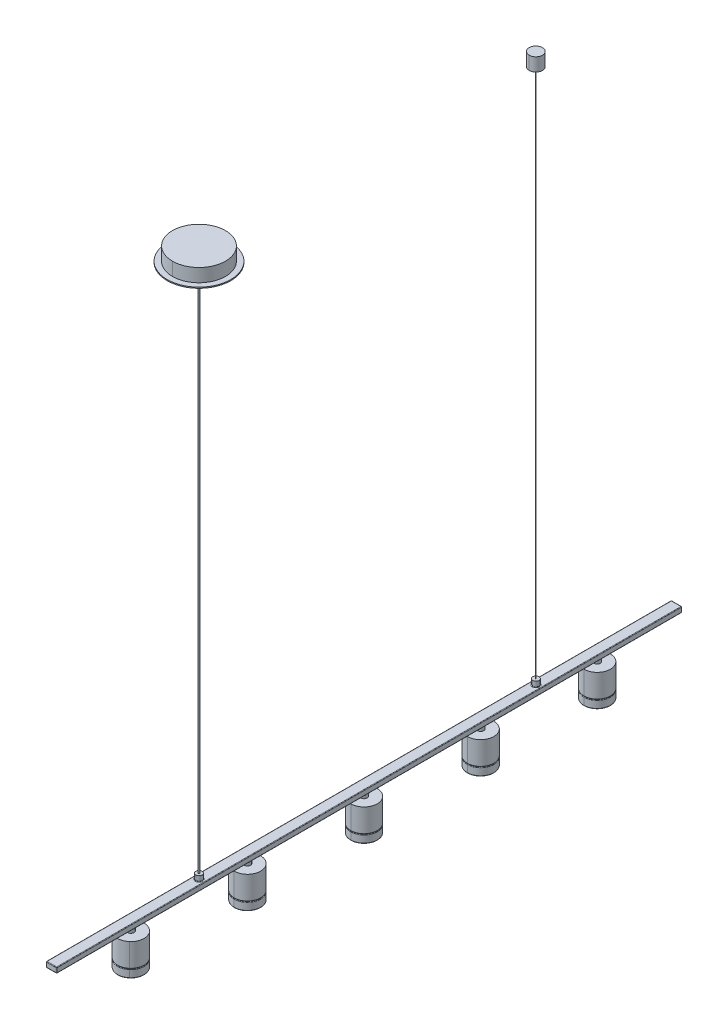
ISO-10303-21;
HEADER;
FILE_DESCRIPTION(('STEP AP214'),'2;1');
FILE_NAME('part.step','',(''),(''),'','','');
FILE_SCHEMA(('AUTOMOTIVE_DESIGN { 1 0 10303 214 1 1 1 1 }'));
ENDSEC;
DATA;
#1=APPLICATION_CONTEXT('core data for automotive mechanical design processes');
#2=APPLICATION_PROTOCOL_DEFINITION('international standard','automotive_design',2000,#1);
#3=PRODUCT_CONTEXT('',#1,'mechanical');
#4=PRODUCT('Part','Part','',(#3));
#5=PRODUCT_RELATED_PRODUCT_CATEGORY('part','',(#4));
#6=PRODUCT_DEFINITION_FORMATION('','',#4);
#7=PRODUCT_DEFINITION_CONTEXT('part definition',#1,'design');
#8=PRODUCT_DEFINITION('design','',#6,#7);
#9=PRODUCT_DEFINITION_SHAPE('','',#8);
#10=(LENGTH_UNIT() NAMED_UNIT(*) SI_UNIT(.MILLI.,.METRE.));
#11=(NAMED_UNIT(*) PLANE_ANGLE_UNIT() SI_UNIT($,.RADIAN.));
#12=(NAMED_UNIT(*) SI_UNIT($,.STERADIAN.) SOLID_ANGLE_UNIT());
#13=UNCERTAINTY_MEASURE_WITH_UNIT(LENGTH_MEASURE(1.E-05),#10,'distance_accuracy_value','');
#14=(GEOMETRIC_REPRESENTATION_CONTEXT(3) GLOBAL_UNCERTAINTY_ASSIGNED_CONTEXT((#13)) GLOBAL_UNIT_ASSIGNED_CONTEXT((#10,
#11,#12)) REPRESENTATION_CONTEXT('',''));
#15=CARTESIAN_POINT('',(0.,0.,0.));
#16=DIRECTION('',(0.,0.,1.));
#17=DIRECTION('',(1.,0.,0.));
#18=AXIS2_PLACEMENT_3D('',#15,#16,#17);
#19=CARTESIAN_POINT('',(-9.048887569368,1044.7749032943,1491.40280877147));
#20=DIRECTION('',(0.,-1.,0.));
#21=DIRECTION('',(0.,0.,-1.));
#22=AXIS2_PLACEMENT_3D('',#19,#20,#21);
#23=CYLINDRICAL_SURFACE('',#22,50.);
#24=CARTESIAN_POINT('',(-9.048887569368,1044.7749032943,1491.40280877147));
#25=DIRECTION('',(0.,1.,0.));
#26=DIRECTION('',(0.,0.,1.));
#27=AXIS2_PLACEMENT_3D('',#24,#25,#26);
#28=CIRCLE('',#27,50.);
#29=CARTESIAN_POINT('',(-9.04888756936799,1044.7749032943,1541.40280877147));
#30=VERTEX_POINT('',#29);
#31=CARTESIAN_POINT('',(-9.048887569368,1044.7749032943,1441.40280877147));
#32=VERTEX_POINT('',#31);
#33=EDGE_CURVE('P0_E42',#30,#32,#28,.T.);
#34=ORIENTED_EDGE('',*,*,#33,.F.);
#35=DIRECTION('',(0.,-1.,0.));
#36=VECTOR('',#35,1.);
#37=CARTESIAN_POINT('',(-9.04888756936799,1044.7749032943,1541.40280877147));
#38=LINE('',#37,#36);
#39=CARTESIAN_POINT('',(-9.04888756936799,1019.7749032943,1541.40280877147));
#40=VERTEX_POINT('',#39);
#41=EDGE_CURVE('P0_E11',#30,#40,#38,.T.);
#42=ORIENTED_EDGE('',*,*,#41,.T.);
#43=CARTESIAN_POINT('',(-9.048887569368,1019.7749032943,1491.40280877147));
#44=DIRECTION('',(0.,1.,0.));
#45=DIRECTION('',(0.,0.,1.));
#46=AXIS2_PLACEMENT_3D('',#43,#44,#45);
#47=CIRCLE('',#46,50.);
#48=CARTESIAN_POINT('',(-9.048887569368,1019.7749032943,1441.40280877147));
#49=VERTEX_POINT('',#48);
#50=EDGE_CURVE('P0_E28',#40,#49,#47,.T.);
#51=ORIENTED_EDGE('',*,*,#50,.T.);
#52=DIRECTION('',(0.,-1.,0.));
#53=VECTOR('',#52,1.);
#54=CARTESIAN_POINT('',(-9.048887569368,1044.7749032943,1441.40280877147));
#55=LINE('',#54,#53);
#56=EDGE_CURVE('P0_E60',#32,#49,#55,.T.);
#57=ORIENTED_EDGE('',*,*,#56,.F.);
#58=EDGE_LOOP('',(#34,#42,#51,#57));
#59=FACE_BOUND('',#58,.T.);
#60=ADVANCED_FACE('P0_F17',(#59),#23,.T.);
#61=CARTESIAN_POINT('',(-9.048887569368,1044.7749032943,1491.40280877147));
#62=DIRECTION('',(0.,-1.,0.));
#63=DIRECTION('',(0.,0.,-1.));
#64=AXIS2_PLACEMENT_3D('',#61,#62,#63);
#65=CYLINDRICAL_SURFACE('',#64,50.);
#66=ORIENTED_EDGE('',*,*,#41,.F.);
#67=CARTESIAN_POINT('',(-9.048887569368,1044.7749032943,1491.40280877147));
#68=DIRECTION('',(0.,1.,0.));
#69=DIRECTION('',(0.,0.,1.));
#70=AXIS2_PLACEMENT_3D('',#67,#68,#69);
#71=CIRCLE('',#70,50.);
#72=EDGE_CURVE('P0_E21',#32,#30,#71,.T.);
#73=ORIENTED_EDGE('',*,*,#72,.F.);
#74=ORIENTED_EDGE('',*,*,#56,.T.);
#75=CARTESIAN_POINT('',(-9.048887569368,1019.7749032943,1491.40280877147));
#76=DIRECTION('',(0.,1.,0.));
#77=DIRECTION('',(0.,0.,1.));
#78=AXIS2_PLACEMENT_3D('',#75,#76,#77);
#79=CIRCLE('',#78,50.);
#80=EDGE_CURVE('P0_E64',#49,#40,#79,.T.);
#81=ORIENTED_EDGE('',*,*,#80,.T.);
#82=EDGE_LOOP('',(#66,#73,#74,#81));
#83=FACE_BOUND('',#82,.T.);
#84=ADVANCED_FACE('P0_F62',(#83),#65,.T.);
#85=CARTESIAN_POINT('',(-9.048887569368,1044.7749032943,1491.40280877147));
#86=DIRECTION('',(0.,1.,0.));
#87=DIRECTION('',(1.,0.,0.));
#88=AXIS2_PLACEMENT_3D('',#85,#86,#87);
#89=PLANE('',#88);
#90=ORIENTED_EDGE('',*,*,#72,.T.);
#91=ORIENTED_EDGE('',*,*,#33,.T.);
#92=EDGE_LOOP('',(#90,#91));
#93=FACE_BOUND('',#92,.T.);
#94=ADVANCED_FACE('P0_F101',(#93),#89,.T.);
#95=CARTESIAN_POINT('',(-9.048887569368,1019.7749032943,1491.40280877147));
#96=DIRECTION('',(0.,1.,0.));
#97=DIRECTION('',(1.,0.,0.));
#98=AXIS2_PLACEMENT_3D('',#95,#96,#97);
#99=PLANE('',#98);
#100=ORIENTED_EDGE('',*,*,#80,.F.);
#101=ORIENTED_EDGE('',*,*,#50,.F.);
#102=EDGE_LOOP('',(#100,#101));
#103=FACE_BOUND('',#102,.T.);
#104=ADVANCED_FACE('P0_F19',(#103),#99,.F.);
#105=CLOSED_SHELL('',(#60,#84,#94,#104));
#106=MANIFOLD_SOLID_BREP('P0_B1',#105);
#107=CARTESIAN_POINT('',(-9.048887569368,1019.7749032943,855.727279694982));
#108=DIRECTION('',(0.,-1.,0.));
#109=DIRECTION('',(0.,0.,-1.));
#110=AXIS2_PLACEMENT_3D('',#107,#108,#109);
#111=CYLINDRICAL_SURFACE('',#110,0.5);
#112=CARTESIAN_POINT('',(-9.048887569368,1019.7749032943,855.727279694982));
#113=DIRECTION('',(0.,1.,0.));
#114=DIRECTION('',(0.,0.,1.));
#115=AXIS2_PLACEMENT_3D('',#112,#113,#114);
#116=CIRCLE('',#115,0.5);
#117=CARTESIAN_POINT('',(-9.048887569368,1019.7749032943,856.227279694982));
#118=VERTEX_POINT('',#117);
#119=CARTESIAN_POINT('',(-9.048887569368,1019.7749032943,855.227279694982));
#120=VERTEX_POINT('',#119);
#121=EDGE_CURVE('P1_E41',#118,#120,#116,.T.);
#122=ORIENTED_EDGE('',*,*,#121,.F.);
#123=DIRECTION('',(0.,-1.,0.));
#124=VECTOR('',#123,1.);
#125=CARTESIAN_POINT('',(-9.048887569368,1019.7749032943,856.227279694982));
#126=LINE('',#125,#124);
#127=CARTESIAN_POINT('',(-9.048887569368,19.774903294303,856.227279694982));
#128=VERTEX_POINT('',#127);
#129=EDGE_CURVE('P1_E11',#118,#128,#126,.T.);
#130=ORIENTED_EDGE('',*,*,#129,.T.);
#131=CARTESIAN_POINT('',(-9.048887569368,19.774903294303,855.727279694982));
#132=DIRECTION('',(0.,1.,0.));
#133=DIRECTION('',(0.,0.,1.));
#134=AXIS2_PLACEMENT_3D('',#131,#132,#133);
#135=CIRCLE('',#134,0.5);
#136=CARTESIAN_POINT('',(-9.048887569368,19.774903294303,855.227279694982));
#137=VERTEX_POINT('',#136);
#138=EDGE_CURVE('P1_E28',#128,#137,#135,.T.);
#139=ORIENTED_EDGE('',*,*,#138,.T.);
#140=DIRECTION('',(0.,-1.,0.));
#141=VECTOR('',#140,1.);
#142=CARTESIAN_POINT('',(-9.048887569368,1019.7749032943,855.227279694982));
#143=LINE('',#142,#141);
#144=EDGE_CURVE('P1_E21',#120,#137,#143,.T.);
#145=ORIENTED_EDGE('',*,*,#144,.F.);
#146=EDGE_LOOP('',(#122,#130,#139,#145));
#147=FACE_BOUND('',#146,.T.);
#148=ADVANCED_FACE('P1_F17',(#147),#111,.T.);
#149=CARTESIAN_POINT('',(-9.048887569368,1019.7749032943,855.727279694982));
#150=DIRECTION('',(0.,-1.,0.));
#151=DIRECTION('',(0.,0.,-1.));
#152=AXIS2_PLACEMENT_3D('',#149,#150,#151);
#153=CYLINDRICAL_SURFACE('',#152,0.5);
#154=ORIENTED_EDGE('',*,*,#129,.F.);
#155=CARTESIAN_POINT('',(-9.048887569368,1019.7749032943,855.727279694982));
#156=DIRECTION('',(0.,1.,0.));
#157=DIRECTION('',(0.,0.,1.));
#158=AXIS2_PLACEMENT_3D('',#155,#156,#157);
#159=CIRCLE('',#158,0.5);
#160=EDGE_CURVE('P1_E64',#120,#118,#159,.T.);
#161=ORIENTED_EDGE('',*,*,#160,.F.);
#162=ORIENTED_EDGE('',*,*,#144,.T.);
#163=CARTESIAN_POINT('',(-9.048887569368,19.774903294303,855.727279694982));
#164=DIRECTION('',(0.,1.,0.));
#165=DIRECTION('',(0.,0.,1.));
#166=AXIS2_PLACEMENT_3D('',#163,#164,#165);
#167=CIRCLE('',#166,0.5);
#168=EDGE_CURVE('P1_E63',#137,#128,#167,.T.);
#169=ORIENTED_EDGE('',*,*,#168,.T.);
#170=EDGE_LOOP('',(#154,#161,#162,#169));
#171=FACE_BOUND('',#170,.T.);
#172=ADVANCED_FACE('P1_F61',(#171),#153,.T.);
#173=CARTESIAN_POINT('',(-9.048887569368,1019.7749032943,855.727279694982));
#174=DIRECTION('',(0.,1.,0.));
#175=DIRECTION('',(1.,0.,0.));
#176=AXIS2_PLACEMENT_3D('',#173,#174,#175);
#177=PLANE('',#176);
#178=ORIENTED_EDGE('',*,*,#160,.T.);
#179=ORIENTED_EDGE('',*,*,#121,.T.);
#180=EDGE_LOOP('',(#178,#179));
#181=FACE_BOUND('',#180,.T.);
#182=ADVANCED_FACE('P1_F116',(#181),#177,.T.);
#183=CARTESIAN_POINT('',(-9.048887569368,19.774903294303,855.727279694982));
#184=DIRECTION('',(0.,1.,0.));
#185=DIRECTION('',(1.,0.,0.));
#186=AXIS2_PLACEMENT_3D('',#183,#184,#185);
#187=PLANE('',#186);
#188=ORIENTED_EDGE('',*,*,#168,.F.);
#189=ORIENTED_EDGE('',*,*,#138,.F.);
#190=EDGE_LOOP('',(#188,#189));
#191=FACE_BOUND('',#190,.T.);
#192=ADVANCED_FACE('P1_F19',(#191),#187,.F.);
#193=CLOSED_SHELL('',(#148,#172,#182,#192));
#194=MANIFOLD_SOLID_BREP('P1_B1',#193);
#195=CARTESIAN_POINT('',(-9.048887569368,1019.7749032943,1491.40280877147));
#196=DIRECTION('',(0.,-1.,0.));
#197=DIRECTION('',(0.,0.,-1.));
#198=AXIS2_PLACEMENT_3D('',#195,#196,#197);
#199=CYLINDRICAL_SURFACE('',#198,1.49999999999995);
#200=CARTESIAN_POINT('',(-9.048887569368,1019.7749032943,1491.40280877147));
#201=DIRECTION('',(0.,1.,0.));
#202=DIRECTION('',(0.,0.,1.));
#203=AXIS2_PLACEMENT_3D('',#200,#201,#202);
#204=CIRCLE('',#203,1.49999999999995);
#205=CARTESIAN_POINT('',(-9.048887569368,1019.7749032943,1492.90280877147));
#206=VERTEX_POINT('',#205);
#207=CARTESIAN_POINT('',(-9.048887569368,1019.7749032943,1489.90280877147));
#208=VERTEX_POINT('',#207);
#209=EDGE_CURVE('P2_E38',#206,#208,#204,.T.);
#210=ORIENTED_EDGE('',*,*,#209,.F.);
#211=DIRECTION('',(0.,-1.,0.));
#212=VECTOR('',#211,1.);
#213=CARTESIAN_POINT('',(-9.048887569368,1019.7749032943,1492.90280877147));
#214=LINE('',#213,#212);
#215=CARTESIAN_POINT('',(-9.048887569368,19.774903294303,1492.90280877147));
#216=VERTEX_POINT('',#215);
#217=EDGE_CURVE('P2_E11',#206,#216,#214,.T.);
#218=ORIENTED_EDGE('',*,*,#217,.T.);
#219=CARTESIAN_POINT('',(-9.048887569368,19.774903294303,1491.40280877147));
#220=DIRECTION('',(0.,1.,0.));
#221=DIRECTION('',(0.,0.,1.));
#222=AXIS2_PLACEMENT_3D('',#219,#220,#221);
#223=CIRCLE('',#222,1.49999999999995);
#224=CARTESIAN_POINT('',(-9.048887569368,19.774903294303,1489.90280877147));
#225=VERTEX_POINT('',#224);
#226=EDGE_CURVE('P2_E26',#216,#225,#223,.T.);
#227=ORIENTED_EDGE('',*,*,#226,.T.);
#228=DIRECTION('',(0.,-1.,0.));
#229=VECTOR('',#228,1.);
#230=CARTESIAN_POINT('',(-9.048887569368,1019.7749032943,1489.90280877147));
#231=LINE('',#230,#229);
#232=EDGE_CURVE('P2_E63',#208,#225,#231,.T.);
#233=ORIENTED_EDGE('',*,*,#232,.F.);
#234=EDGE_LOOP('',(#210,#218,#227,#233));
#235=FACE_BOUND('',#234,.T.);
#236=ADVANCED_FACE('P2_F17',(#235),#199,.T.);
#237=CARTESIAN_POINT('',(-9.048887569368,1019.7749032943,1491.40280877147));
#238=DIRECTION('',(0.,-1.,0.));
#239=DIRECTION('',(0.,0.,-1.));
#240=AXIS2_PLACEMENT_3D('',#237,#238,#239);
#241=CYLINDRICAL_SURFACE('',#240,1.49999999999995);
#242=ORIENTED_EDGE('',*,*,#217,.F.);
#243=CARTESIAN_POINT('',(-9.048887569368,1019.7749032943,1491.40280877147));
#244=DIRECTION('',(0.,1.,0.));
#245=DIRECTION('',(0.,0.,1.));
#246=AXIS2_PLACEMENT_3D('',#243,#244,#245);
#247=CIRCLE('',#246,1.49999999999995);
#248=EDGE_CURVE('P2_E60',#208,#206,#247,.T.);
#249=ORIENTED_EDGE('',*,*,#248,.F.);
#250=ORIENTED_EDGE('',*,*,#232,.T.);
#251=CARTESIAN_POINT('',(-9.048887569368,19.774903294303,1491.40280877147));
#252=DIRECTION('',(0.,1.,0.));
#253=DIRECTION('',(0.,0.,1.));
#254=AXIS2_PLACEMENT_3D('',#251,#252,#253);
#255=CIRCLE('',#254,1.49999999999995);
#256=EDGE_CURVE('P2_E67',#225,#216,#255,.T.);
#257=ORIENTED_EDGE('',*,*,#256,.T.);
#258=EDGE_LOOP('',(#242,#249,#250,#257));
#259=FACE_BOUND('',#258,.T.);
#260=ADVANCED_FACE('P2_F68',(#259),#241,.T.);
#261=CARTESIAN_POINT('',(-9.048887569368,1019.7749032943,1491.40280877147));
#262=DIRECTION('',(0.,1.,0.));
#263=DIRECTION('',(1.,0.,0.));
#264=AXIS2_PLACEMENT_3D('',#261,#262,#263);
#265=PLANE('',#264);
#266=ORIENTED_EDGE('',*,*,#248,.T.);
#267=ORIENTED_EDGE('',*,*,#209,.T.);
#268=EDGE_LOOP('',(#266,#267));
#269=FACE_BOUND('',#268,.T.);
#270=ADVANCED_FACE('P2_F58',(#269),#265,.T.);
#271=CARTESIAN_POINT('',(-9.048887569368,19.774903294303,1491.40280877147));
#272=DIRECTION('',(0.,1.,0.));
#273=DIRECTION('',(1.,0.,0.));
#274=AXIS2_PLACEMENT_3D('',#271,#272,#273);
#275=PLANE('',#274);
#276=ORIENTED_EDGE('',*,*,#256,.F.);
#277=ORIENTED_EDGE('',*,*,#226,.F.);
#278=EDGE_LOOP('',(#276,#277));
#279=FACE_BOUND('',#278,.T.);
#280=ADVANCED_FACE('P2_F19',(#279),#275,.F.);
#281=CLOSED_SHELL('',(#236,#260,#270,#280));
#282=MANIFOLD_SOLID_BREP('P2_B1',#281);
#283=CARTESIAN_POINT('',(-9.048887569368,10.774903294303,1491.40280877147));
#284=DIRECTION('',(0.,-1.,0.));
#285=DIRECTION('',(0.,0.,-1.));
#286=AXIS2_PLACEMENT_3D('',#283,#284,#285);
#287=TOROIDAL_SURFACE('',#286,7.,1.);
#288=CARTESIAN_POINT('',(-9.048887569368,9.774903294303,1491.40280877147));
#289=DIRECTION('',(0.,-1.,0.));
#290=DIRECTION('',(0.,0.,-1.));
#291=AXIS2_PLACEMENT_3D('',#288,#289,#290);
#292=CIRCLE('',#291,7.);
#293=CARTESIAN_POINT('',(-9.048887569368,9.774903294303,1498.40280877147));
#294=VERTEX_POINT('',#293);
#295=CARTESIAN_POINT('',(-9.048887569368,9.774903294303,1484.40280877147));
#296=VERTEX_POINT('',#295);
#297=EDGE_CURVE('P3_E42',#294,#296,#292,.T.);
#298=ORIENTED_EDGE('',*,*,#297,.F.);
#299=CARTESIAN_POINT('',(-9.048887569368,10.774903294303,1498.40280877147));
#300=DIRECTION('',(1.,0.,0.));
#301=DIRECTION('',(0.,0.,-1.));
#302=AXIS2_PLACEMENT_3D('',#299,#300,#301);
#303=CIRCLE('',#302,1.);
#304=CARTESIAN_POINT('',(-9.048887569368,10.774903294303,1497.40280877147));
#305=VERTEX_POINT('',#304);
#306=EDGE_CURVE('P3_E11',#294,#305,#303,.T.);
#307=ORIENTED_EDGE('',*,*,#306,.T.);
#308=CARTESIAN_POINT('',(-9.048887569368,10.774903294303,1491.40280877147));
#309=DIRECTION('',(0.,1.,0.));
#310=DIRECTION('',(0.,0.,-1.));
#311=AXIS2_PLACEMENT_3D('',#308,#309,#310);
#312=CIRCLE('',#311,6.);
#313=CARTESIAN_POINT('',(-9.048887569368,10.774903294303,1485.40280877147));
#314=VERTEX_POINT('',#313);
#315=EDGE_CURVE('P3_E243',#314,#305,#312,.T.);
#316=ORIENTED_EDGE('',*,*,#315,.F.);
#317=CARTESIAN_POINT('',(-9.048887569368,10.774903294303,1484.40280877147));
#318=DIRECTION('',(-1.,0.,0.));
#319=DIRECTION('',(0.,0.,1.));
#320=AXIS2_PLACEMENT_3D('',#317,#318,#319);
#321=CIRCLE('',#320,1.);
#322=EDGE_CURVE('P3_E310',#296,#314,#321,.T.);
#323=ORIENTED_EDGE('',*,*,#322,.F.);
#324=EDGE_LOOP('',(#298,#307,#316,#323));
#325=FACE_BOUND('',#324,.T.);
#326=ADVANCED_FACE('P3_F17',(#325),#287,.F.);
#327=CARTESIAN_POINT('',(-9.048887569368,10.774903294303,855.727279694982));
#328=DIRECTION('',(0.,-1.,0.));
#329=DIRECTION('',(0.,0.,-1.));
#330=AXIS2_PLACEMENT_3D('',#327,#328,#329);
#331=TOROIDAL_SURFACE('',#330,7.,1.);
#332=CARTESIAN_POINT('',(-9.048887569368,9.774903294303,855.727279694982));
#333=DIRECTION('',(0.,-1.,0.));
#334=DIRECTION('',(0.,0.,-1.));
#335=AXIS2_PLACEMENT_3D('',#332,#333,#334);
#336=CIRCLE('',#335,7.);
#337=CARTESIAN_POINT('',(-9.048887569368,9.774903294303,862.727279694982));
#338=VERTEX_POINT('',#337);
#339=CARTESIAN_POINT('',(-9.048887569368,9.774903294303,848.727279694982));
#340=VERTEX_POINT('',#339);
#341=EDGE_CURVE('P3_E378',#338,#340,#336,.T.);
#342=ORIENTED_EDGE('',*,*,#341,.F.);
#343=CARTESIAN_POINT('',(-9.048887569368,10.774903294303,862.727279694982));
#344=DIRECTION('',(1.,0.,0.));
#345=DIRECTION('',(0.,0.,-1.));
#346=AXIS2_PLACEMENT_3D('',#343,#344,#345);
#347=CIRCLE('',#346,1.);
#348=CARTESIAN_POINT('',(-9.048887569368,10.774903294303,861.727279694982));
#349=VERTEX_POINT('',#348);
#350=EDGE_CURVE('P3_E28',#338,#349,#347,.T.);
#351=ORIENTED_EDGE('',*,*,#350,.T.);
#352=CARTESIAN_POINT('',(-9.048887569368,10.774903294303,855.727279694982));
#353=DIRECTION('',(0.,1.,0.));
#354=DIRECTION('',(0.,0.,-1.));
#355=AXIS2_PLACEMENT_3D('',#352,#353,#354);
#356=CIRCLE('',#355,6.);
#357=CARTESIAN_POINT('',(-9.048887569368,10.774903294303,849.727279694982));
#358=VERTEX_POINT('',#357);
#359=EDGE_CURVE('P3_E245',#358,#349,#356,.T.);
#360=ORIENTED_EDGE('',*,*,#359,.F.);
#361=CARTESIAN_POINT('',(-9.048887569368,10.774903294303,848.727279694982));
#362=DIRECTION('',(-1.,0.,0.));
#363=DIRECTION('',(0.,0.,1.));
#364=AXIS2_PLACEMENT_3D('',#361,#362,#363);
#365=CIRCLE('',#364,1.);
#366=EDGE_CURVE('P3_E307',#340,#358,#365,.T.);
#367=ORIENTED_EDGE('',*,*,#366,.F.);
#368=EDGE_LOOP('',(#342,#351,#360,#367));
#369=FACE_BOUND('',#368,.T.);
#370=ADVANCED_FACE('P3_F881',(#369),#331,.F.);
#371=CARTESIAN_POINT('',(-9.048887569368,19.774903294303,1491.40280877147));
#372=DIRECTION('',(0.,-1.,0.));
#373=DIRECTION('',(0.,0.,-1.));
#374=AXIS2_PLACEMENT_3D('',#371,#372,#373);
#375=CYLINDRICAL_SURFACE('',#374,6.);
#376=CARTESIAN_POINT('',(-9.048887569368,19.774903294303,1491.40280877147));
#377=DIRECTION('',(0.,1.,0.));
#378=DIRECTION('',(0.,0.,1.));
#379=AXIS2_PLACEMENT_3D('',#376,#377,#378);
#380=CIRCLE('',#379,6.);
#381=CARTESIAN_POINT('',(-9.048887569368,19.774903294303,1497.40280877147));
#382=VERTEX_POINT('',#381);
#383=CARTESIAN_POINT('',(-9.048887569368,19.774903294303,1485.40280877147));
#384=VERTEX_POINT('',#383);
#385=EDGE_CURVE('P3_E244',#382,#384,#380,.T.);
#386=ORIENTED_EDGE('',*,*,#385,.F.);
#387=DIRECTION('',(0.,-1.,0.));
#388=VECTOR('',#387,1.);
#389=CARTESIAN_POINT('',(-9.048887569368,19.774903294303,1497.40280877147));
#390=LINE('',#389,#388);
#391=EDGE_CURVE('P3_E263',#382,#305,#390,.T.);
#392=ORIENTED_EDGE('',*,*,#391,.T.);
#393=CARTESIAN_POINT('',(-9.048887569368,10.774903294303,1491.40280877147));
#394=DIRECTION('',(0.,1.,0.));
#395=DIRECTION('',(0.,0.,-1.));
#396=AXIS2_PLACEMENT_3D('',#393,#394,#395);
#397=CIRCLE('',#396,6.);
#398=EDGE_CURVE('P3_E259',#305,#314,#397,.T.);
#399=ORIENTED_EDGE('',*,*,#398,.T.);
#400=DIRECTION('',(0.,-1.,0.));
#401=VECTOR('',#400,1.);
#402=CARTESIAN_POINT('',(-9.048887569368,19.774903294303,1485.40280877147));
#403=LINE('',#402,#401);
#404=EDGE_CURVE('P3_E269',#384,#314,#403,.T.);
#405=ORIENTED_EDGE('',*,*,#404,.F.);
#406=EDGE_LOOP('',(#386,#392,#399,#405));
#407=FACE_BOUND('',#406,.T.);
#408=ADVANCED_FACE('P3_F817',(#407),#375,.T.);
#409=CARTESIAN_POINT('',(-9.048887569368,19.774903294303,855.727279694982));
#410=DIRECTION('',(0.,-1.,0.));
#411=DIRECTION('',(0.,0.,-1.));
#412=AXIS2_PLACEMENT_3D('',#409,#410,#411);
#413=CYLINDRICAL_SURFACE('',#412,6.);
#414=CARTESIAN_POINT('',(-9.048887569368,19.774903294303,855.727279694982));
#415=DIRECTION('',(0.,1.,0.));
#416=DIRECTION('',(0.,0.,1.));
#417=AXIS2_PLACEMENT_3D('',#414,#415,#416);
#418=CIRCLE('',#417,6.);
#419=CARTESIAN_POINT('',(-9.048887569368,19.774903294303,861.727279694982));
#420=VERTEX_POINT('',#419);
#421=CARTESIAN_POINT('',(-9.048887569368,19.774903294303,849.727279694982));
#422=VERTEX_POINT('',#421);
#423=EDGE_CURVE('P3_E273',#420,#422,#418,.T.);
#424=ORIENTED_EDGE('',*,*,#423,.F.);
#425=DIRECTION('',(0.,-1.,0.));
#426=VECTOR('',#425,1.);
#427=CARTESIAN_POINT('',(-9.048887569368,19.774903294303,861.727279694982));
#428=LINE('',#427,#426);
#429=EDGE_CURVE('P3_E264',#420,#349,#428,.T.);
#430=ORIENTED_EDGE('',*,*,#429,.T.);
#431=CARTESIAN_POINT('',(-9.048887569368,10.774903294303,855.727279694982));
#432=DIRECTION('',(0.,1.,0.));
#433=DIRECTION('',(0.,0.,-1.));
#434=AXIS2_PLACEMENT_3D('',#431,#432,#433);
#435=CIRCLE('',#434,6.);
#436=EDGE_CURVE('P3_E330',#349,#358,#435,.T.);
#437=ORIENTED_EDGE('',*,*,#436,.T.);
#438=DIRECTION('',(0.,-1.,0.));
#439=VECTOR('',#438,1.);
#440=CARTESIAN_POINT('',(-9.048887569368,19.774903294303,849.727279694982));
#441=LINE('',#440,#439);
#442=EDGE_CURVE('P3_E248',#422,#358,#441,.T.);
#443=ORIENTED_EDGE('',*,*,#442,.F.);
#444=EDGE_LOOP('',(#424,#430,#437,#443));
#445=FACE_BOUND('',#444,.T.);
#446=ADVANCED_FACE('P3_F813',(#445),#413,.T.);
#447=CARTESIAN_POINT('',(0.951112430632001,9.774903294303,1770.));
#448=DIRECTION('',(-1.,0.,0.));
#449=DIRECTION('',(0.,0.,1.));
#450=AXIS2_PLACEMENT_3D('',#447,#448,#449);
#451=PLANE('',#450);
#452=DIRECTION('',(0.,1.,0.));
#453=VECTOR('',#452,1.);
#454=CARTESIAN_POINT('',(0.951112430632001,9.774903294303,591.));
#455=LINE('',#454,#453);
#456=CARTESIAN_POINT('',(0.951112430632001,0.774903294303,591.));
#457=VERTEX_POINT('',#456);
#458=CARTESIAN_POINT('',(0.951112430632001,8.774903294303,591.));
#459=VERTEX_POINT('',#458);
#460=EDGE_CURVE('P3_E334',#457,#459,#455,.T.);
#461=ORIENTED_EDGE('',*,*,#460,.T.);
#462=DIRECTION('',(0.,0.,1.));
#463=VECTOR('',#462,1.);
#464=CARTESIAN_POINT('',(0.951112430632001,8.774903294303,1770.));
#465=LINE('',#464,#463);
#466=CARTESIAN_POINT('',(0.951112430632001,8.774903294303,1769.));
#467=VERTEX_POINT('',#466);
#468=EDGE_CURVE('P3_E343',#459,#467,#465,.T.);
#469=ORIENTED_EDGE('',*,*,#468,.T.);
#470=DIRECTION('',(0.,-1.,0.));
#471=VECTOR('',#470,1.);
#472=CARTESIAN_POINT('',(0.951112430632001,-0.225096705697,1769.));
#473=LINE('',#472,#471);
#474=CARTESIAN_POINT('',(0.951112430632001,0.774903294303,1769.));
#475=VERTEX_POINT('',#474);
#476=EDGE_CURVE('P3_E347',#467,#475,#473,.T.);
#477=ORIENTED_EDGE('',*,*,#476,.T.);
#478=DIRECTION('',(0.,0.,-1.));
#479=VECTOR('',#478,1.);
#480=CARTESIAN_POINT('',(0.951112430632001,0.774903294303,1770.));
#481=LINE('',#480,#479);
#482=EDGE_CURVE('P3_E404',#475,#457,#481,.T.);
#483=ORIENTED_EDGE('',*,*,#482,.T.);
#484=EDGE_LOOP('',(#461,#469,#477,#483));
#485=FACE_BOUND('',#484,.T.);
#486=ADVANCED_FACE('P3_F464',(#485),#451,.F.);
#487=CARTESIAN_POINT('',(-19.048887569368,9.774903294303,1770.));
#488=DIRECTION('',(0.,-1.,0.));
#489=DIRECTION('',(0.,0.,-1.));
#490=AXIS2_PLACEMENT_3D('',#487,#488,#489);
#491=PLANE('',#490);
#492=DIRECTION('',(0.,0.,-1.));
#493=VECTOR('',#492,1.);
#494=CARTESIAN_POINT('',(-0.0488875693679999,9.774903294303,1770.));
#495=LINE('',#494,#493);
#496=CARTESIAN_POINT('',(-0.0488875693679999,9.774903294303,1769.));
#497=VERTEX_POINT('',#496);
#498=CARTESIAN_POINT('',(-0.0488875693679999,9.774903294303,591.));
#499=VERTEX_POINT('',#498);
#500=EDGE_CURVE('P3_E387',#497,#499,#495,.T.);
#501=ORIENTED_EDGE('',*,*,#500,.T.);
#502=DIRECTION('',(-1.,0.,0.));
#503=VECTOR('',#502,1.);
#504=CARTESIAN_POINT('',(-19.048887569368,9.774903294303,591.));
#505=LINE('',#504,#503);
#506=CARTESIAN_POINT('',(-18.048887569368,9.774903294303,591.));
#507=VERTEX_POINT('',#506);
#508=EDGE_CURVE('P3_E354',#499,#507,#505,.T.);
#509=ORIENTED_EDGE('',*,*,#508,.T.);
#510=DIRECTION('',(0.,0.,1.));
#511=VECTOR('',#510,1.);
#512=CARTESIAN_POINT('',(-18.048887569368,9.774903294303,1770.));
#513=LINE('',#512,#511);
#514=CARTESIAN_POINT('',(-18.048887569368,9.774903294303,1769.));
#515=VERTEX_POINT('',#514);
#516=EDGE_CURVE('P3_E350',#507,#515,#513,.T.);
#517=ORIENTED_EDGE('',*,*,#516,.T.);
#518=DIRECTION('',(1.,0.,0.));
#519=VECTOR('',#518,1.);
#520=CARTESIAN_POINT('',(0.951112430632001,9.774903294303,1769.));
#521=LINE('',#520,#519);
#522=EDGE_CURVE('P3_E355',#515,#497,#521,.T.);
#523=ORIENTED_EDGE('',*,*,#522,.T.);
#524=EDGE_LOOP('',(#501,#509,#517,#523));
#525=FACE_BOUND('',#524,.T.);
#526=CARTESIAN_POINT('',(-9.048887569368,9.774903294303,855.727279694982));
#527=DIRECTION('',(0.,-1.,0.));
#528=DIRECTION('',(0.,0.,-1.));
#529=AXIS2_PLACEMENT_3D('',#526,#527,#528);
#530=CIRCLE('',#529,7.);
#531=EDGE_CURVE('P3_E397',#340,#338,#530,.T.);
#532=ORIENTED_EDGE('',*,*,#531,.T.);
#533=ORIENTED_EDGE('',*,*,#341,.T.);
#534=EDGE_LOOP('',(#532,#533));
#535=FACE_BOUND('',#534,.T.);
#536=CARTESIAN_POINT('',(-9.048887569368,9.774903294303,1491.40280877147));
#537=DIRECTION('',(0.,-1.,0.));
#538=DIRECTION('',(0.,0.,-1.));
#539=AXIS2_PLACEMENT_3D('',#536,#537,#538);
#540=CIRCLE('',#539,7.);
#541=EDGE_CURVE('P3_E374',#296,#294,#540,.T.);
#542=ORIENTED_EDGE('',*,*,#541,.T.);
#543=ORIENTED_EDGE('',*,*,#297,.T.);
#544=EDGE_LOOP('',(#542,#543));
#545=FACE_BOUND('',#544,.T.);
#546=ADVANCED_FACE('P3_F446',(#525,#535,#545),#491,.F.);
#547=CARTESIAN_POINT('',(-19.048887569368,9.774903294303,1770.));
#548=DIRECTION('',(1.,0.,0.));
#549=DIRECTION('',(0.,1.,0.));
#550=AXIS2_PLACEMENT_3D('',#547,#548,#549);
#551=PLANE('',#550);
#552=DIRECTION('',(0.,-1.,0.));
#553=VECTOR('',#552,1.);
#554=CARTESIAN_POINT('',(-19.048887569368,9.774903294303,591.));
#555=LINE('',#554,#553);
#556=CARTESIAN_POINT('',(-19.048887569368,8.774903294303,591.));
#557=VERTEX_POINT('',#556);
#558=CARTESIAN_POINT('',(-19.048887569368,0.774903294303,591.));
#559=VERTEX_POINT('',#558);
#560=EDGE_CURVE('P3_E286',#557,#559,#555,.T.);
#561=ORIENTED_EDGE('',*,*,#560,.T.);
#562=DIRECTION('',(0.,0.,1.));
#563=VECTOR('',#562,1.);
#564=CARTESIAN_POINT('',(-19.048887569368,0.774903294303,1770.));
#565=LINE('',#564,#563);
#566=CARTESIAN_POINT('',(-19.048887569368,0.774903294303,1769.));
#567=VERTEX_POINT('',#566);
#568=EDGE_CURVE('P3_E282',#559,#567,#565,.T.);
#569=ORIENTED_EDGE('',*,*,#568,.T.);
#570=DIRECTION('',(0.,1.,0.));
#571=VECTOR('',#570,1.);
#572=CARTESIAN_POINT('',(-19.048887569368,9.774903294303,1769.));
#573=LINE('',#572,#571);
#574=CARTESIAN_POINT('',(-19.048887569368,8.774903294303,1769.));
#575=VERTEX_POINT('',#574);
#576=EDGE_CURVE('P3_E287',#567,#575,#573,.T.);
#577=ORIENTED_EDGE('',*,*,#576,.T.);
#578=DIRECTION('',(0.,0.,-1.));
#579=VECTOR('',#578,1.);
#580=CARTESIAN_POINT('',(-19.048887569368,8.774903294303,1770.));
#581=LINE('',#580,#579);
#582=EDGE_CURVE('P3_E219',#575,#557,#581,.T.);
#583=ORIENTED_EDGE('',*,*,#582,.T.);
#584=EDGE_LOOP('',(#561,#569,#577,#583));
#585=FACE_BOUND('',#584,.T.);
#586=ADVANCED_FACE('P3_F826',(#585),#551,.F.);
#587=CARTESIAN_POINT('',(-19.048887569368,-0.225096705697,1770.));
#588=DIRECTION('',(0.,1.,0.));
#589=DIRECTION('',(1.,0.,0.));
#590=AXIS2_PLACEMENT_3D('',#587,#588,#589);
#591=PLANE('',#590);
#592=DIRECTION('',(1.,0.,0.));
#593=VECTOR('',#592,1.);
#594=CARTESIAN_POINT('',(-19.048887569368,-0.225096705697,591.));
#595=LINE('',#594,#593);
#596=CARTESIAN_POINT('',(-18.048887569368,-0.225096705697,591.));
#597=VERTEX_POINT('',#596);
#598=CARTESIAN_POINT('',(-0.0488875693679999,-0.225096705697,591.));
#599=VERTEX_POINT('',#598);
#600=EDGE_CURVE('P3_E208',#597,#599,#595,.T.);
#601=ORIENTED_EDGE('',*,*,#600,.T.);
#602=DIRECTION('',(0.,0.,1.));
#603=VECTOR('',#602,1.);
#604=CARTESIAN_POINT('',(-0.0488875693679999,-0.225096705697,1770.));
#605=LINE('',#604,#603);
#606=CARTESIAN_POINT('',(-0.0488875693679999,-0.225096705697,1769.));
#607=VERTEX_POINT('',#606);
#608=EDGE_CURVE('P3_E201',#599,#607,#605,.T.);
#609=ORIENTED_EDGE('',*,*,#608,.T.);
#610=DIRECTION('',(-1.,0.,0.));
#611=VECTOR('',#610,1.);
#612=CARTESIAN_POINT('',(-19.048887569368,-0.225096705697,1769.));
#613=LINE('',#612,#611);
#614=CARTESIAN_POINT('',(-18.048887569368,-0.225096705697,1769.));
#615=VERTEX_POINT('',#614);
#616=EDGE_CURVE('P3_E209',#607,#615,#613,.T.);
#617=ORIENTED_EDGE('',*,*,#616,.T.);
#618=DIRECTION('',(0.,0.,-1.));
#619=VECTOR('',#618,1.);
#620=CARTESIAN_POINT('',(-18.048887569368,-0.225096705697,1770.));
#621=LINE('',#620,#619);
#622=EDGE_CURVE('P3_E215',#615,#597,#621,.T.);
#623=ORIENTED_EDGE('',*,*,#622,.T.);
#624=EDGE_LOOP('',(#601,#609,#617,#623));
#625=FACE_BOUND('',#624,.T.);
#626=ADVANCED_FACE('P3_F213',(#625),#591,.F.);
#627=CARTESIAN_POINT('',(-9.048887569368,4.774903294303,1770.));
#628=DIRECTION('',(0.,0.,1.));
#629=DIRECTION('',(1.,0.,0.));
#630=AXIS2_PLACEMENT_3D('',#627,#628,#629);
#631=PLANE('',#630);
#632=DIRECTION('',(0.,-1.,0.));
#633=VECTOR('',#632,1.);
#634=CARTESIAN_POINT('',(-18.048887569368,-0.225096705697,1770.));
#635=LINE('',#634,#633);
#636=CARTESIAN_POINT('',(-18.048887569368,8.774903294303,1770.));
#637=VERTEX_POINT('',#636);
#638=CARTESIAN_POINT('',(-18.048887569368,0.774903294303,1770.));
#639=VERTEX_POINT('',#638);
#640=EDGE_CURVE('P3_E367',#637,#639,#635,.T.);
#641=ORIENTED_EDGE('',*,*,#640,.T.);
#642=DIRECTION('',(1.,0.,0.));
#643=VECTOR('',#642,1.);
#644=CARTESIAN_POINT('',(0.951112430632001,0.774903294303,1770.));
#645=LINE('',#644,#643);
#646=CARTESIAN_POINT('',(-0.0488875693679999,0.774903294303,1770.));
#647=VERTEX_POINT('',#646);
#648=EDGE_CURVE('P3_E297',#639,#647,#645,.T.);
#649=ORIENTED_EDGE('',*,*,#648,.T.);
#650=DIRECTION('',(0.,1.,0.));
#651=VECTOR('',#650,1.);
#652=CARTESIAN_POINT('',(-0.0488875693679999,9.774903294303,1770.));
#653=LINE('',#652,#651);
#654=CARTESIAN_POINT('',(-0.0488875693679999,8.774903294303,1770.));
#655=VERTEX_POINT('',#654);
#656=EDGE_CURVE('P3_E291',#647,#655,#653,.T.);
#657=ORIENTED_EDGE('',*,*,#656,.T.);
#658=DIRECTION('',(-1.,0.,0.));
#659=VECTOR('',#658,1.);
#660=CARTESIAN_POINT('',(-19.048887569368,8.774903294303,1770.));
#661=LINE('',#660,#659);
#662=EDGE_CURVE('P3_E254',#655,#637,#661,.T.);
#663=ORIENTED_EDGE('',*,*,#662,.T.);
#664=EDGE_LOOP('',(#641,#649,#657,#663));
#665=FACE_BOUND('',#664,.T.);
#666=ADVANCED_FACE('P3_F746',(#665),#631,.T.);
#667=CARTESIAN_POINT('',(-9.048887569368,4.774903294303,590.));
#668=DIRECTION('',(0.,0.,1.));
#669=DIRECTION('',(1.,0.,0.));
#670=AXIS2_PLACEMENT_3D('',#667,#668,#669);
#671=PLANE('',#670);
#672=DIRECTION('',(0.,1.,0.));
#673=VECTOR('',#672,1.);
#674=CARTESIAN_POINT('',(-18.048887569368,4.774903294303,590.));
#675=LINE('',#674,#673);
#676=CARTESIAN_POINT('',(-18.048887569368,0.774903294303,590.));
#677=VERTEX_POINT('',#676);
#678=CARTESIAN_POINT('',(-18.048887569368,8.774903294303,590.));
#679=VERTEX_POINT('',#678);
#680=EDGE_CURVE('P3_E250',#677,#679,#675,.T.);
#681=ORIENTED_EDGE('',*,*,#680,.T.);
#682=DIRECTION('',(1.,0.,0.));
#683=VECTOR('',#682,1.);
#684=CARTESIAN_POINT('',(-9.048887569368,8.774903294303,590.));
#685=LINE('',#684,#683);
#686=CARTESIAN_POINT('',(-0.0488875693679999,8.774903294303,590.));
#687=VERTEX_POINT('',#686);
#688=EDGE_CURVE('P3_E255',#679,#687,#685,.T.);
#689=ORIENTED_EDGE('',*,*,#688,.T.);
#690=DIRECTION('',(0.,-1.,0.));
#691=VECTOR('',#690,1.);
#692=CARTESIAN_POINT('',(-0.0488875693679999,4.774903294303,590.));
#693=LINE('',#692,#691);
#694=CARTESIAN_POINT('',(-0.0488875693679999,0.774903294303,590.));
#695=VERTEX_POINT('',#694);
#696=EDGE_CURVE('P3_E370',#687,#695,#693,.T.);
#697=ORIENTED_EDGE('',*,*,#696,.T.);
#698=DIRECTION('',(-1.,0.,0.));
#699=VECTOR('',#698,1.);
#700=CARTESIAN_POINT('',(-9.048887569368,0.774903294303,590.));
#701=LINE('',#700,#699);
#702=EDGE_CURVE('P3_E223',#695,#677,#701,.T.);
#703=ORIENTED_EDGE('',*,*,#702,.T.);
#704=EDGE_LOOP('',(#681,#689,#697,#703));
#705=FACE_BOUND('',#704,.T.);
#706=ADVANCED_FACE('P3_F741',(#705),#671,.F.);
#707=CARTESIAN_POINT('',(-9.048887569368,19.774903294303,855.727279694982));
#708=DIRECTION('',(0.,-1.,0.));
#709=DIRECTION('',(0.,0.,-1.));
#710=AXIS2_PLACEMENT_3D('',#707,#708,#709);
#711=CYLINDRICAL_SURFACE('',#710,6.);
#712=ORIENTED_EDGE('',*,*,#429,.F.);
#713=CARTESIAN_POINT('',(-9.048887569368,19.774903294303,855.727279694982));
#714=DIRECTION('',(0.,1.,0.));
#715=DIRECTION('',(0.,0.,1.));
#716=AXIS2_PLACEMENT_3D('',#713,#714,#715);
#717=CIRCLE('',#716,6.);
#718=EDGE_CURVE('P3_E249',#422,#420,#717,.T.);
#719=ORIENTED_EDGE('',*,*,#718,.F.);
#720=ORIENTED_EDGE('',*,*,#442,.T.);
#721=ORIENTED_EDGE('',*,*,#359,.T.);
#722=EDGE_LOOP('',(#712,#719,#720,#721));
#723=FACE_BOUND('',#722,.T.);
#724=ADVANCED_FACE('P3_F745',(#723),#711,.T.);
#725=CARTESIAN_POINT('',(-9.048887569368,19.774903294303,855.727279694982));
#726=DIRECTION('',(0.,1.,0.));
#727=DIRECTION('',(1.,0.,0.));
#728=AXIS2_PLACEMENT_3D('',#725,#726,#727);
#729=PLANE('',#728);
#730=ORIENTED_EDGE('',*,*,#718,.T.);
#731=ORIENTED_EDGE('',*,*,#423,.T.);
#732=EDGE_LOOP('',(#730,#731));
#733=FACE_BOUND('',#732,.T.);
#734=ADVANCED_FACE('P3_F735',(#733),#729,.T.);
#735=CARTESIAN_POINT('',(-9.048887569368,19.774903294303,1491.40280877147));
#736=DIRECTION('',(0.,-1.,0.));
#737=DIRECTION('',(0.,0.,-1.));
#738=AXIS2_PLACEMENT_3D('',#735,#736,#737);
#739=CYLINDRICAL_SURFACE('',#738,6.);
#740=ORIENTED_EDGE('',*,*,#391,.F.);
#741=CARTESIAN_POINT('',(-9.048887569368,19.774903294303,1491.40280877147));
#742=DIRECTION('',(0.,1.,0.));
#743=DIRECTION('',(0.,0.,1.));
#744=AXIS2_PLACEMENT_3D('',#741,#742,#743);
#745=CIRCLE('',#744,6.);
#746=EDGE_CURVE('P3_E239',#384,#382,#745,.T.);
#747=ORIENTED_EDGE('',*,*,#746,.F.);
#748=ORIENTED_EDGE('',*,*,#404,.T.);
#749=ORIENTED_EDGE('',*,*,#315,.T.);
#750=EDGE_LOOP('',(#740,#747,#748,#749));
#751=FACE_BOUND('',#750,.T.);
#752=ADVANCED_FACE('P3_F726',(#751),#739,.T.);
#753=CARTESIAN_POINT('',(-9.048887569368,19.774903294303,1491.40280877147));
#754=DIRECTION('',(0.,1.,0.));
#755=DIRECTION('',(1.,0.,0.));
#756=AXIS2_PLACEMENT_3D('',#753,#754,#755);
#757=PLANE('',#756);
#758=ORIENTED_EDGE('',*,*,#746,.T.);
#759=ORIENTED_EDGE('',*,*,#385,.T.);
#760=EDGE_LOOP('',(#758,#759));
#761=FACE_BOUND('',#760,.T.);
#762=ADVANCED_FACE('P3_F717',(#761),#757,.T.);
#763=CARTESIAN_POINT('',(-9.048887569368,0.774903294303,1769.));
#764=DIRECTION('',(-1.,0.,0.));
#765=DIRECTION('',(0.,0.,1.));
#766=AXIS2_PLACEMENT_3D('',#763,#764,#765);
#767=CYLINDRICAL_SURFACE('',#766,0.99999999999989);
#768=CARTESIAN_POINT('',(-0.0488875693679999,0.774903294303,1769.));
#769=DIRECTION('',(1.,0.,0.));
#770=DIRECTION('',(0.,0.,-1.));
#771=AXIS2_PLACEMENT_3D('',#768,#769,#770);
#772=CIRCLE('',#771,0.99999999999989);
#773=EDGE_CURVE('P3_E238',#647,#607,#772,.T.);
#774=ORIENTED_EDGE('',*,*,#773,.F.);
#775=ORIENTED_EDGE('',*,*,#648,.F.);
#776=CARTESIAN_POINT('',(-18.048887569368,0.774903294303,1769.));
#777=DIRECTION('',(-1.,0.,0.));
#778=DIRECTION('',(0.,0.,1.));
#779=AXIS2_PLACEMENT_3D('',#776,#777,#778);
#780=CIRCLE('',#779,0.99999999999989);
#781=EDGE_CURVE('P3_E235',#615,#639,#780,.T.);
#782=ORIENTED_EDGE('',*,*,#781,.F.);
#783=ORIENTED_EDGE('',*,*,#616,.F.);
#784=EDGE_LOOP('',(#774,#775,#782,#783));
#785=FACE_BOUND('',#784,.T.);
#786=ADVANCED_FACE('P3_F708',(#785),#767,.T.);
#787=CARTESIAN_POINT('',(-0.0488875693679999,0.774903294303,1769.));
#788=DIRECTION('',(0.,1.,0.));
#789=DIRECTION('',(1.,0.,0.));
#790=AXIS2_PLACEMENT_3D('',#787,#788,#789);
#791=SPHERICAL_SURFACE('',#790,1.);
#792=CARTESIAN_POINT('',(-0.0488875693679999,0.774903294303,1769.));
#793=DIRECTION('',(0.,1.,0.));
#794=DIRECTION('',(0.,0.,-1.));
#795=AXIS2_PLACEMENT_3D('',#792,#793,#794);
#796=CIRCLE('',#795,0.99999999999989);
#797=EDGE_CURVE('P3_E258',#647,#475,#796,.T.);
#798=ORIENTED_EDGE('',*,*,#797,.F.);
#799=ORIENTED_EDGE('',*,*,#773,.T.);
#800=CARTESIAN_POINT('',(-0.0488875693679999,0.774903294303,1769.));
#801=DIRECTION('',(0.,0.,-1.));
#802=DIRECTION('',(1.,0.,0.));
#803=AXIS2_PLACEMENT_3D('',#800,#801,#802);
#804=CIRCLE('',#803,1.);
#805=EDGE_CURVE('P3_E204',#475,#607,#804,.T.);
#806=ORIENTED_EDGE('',*,*,#805,.F.);
#807=EDGE_LOOP('',(#798,#799,#806));
#808=FACE_BOUND('',#807,.T.);
#809=ADVANCED_FACE('P3_F703',(#808),#791,.T.);
#810=CARTESIAN_POINT('',(-18.048887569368,0.774903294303,1769.));
#811=DIRECTION('',(0.,1.,0.));
#812=DIRECTION('',(1.,0.,0.));
#813=AXIS2_PLACEMENT_3D('',#810,#811,#812);
#814=SPHERICAL_SURFACE('',#813,1.);
#815=CARTESIAN_POINT('',(-18.048887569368,0.774903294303,1769.));
#816=DIRECTION('',(0.,0.,-1.));
#817=DIRECTION('',(1.,0.,0.));
#818=AXIS2_PLACEMENT_3D('',#815,#816,#817);
#819=CIRCLE('',#818,1.);
#820=EDGE_CURVE('P3_E197',#615,#567,#819,.T.);
#821=ORIENTED_EDGE('',*,*,#820,.F.);
#822=ORIENTED_EDGE('',*,*,#781,.T.);
#823=CARTESIAN_POINT('',(-18.048887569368,0.774903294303,1769.));
#824=DIRECTION('',(0.,1.,0.));
#825=DIRECTION('',(0.,0.,-1.));
#826=AXIS2_PLACEMENT_3D('',#823,#824,#825);
#827=CIRCLE('',#826,0.99999999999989);
#828=EDGE_CURVE('P3_E274',#567,#639,#827,.T.);
#829=ORIENTED_EDGE('',*,*,#828,.F.);
#830=EDGE_LOOP('',(#821,#822,#829));
#831=FACE_BOUND('',#830,.T.);
#832=ADVANCED_FACE('P3_F707',(#831),#814,.T.);
#833=CARTESIAN_POINT('',(-0.0488875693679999,0.774903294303,1770.));
#834=DIRECTION('',(0.,0.,-1.));
#835=DIRECTION('',(-1.,0.,0.));
#836=AXIS2_PLACEMENT_3D('',#833,#834,#835);
#837=CYLINDRICAL_SURFACE('',#836,1.);
#838=ORIENTED_EDGE('',*,*,#805,.T.);
#839=ORIENTED_EDGE('',*,*,#608,.F.);
#840=CARTESIAN_POINT('',(-0.0488875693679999,0.774903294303,591.));
#841=DIRECTION('',(0.,0.,-1.));
#842=DIRECTION('',(-1.,0.,0.));
#843=AXIS2_PLACEMENT_3D('',#840,#841,#842);
#844=CIRCLE('',#843,1.);
#845=EDGE_CURVE('P3_E185',#457,#599,#844,.T.);
#846=ORIENTED_EDGE('',*,*,#845,.F.);
#847=ORIENTED_EDGE('',*,*,#482,.F.);
#848=EDGE_LOOP('',(#838,#839,#846,#847));
#849=FACE_BOUND('',#848,.T.);
#850=ADVANCED_FACE('P3_F19',(#849),#837,.T.);
#851=CARTESIAN_POINT('',(-0.0488875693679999,4.774903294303,1769.));
#852=DIRECTION('',(0.,-1.,0.));
#853=DIRECTION('',(0.,0.,-1.));
#854=AXIS2_PLACEMENT_3D('',#851,#852,#853);
#855=CYLINDRICAL_SURFACE('',#854,0.99999999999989);
#856=ORIENTED_EDGE('',*,*,#797,.T.);
#857=ORIENTED_EDGE('',*,*,#476,.F.);
#858=CARTESIAN_POINT('',(-0.0488875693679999,8.774903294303,1769.));
#859=DIRECTION('',(0.,1.,0.));
#860=DIRECTION('',(0.,0.,1.));
#861=AXIS2_PLACEMENT_3D('',#858,#859,#860);
#862=CIRCLE('',#861,0.99999999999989);
#863=EDGE_CURVE('P3_E232',#655,#467,#862,.T.);
#864=ORIENTED_EDGE('',*,*,#863,.F.);
#865=ORIENTED_EDGE('',*,*,#656,.F.);
#866=EDGE_LOOP('',(#856,#857,#864,#865));
#867=FACE_BOUND('',#866,.T.);
#868=ADVANCED_FACE('P3_F461',(#867),#855,.T.);
#869=CARTESIAN_POINT('',(-9.048887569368,8.774903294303,1769.));
#870=DIRECTION('',(1.,0.,0.));
#871=DIRECTION('',(0.,0.,-1.));
#872=AXIS2_PLACEMENT_3D('',#869,#870,#871);
#873=CYLINDRICAL_SURFACE('',#872,0.99999999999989);
#874=CARTESIAN_POINT('',(-18.048887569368,8.774903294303,1769.));
#875=DIRECTION('',(-1.,0.,0.));
#876=DIRECTION('',(0.,0.,1.));
#877=AXIS2_PLACEMENT_3D('',#874,#875,#876);
#878=CIRCLE('',#877,0.99999999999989);
#879=EDGE_CURVE('P3_E119',#637,#515,#878,.T.);
#880=ORIENTED_EDGE('',*,*,#879,.F.);
#881=ORIENTED_EDGE('',*,*,#662,.F.);
#882=CARTESIAN_POINT('',(-0.0488875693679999,8.774903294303,1769.));
#883=DIRECTION('',(1.,0.,0.));
#884=DIRECTION('',(0.,0.,-1.));
#885=AXIS2_PLACEMENT_3D('',#882,#883,#884);
#886=CIRCLE('',#885,0.99999999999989);
#887=EDGE_CURVE('P3_E226',#497,#655,#886,.T.);
#888=ORIENTED_EDGE('',*,*,#887,.F.);
#889=ORIENTED_EDGE('',*,*,#522,.F.);
#890=EDGE_LOOP('',(#880,#881,#888,#889));
#891=FACE_BOUND('',#890,.T.);
#892=ADVANCED_FACE('P3_F808',(#891),#873,.T.);
#893=CARTESIAN_POINT('',(-18.048887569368,4.774903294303,1769.));
#894=DIRECTION('',(0.,1.,0.));
#895=DIRECTION('',(-1.,0.,0.));
#896=AXIS2_PLACEMENT_3D('',#893,#894,#895);
#897=CYLINDRICAL_SURFACE('',#896,1.);
#898=ORIENTED_EDGE('',*,*,#828,.T.);
#899=ORIENTED_EDGE('',*,*,#640,.F.);
#900=CARTESIAN_POINT('',(-18.048887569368,8.774903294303,1769.));
#901=DIRECTION('',(0.,1.,0.));
#902=DIRECTION('',(0.,0.,1.));
#903=AXIS2_PLACEMENT_3D('',#900,#901,#902);
#904=CIRCLE('',#903,0.99999999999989);
#905=EDGE_CURVE('P3_E361',#575,#637,#904,.T.);
#906=ORIENTED_EDGE('',*,*,#905,.F.);
#907=ORIENTED_EDGE('',*,*,#576,.F.);
#908=EDGE_LOOP('',(#898,#899,#906,#907));
#909=FACE_BOUND('',#908,.T.);
#910=ADVANCED_FACE('P3_F784',(#909),#897,.T.);
#911=CARTESIAN_POINT('',(-18.048887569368,0.774903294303,1770.));
#912=DIRECTION('',(0.,0.,-1.));
#913=DIRECTION('',(-1.,0.,0.));
#914=AXIS2_PLACEMENT_3D('',#911,#912,#913);
#915=CYLINDRICAL_SURFACE('',#914,1.);
#916=ORIENTED_EDGE('',*,*,#820,.T.);
#917=ORIENTED_EDGE('',*,*,#568,.F.);
#918=CARTESIAN_POINT('',(-18.048887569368,0.774903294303,591.));
#919=DIRECTION('',(0.,0.,-1.));
#920=DIRECTION('',(-1.,0.,0.));
#921=AXIS2_PLACEMENT_3D('',#918,#919,#920);
#922=CIRCLE('',#921,1.);
#923=EDGE_CURVE('P3_E281',#597,#559,#922,.T.);
#924=ORIENTED_EDGE('',*,*,#923,.F.);
#925=ORIENTED_EDGE('',*,*,#622,.F.);
#926=EDGE_LOOP('',(#916,#917,#924,#925));
#927=FACE_BOUND('',#926,.T.);
#928=ADVANCED_FACE('P3_F780',(#927),#915,.T.);
#929=CARTESIAN_POINT('',(-19.048887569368,0.774903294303,591.));
#930=DIRECTION('',(1.,0.,0.));
#931=DIRECTION('',(0.,0.,-1.));
#932=AXIS2_PLACEMENT_3D('',#929,#930,#931);
#933=CYLINDRICAL_SURFACE('',#932,1.);
#934=CARTESIAN_POINT('',(-0.0488875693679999,0.774903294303,591.));
#935=DIRECTION('',(1.,0.,0.));
#936=DIRECTION('',(0.,0.,-1.));
#937=AXIS2_PLACEMENT_3D('',#934,#935,#936);
#938=CIRCLE('',#937,1.);
#939=EDGE_CURVE('P3_E189',#599,#695,#938,.T.);
#940=ORIENTED_EDGE('',*,*,#939,.F.);
#941=ORIENTED_EDGE('',*,*,#600,.F.);
#942=CARTESIAN_POINT('',(-18.048887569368,0.774903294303,591.));
#943=DIRECTION('',(-1.,0.,0.));
#944=DIRECTION('',(0.,0.,1.));
#945=AXIS2_PLACEMENT_3D('',#942,#943,#944);
#946=CIRCLE('',#945,1.);
#947=EDGE_CURVE('P3_E278',#677,#597,#946,.T.);
#948=ORIENTED_EDGE('',*,*,#947,.F.);
#949=ORIENTED_EDGE('',*,*,#702,.F.);
#950=EDGE_LOOP('',(#940,#941,#948,#949));
#951=FACE_BOUND('',#950,.T.);
#952=ADVANCED_FACE('P3_F221',(#951),#933,.T.);
#953=CARTESIAN_POINT('',(-0.0488875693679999,0.774903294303,591.));
#954=DIRECTION('',(0.,1.,0.));
#955=DIRECTION('',(1.,0.,0.));
#956=AXIS2_PLACEMENT_3D('',#953,#954,#955);
#957=SPHERICAL_SURFACE('',#956,1.);
#958=ORIENTED_EDGE('',*,*,#845,.T.);
#959=ORIENTED_EDGE('',*,*,#939,.T.);
#960=CARTESIAN_POINT('',(-0.0488875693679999,0.774903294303,591.));
#961=DIRECTION('',(0.,1.,0.));
#962=DIRECTION('',(1.,0.,-1.10154940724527E-13));
#963=AXIS2_PLACEMENT_3D('',#960,#961,#962);
#964=CIRCLE('',#963,1.);
#965=EDGE_CURVE('P3_E192',#457,#695,#964,.T.);
#966=ORIENTED_EDGE('',*,*,#965,.F.);
#967=EDGE_LOOP('',(#958,#959,#966));
#968=FACE_BOUND('',#967,.T.);
#969=ADVANCED_FACE('P3_F187',(#968),#957,.T.);
#970=CARTESIAN_POINT('',(-0.0488875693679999,8.774903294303,1769.));
#971=DIRECTION('',(0.,1.,0.));
#972=DIRECTION('',(1.,0.,0.));
#973=AXIS2_PLACEMENT_3D('',#970,#971,#972);
#974=SPHERICAL_SURFACE('',#973,1.);
#975=ORIENTED_EDGE('',*,*,#887,.T.);
#976=ORIENTED_EDGE('',*,*,#863,.T.);
#977=CARTESIAN_POINT('',(-0.0488875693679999,8.774903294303,1769.));
#978=DIRECTION('',(0.,0.,-1.));
#979=DIRECTION('',(1.,0.,0.));
#980=AXIS2_PLACEMENT_3D('',#977,#978,#979);
#981=CIRCLE('',#980,1.);
#982=EDGE_CURVE('P3_E326',#497,#467,#981,.T.);
#983=ORIENTED_EDGE('',*,*,#982,.F.);
#984=EDGE_LOOP('',(#975,#976,#983));
#985=FACE_BOUND('',#984,.T.);
#986=ADVANCED_FACE('P3_F456',(#985),#974,.T.);
#987=CARTESIAN_POINT('',(-18.048887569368,8.774903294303,1769.));
#988=DIRECTION('',(0.,1.,0.));
#989=DIRECTION('',(1.,0.,0.));
#990=AXIS2_PLACEMENT_3D('',#987,#988,#989);
#991=SPHERICAL_SURFACE('',#990,1.);
#992=ORIENTED_EDGE('',*,*,#905,.T.);
#993=ORIENTED_EDGE('',*,*,#879,.T.);
#994=CARTESIAN_POINT('',(-18.048887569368,8.774903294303,1769.));
#995=DIRECTION('',(0.,0.,-1.));
#996=DIRECTION('',(1.,0.,0.));
#997=AXIS2_PLACEMENT_3D('',#994,#995,#996);
#998=CIRCLE('',#997,1.);
#999=EDGE_CURVE('P3_E322',#575,#515,#998,.T.);
#1000=ORIENTED_EDGE('',*,*,#999,.F.);
#1001=EDGE_LOOP('',(#992,#993,#1000));
#1002=FACE_BOUND('',#1001,.T.);
#1003=ADVANCED_FACE('P3_F864',(#1002),#991,.T.);
#1004=CARTESIAN_POINT('',(-18.048887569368,0.774903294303,591.));
#1005=DIRECTION('',(0.,1.,0.));
#1006=DIRECTION('',(1.,0.,0.));
#1007=AXIS2_PLACEMENT_3D('',#1004,#1005,#1006);
#1008=SPHERICAL_SURFACE('',#1007,1.);
#1009=ORIENTED_EDGE('',*,*,#947,.T.);
#1010=ORIENTED_EDGE('',*,*,#923,.T.);
#1011=CARTESIAN_POINT('',(-18.048887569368,0.774903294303,591.));
#1012=DIRECTION('',(0.,1.,0.));
#1013=DIRECTION('',(0.,0.,-1.));
#1014=AXIS2_PLACEMENT_3D('',#1011,#1012,#1013);
#1015=CIRCLE('',#1014,1.);
#1016=EDGE_CURVE('P3_E327',#677,#559,#1015,.T.);
#1017=ORIENTED_EDGE('',*,*,#1016,.F.);
#1018=EDGE_LOOP('',(#1009,#1010,#1017));
#1019=FACE_BOUND('',#1018,.T.);
#1020=ADVANCED_FACE('P3_F873',(#1019),#1008,.T.);
#1021=CARTESIAN_POINT('',(-0.0488875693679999,9.774903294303,591.));
#1022=DIRECTION('',(0.,1.,0.));
#1023=DIRECTION('',(0.,0.,1.));
#1024=AXIS2_PLACEMENT_3D('',#1021,#1022,#1023);
#1025=CYLINDRICAL_SURFACE('',#1024,1.);
#1026=ORIENTED_EDGE('',*,*,#965,.T.);
#1027=ORIENTED_EDGE('',*,*,#696,.F.);
#1028=CARTESIAN_POINT('',(-0.0488875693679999,8.774903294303,591.));
#1029=DIRECTION('',(0.,1.,0.));
#1030=DIRECTION('',(0.,0.,1.));
#1031=AXIS2_PLACEMENT_3D('',#1028,#1029,#1030);
#1032=CIRCLE('',#1031,1.);
#1033=EDGE_CURVE('P3_E319',#459,#687,#1032,.T.);
#1034=ORIENTED_EDGE('',*,*,#1033,.F.);
#1035=ORIENTED_EDGE('',*,*,#460,.F.);
#1036=EDGE_LOOP('',(#1026,#1027,#1034,#1035));
#1037=FACE_BOUND('',#1036,.T.);
#1038=ADVANCED_FACE('P3_F869',(#1037),#1025,.T.);
#1039=CARTESIAN_POINT('',(-0.0488875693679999,8.774903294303,1770.));
#1040=DIRECTION('',(0.,0.,-1.));
#1041=DIRECTION('',(-1.,0.,0.));
#1042=AXIS2_PLACEMENT_3D('',#1039,#1040,#1041);
#1043=CYLINDRICAL_SURFACE('',#1042,1.);
#1044=ORIENTED_EDGE('',*,*,#982,.T.);
#1045=ORIENTED_EDGE('',*,*,#468,.F.);
#1046=CARTESIAN_POINT('',(-0.0488875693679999,8.774903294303,591.));
#1047=DIRECTION('',(0.,0.,-1.));
#1048=DIRECTION('',(-1.,0.,0.));
#1049=AXIS2_PLACEMENT_3D('',#1046,#1047,#1048);
#1050=CIRCLE('',#1049,1.);
#1051=EDGE_CURVE('P3_E373',#499,#459,#1050,.T.);
#1052=ORIENTED_EDGE('',*,*,#1051,.F.);
#1053=ORIENTED_EDGE('',*,*,#500,.F.);
#1054=EDGE_LOOP('',(#1044,#1045,#1052,#1053));
#1055=FACE_BOUND('',#1054,.T.);
#1056=ADVANCED_FACE('P3_F452',(#1055),#1043,.T.);
#1057=CARTESIAN_POINT('',(-18.048887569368,8.774903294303,1770.));
#1058=DIRECTION('',(0.,0.,-1.));
#1059=DIRECTION('',(-1.,0.,0.));
#1060=AXIS2_PLACEMENT_3D('',#1057,#1058,#1059);
#1061=CYLINDRICAL_SURFACE('',#1060,1.);
#1062=ORIENTED_EDGE('',*,*,#999,.T.);
#1063=ORIENTED_EDGE('',*,*,#516,.F.);
#1064=CARTESIAN_POINT('',(-18.048887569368,8.774903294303,591.));
#1065=DIRECTION('',(0.,0.,-1.));
#1066=DIRECTION('',(-1.,0.,0.));
#1067=AXIS2_PLACEMENT_3D('',#1064,#1065,#1066);
#1068=CIRCLE('',#1067,1.);
#1069=EDGE_CURVE('P3_E106',#557,#507,#1068,.T.);
#1070=ORIENTED_EDGE('',*,*,#1069,.F.);
#1071=ORIENTED_EDGE('',*,*,#582,.F.);
#1072=EDGE_LOOP('',(#1062,#1063,#1070,#1071));
#1073=FACE_BOUND('',#1072,.T.);
#1074=ADVANCED_FACE('P3_F756',(#1073),#1061,.T.);
#1075=CARTESIAN_POINT('',(-18.048887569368,9.774903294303,591.));
#1076=DIRECTION('',(0.,-1.,0.));
#1077=DIRECTION('',(1.,0.,0.));
#1078=AXIS2_PLACEMENT_3D('',#1075,#1076,#1077);
#1079=CYLINDRICAL_SURFACE('',#1078,1.);
#1080=ORIENTED_EDGE('',*,*,#1016,.T.);
#1081=ORIENTED_EDGE('',*,*,#560,.F.);
#1082=CARTESIAN_POINT('',(-18.048887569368,8.774903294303,591.));
#1083=DIRECTION('',(0.,1.,0.));
#1084=DIRECTION('',(0.,0.,1.));
#1085=AXIS2_PLACEMENT_3D('',#1082,#1083,#1084);
#1086=CIRCLE('',#1085,1.);
#1087=EDGE_CURVE('P3_E316',#679,#557,#1086,.T.);
#1088=ORIENTED_EDGE('',*,*,#1087,.F.);
#1089=ORIENTED_EDGE('',*,*,#680,.F.);
#1090=EDGE_LOOP('',(#1080,#1081,#1088,#1089));
#1091=FACE_BOUND('',#1090,.T.);
#1092=ADVANCED_FACE('P3_F752',(#1091),#1079,.T.);
#1093=CARTESIAN_POINT('',(-0.0488875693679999,8.774903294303,591.));
#1094=DIRECTION('',(0.,1.,0.));
#1095=DIRECTION('',(1.,0.,0.));
#1096=AXIS2_PLACEMENT_3D('',#1093,#1094,#1095);
#1097=SPHERICAL_SURFACE('',#1096,1.);
#1098=ORIENTED_EDGE('',*,*,#1051,.T.);
#1099=ORIENTED_EDGE('',*,*,#1033,.T.);
#1100=CARTESIAN_POINT('',(-0.0488875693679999,8.774903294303,591.));
#1101=DIRECTION('',(-1.,0.,0.));
#1102=DIRECTION('',(0.,0.,-1.));
#1103=AXIS2_PLACEMENT_3D('',#1100,#1101,#1102);
#1104=CIRCLE('',#1103,1.);
#1105=EDGE_CURVE('P3_E265',#499,#687,#1104,.T.);
#1106=ORIENTED_EDGE('',*,*,#1105,.F.);
#1107=EDGE_LOOP('',(#1098,#1099,#1106));
#1108=FACE_BOUND('',#1107,.T.);
#1109=ADVANCED_FACE('P3_F468',(#1108),#1097,.T.);
#1110=CARTESIAN_POINT('',(-18.048887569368,8.774903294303,591.));
#1111=DIRECTION('',(0.,1.,0.));
#1112=DIRECTION('',(1.,0.,0.));
#1113=AXIS2_PLACEMENT_3D('',#1110,#1111,#1112);
#1114=SPHERICAL_SURFACE('',#1113,1.);
#1115=ORIENTED_EDGE('',*,*,#1087,.T.);
#1116=ORIENTED_EDGE('',*,*,#1069,.T.);
#1117=CARTESIAN_POINT('',(-18.048887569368,8.774903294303,591.));
#1118=DIRECTION('',(1.,0.,0.));
#1119=DIRECTION('',(0.,0.,1.));
#1120=AXIS2_PLACEMENT_3D('',#1117,#1118,#1119);
#1121=CIRCLE('',#1120,1.);
#1122=EDGE_CURVE('P3_E21',#679,#507,#1121,.T.);
#1123=ORIENTED_EDGE('',*,*,#1122,.F.);
#1124=EDGE_LOOP('',(#1115,#1116,#1123));
#1125=FACE_BOUND('',#1124,.T.);
#1126=ADVANCED_FACE('P3_F766',(#1125),#1114,.T.);
#1127=CARTESIAN_POINT('',(-19.048887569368,8.774903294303,591.));
#1128=DIRECTION('',(-1.,0.,0.));
#1129=DIRECTION('',(0.,0.,1.));
#1130=AXIS2_PLACEMENT_3D('',#1127,#1128,#1129);
#1131=CYLINDRICAL_SURFACE('',#1130,1.);
#1132=ORIENTED_EDGE('',*,*,#1105,.T.);
#1133=ORIENTED_EDGE('',*,*,#688,.F.);
#1134=ORIENTED_EDGE('',*,*,#1122,.T.);
#1135=ORIENTED_EDGE('',*,*,#508,.F.);
#1136=EDGE_LOOP('',(#1132,#1133,#1134,#1135));
#1137=FACE_BOUND('',#1136,.T.);
#1138=ADVANCED_FACE('P3_F472',(#1137),#1131,.T.);
#1139=CARTESIAN_POINT('',(-9.048887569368,10.774903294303,855.727279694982));
#1140=DIRECTION('',(0.,-1.,0.));
#1141=DIRECTION('',(0.,0.,-1.));
#1142=AXIS2_PLACEMENT_3D('',#1139,#1140,#1141);
#1143=TOROIDAL_SURFACE('',#1142,7.,1.);
#1144=ORIENTED_EDGE('',*,*,#350,.F.);
#1145=ORIENTED_EDGE('',*,*,#531,.F.);
#1146=ORIENTED_EDGE('',*,*,#366,.T.);
#1147=ORIENTED_EDGE('',*,*,#436,.F.);
#1148=EDGE_LOOP('',(#1144,#1145,#1146,#1147));
#1149=FACE_BOUND('',#1148,.T.);
#1150=ADVANCED_FACE('P3_F765',(#1149),#1143,.F.);
#1151=CARTESIAN_POINT('',(-9.048887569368,10.774903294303,1491.40280877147));
#1152=DIRECTION('',(0.,-1.,0.));
#1153=DIRECTION('',(0.,0.,-1.));
#1154=AXIS2_PLACEMENT_3D('',#1151,#1152,#1153);
#1155=TOROIDAL_SURFACE('',#1154,7.,1.);
#1156=ORIENTED_EDGE('',*,*,#306,.F.);
#1157=ORIENTED_EDGE('',*,*,#541,.F.);
#1158=ORIENTED_EDGE('',*,*,#322,.T.);
#1159=ORIENTED_EDGE('',*,*,#398,.F.);
#1160=EDGE_LOOP('',(#1156,#1157,#1158,#1159));
#1161=FACE_BOUND('',#1160,.T.);
#1162=ADVANCED_FACE('P3_F774',(#1161),#1155,.F.);
#1163=CLOSED_SHELL('',(#326,#370,#408,#446,#486,#546,#586,#626,#666,#706,#724,#734,#752,#762,
#786,#809,#832,#850,#868,#892,#910,#928,#952,#969,#986,#1003,#1020,#1038,#1056,#1074,#1092,
#1109,#1126,#1138,#1150,#1162));
#1164=MANIFOLD_SOLID_BREP('P3_B1',#1163);
#1165=CARTESIAN_POINT('',(-9.04888756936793,-10.225096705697,740.));
#1166=DIRECTION('',(0.,1.,0.));
#1167=DIRECTION('',(0.,0.,1.));
#1168=AXIS2_PLACEMENT_3D('',#1165,#1166,#1167);
#1169=CYLINDRICAL_SURFACE('',#1168,6.);
#1170=CARTESIAN_POINT('',(-9.04888756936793,-10.225096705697,740.));
#1171=DIRECTION('',(0.,-1.,0.));
#1172=DIRECTION('',(0.,0.,-1.));
#1173=AXIS2_PLACEMENT_3D('',#1170,#1171,#1172);
#1174=CIRCLE('',#1173,6.);
#1175=CARTESIAN_POINT('',(-9.04888756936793,-10.225096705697,734.));
#1176=VERTEX_POINT('',#1175);
#1177=CARTESIAN_POINT('',(-9.04888756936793,-10.225096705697,746.));
#1178=VERTEX_POINT('',#1177);
#1179=EDGE_CURVE('P4_E40',#1176,#1178,#1174,.T.);
#1180=ORIENTED_EDGE('',*,*,#1179,.F.);
#1181=DIRECTION('',(0.,1.,0.));
#1182=VECTOR('',#1181,1.);
#1183=CARTESIAN_POINT('',(-9.04888756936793,-10.225096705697,734.));
#1184=LINE('',#1183,#1182);
#1185=CARTESIAN_POINT('',(-9.04888756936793,-0.225096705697,734.));
#1186=VERTEX_POINT('',#1185);
#1187=EDGE_CURVE('P4_E11',#1176,#1186,#1184,.T.);
#1188=ORIENTED_EDGE('',*,*,#1187,.T.);
#1189=CARTESIAN_POINT('',(-9.04888756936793,-0.225096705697,740.));
#1190=DIRECTION('',(0.,-1.,0.));
#1191=DIRECTION('',(0.,0.,-1.));
#1192=AXIS2_PLACEMENT_3D('',#1189,#1190,#1191);
#1193=CIRCLE('',#1192,6.);
#1194=CARTESIAN_POINT('',(-9.04888756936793,-0.225096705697,746.));
#1195=VERTEX_POINT('',#1194);
#1196=EDGE_CURVE('P4_E27',#1186,#1195,#1193,.T.);
#1197=ORIENTED_EDGE('',*,*,#1196,.T.);
#1198=DIRECTION('',(0.,1.,0.));
#1199=VECTOR('',#1198,1.);
#1200=CARTESIAN_POINT('',(-9.04888756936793,-10.225096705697,746.));
#1201=LINE('',#1200,#1199);
#1202=EDGE_CURVE('P4_E59',#1178,#1195,#1201,.T.);
#1203=ORIENTED_EDGE('',*,*,#1202,.F.);
#1204=EDGE_LOOP('',(#1180,#1188,#1197,#1203));
#1205=FACE_BOUND('',#1204,.T.);
#1206=ADVANCED_FACE('P4_F17',(#1205),#1169,.T.);
#1207=CARTESIAN_POINT('',(-9.04888756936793,-10.225096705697,740.));
#1208=DIRECTION('',(0.,1.,0.));
#1209=DIRECTION('',(0.,0.,1.));
#1210=AXIS2_PLACEMENT_3D('',#1207,#1208,#1209);
#1211=CYLINDRICAL_SURFACE('',#1210,6.);
#1212=ORIENTED_EDGE('',*,*,#1187,.F.);
#1213=CARTESIAN_POINT('',(-9.04888756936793,-10.225096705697,740.));
#1214=DIRECTION('',(0.,-1.,0.));
#1215=DIRECTION('',(0.,0.,-1.));
#1216=AXIS2_PLACEMENT_3D('',#1213,#1214,#1215);
#1217=CIRCLE('',#1216,6.);
#1218=EDGE_CURVE('P4_E20',#1178,#1176,#1217,.T.);
#1219=ORIENTED_EDGE('',*,*,#1218,.F.);
#1220=ORIENTED_EDGE('',*,*,#1202,.T.);
#1221=CARTESIAN_POINT('',(-9.04888756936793,-0.225096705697,740.));
#1222=DIRECTION('',(0.,-1.,0.));
#1223=DIRECTION('',(0.,0.,-1.));
#1224=AXIS2_PLACEMENT_3D('',#1221,#1222,#1223);
#1225=CIRCLE('',#1224,6.);
#1226=EDGE_CURVE('P4_E63',#1195,#1186,#1225,.T.);
#1227=ORIENTED_EDGE('',*,*,#1226,.T.);
#1228=EDGE_LOOP('',(#1212,#1219,#1220,#1227));
#1229=FACE_BOUND('',#1228,.T.);
#1230=ADVANCED_FACE('P4_F61',(#1229),#1211,.T.);
#1231=CARTESIAN_POINT('',(-9.04888756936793,-10.225096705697,740.));
#1232=DIRECTION('',(0.,-1.,0.));
#1233=DIRECTION('',(0.,0.,-1.));
#1234=AXIS2_PLACEMENT_3D('',#1231,#1232,#1233);
#1235=PLANE('',#1234);
#1236=ORIENTED_EDGE('',*,*,#1218,.T.);
#1237=ORIENTED_EDGE('',*,*,#1179,.T.);
#1238=EDGE_LOOP('',(#1236,#1237));
#1239=FACE_BOUND('',#1238,.T.);
#1240=ADVANCED_FACE('P4_F96',(#1239),#1235,.T.);
#1241=CARTESIAN_POINT('',(-9.04888756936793,-0.225096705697,740.));
#1242=DIRECTION('',(0.,-1.,0.));
#1243=DIRECTION('',(0.,0.,-1.));
#1244=AXIS2_PLACEMENT_3D('',#1241,#1242,#1243);
#1245=PLANE('',#1244);
#1246=ORIENTED_EDGE('',*,*,#1226,.F.);
#1247=ORIENTED_EDGE('',*,*,#1196,.F.);
#1248=EDGE_LOOP('',(#1246,#1247));
#1249=FACE_BOUND('',#1248,.T.);
#1250=ADVANCED_FACE('P4_F68',(#1249),#1245,.F.);
#1251=CLOSED_SHELL('',(#1206,#1230,#1240,#1250));
#1252=MANIFOLD_SOLID_BREP('P4_B1',#1251);
#1253=CARTESIAN_POINT('',(-9.04888756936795,-10.225096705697,960.));
#1254=DIRECTION('',(0.,1.,0.));
#1255=DIRECTION('',(0.,0.,1.));
#1256=AXIS2_PLACEMENT_3D('',#1253,#1254,#1255);
#1257=CYLINDRICAL_SURFACE('',#1256,6.);
#1258=CARTESIAN_POINT('',(-9.04888756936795,-10.225096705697,960.));
#1259=DIRECTION('',(0.,-1.,0.));
#1260=DIRECTION('',(0.,0.,-1.));
#1261=AXIS2_PLACEMENT_3D('',#1258,#1259,#1260);
#1262=CIRCLE('',#1261,6.);
#1263=CARTESIAN_POINT('',(-9.04888756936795,-10.225096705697,954.));
#1264=VERTEX_POINT('',#1263);
#1265=CARTESIAN_POINT('',(-9.04888756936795,-10.225096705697,966.));
#1266=VERTEX_POINT('',#1265);
#1267=EDGE_CURVE('P5_E41',#1264,#1266,#1262,.T.);
#1268=ORIENTED_EDGE('',*,*,#1267,.F.);
#1269=DIRECTION('',(0.,1.,0.));
#1270=VECTOR('',#1269,1.);
#1271=CARTESIAN_POINT('',(-9.04888756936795,-10.225096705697,954.));
#1272=LINE('',#1271,#1270);
#1273=CARTESIAN_POINT('',(-9.04888756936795,-0.225096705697,954.));
#1274=VERTEX_POINT('',#1273);
#1275=EDGE_CURVE('P5_E11',#1264,#1274,#1272,.T.);
#1276=ORIENTED_EDGE('',*,*,#1275,.T.);
#1277=CARTESIAN_POINT('',(-9.04888756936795,-0.225096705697,960.));
#1278=DIRECTION('',(0.,-1.,0.));
#1279=DIRECTION('',(0.,0.,-1.));
#1280=AXIS2_PLACEMENT_3D('',#1277,#1278,#1279);
#1281=CIRCLE('',#1280,6.);
#1282=CARTESIAN_POINT('',(-9.04888756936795,-0.225096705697,966.));
#1283=VERTEX_POINT('',#1282);
#1284=EDGE_CURVE('P5_E27',#1274,#1283,#1281,.T.);
#1285=ORIENTED_EDGE('',*,*,#1284,.T.);
#1286=DIRECTION('',(0.,1.,0.));
#1287=VECTOR('',#1286,1.);
#1288=CARTESIAN_POINT('',(-9.04888756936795,-10.225096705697,966.));
#1289=LINE('',#1288,#1287);
#1290=EDGE_CURVE('P5_E59',#1266,#1283,#1289,.T.);
#1291=ORIENTED_EDGE('',*,*,#1290,.F.);
#1292=EDGE_LOOP('',(#1268,#1276,#1285,#1291));
#1293=FACE_BOUND('',#1292,.T.);
#1294=ADVANCED_FACE('P5_F17',(#1293),#1257,.T.);
#1295=CARTESIAN_POINT('',(-9.04888756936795,-10.225096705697,960.));
#1296=DIRECTION('',(0.,1.,0.));
#1297=DIRECTION('',(0.,0.,1.));
#1298=AXIS2_PLACEMENT_3D('',#1295,#1296,#1297);
#1299=CYLINDRICAL_SURFACE('',#1298,6.);
#1300=ORIENTED_EDGE('',*,*,#1275,.F.);
#1301=CARTESIAN_POINT('',(-9.04888756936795,-10.225096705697,960.));
#1302=DIRECTION('',(0.,-1.,0.));
#1303=DIRECTION('',(0.,0.,-1.));
#1304=AXIS2_PLACEMENT_3D('',#1301,#1302,#1303);
#1305=CIRCLE('',#1304,6.);
#1306=EDGE_CURVE('P5_E63',#1266,#1264,#1305,.T.);
#1307=ORIENTED_EDGE('',*,*,#1306,.F.);
#1308=ORIENTED_EDGE('',*,*,#1290,.T.);
#1309=CARTESIAN_POINT('',(-9.04888756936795,-0.225096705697,960.));
#1310=DIRECTION('',(0.,-1.,0.));
#1311=DIRECTION('',(0.,0.,-1.));
#1312=AXIS2_PLACEMENT_3D('',#1309,#1310,#1311);
#1313=CIRCLE('',#1312,6.);
#1314=EDGE_CURVE('P5_E20',#1283,#1274,#1313,.T.);
#1315=ORIENTED_EDGE('',*,*,#1314,.T.);
#1316=EDGE_LOOP('',(#1300,#1307,#1308,#1315));
#1317=FACE_BOUND('',#1316,.T.);
#1318=ADVANCED_FACE('P5_F61',(#1317),#1299,.T.);
#1319=CARTESIAN_POINT('',(-9.04888756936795,-10.225096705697,960.));
#1320=DIRECTION('',(0.,-1.,0.));
#1321=DIRECTION('',(0.,0.,-1.));
#1322=AXIS2_PLACEMENT_3D('',#1319,#1320,#1321);
#1323=PLANE('',#1322);
#1324=ORIENTED_EDGE('',*,*,#1306,.T.);
#1325=ORIENTED_EDGE('',*,*,#1267,.T.);
#1326=EDGE_LOOP('',(#1324,#1325));
#1327=FACE_BOUND('',#1326,.T.);
#1328=ADVANCED_FACE('P5_F101',(#1327),#1323,.T.);
#1329=CARTESIAN_POINT('',(-9.04888756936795,-0.225096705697,960.));
#1330=DIRECTION('',(0.,-1.,0.));
#1331=DIRECTION('',(0.,0.,-1.));
#1332=AXIS2_PLACEMENT_3D('',#1329,#1330,#1331);
#1333=PLANE('',#1332);
#1334=ORIENTED_EDGE('',*,*,#1314,.F.);
#1335=ORIENTED_EDGE('',*,*,#1284,.F.);
#1336=EDGE_LOOP('',(#1334,#1335));
#1337=FACE_BOUND('',#1336,.T.);
#1338=ADVANCED_FACE('P5_F69',(#1337),#1333,.F.);
#1339=CLOSED_SHELL('',(#1294,#1318,#1328,#1338));
#1340=MANIFOLD_SOLID_BREP('P5_B1',#1339);
#1341=CARTESIAN_POINT('',(-9.048887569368,-10.225096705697,1180.));
#1342=DIRECTION('',(0.,1.,0.));
#1343=DIRECTION('',(0.,0.,1.));
#1344=AXIS2_PLACEMENT_3D('',#1341,#1342,#1343);
#1345=CYLINDRICAL_SURFACE('',#1344,6.);
#1346=CARTESIAN_POINT('',(-9.048887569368,-10.225096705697,1180.));
#1347=DIRECTION('',(0.,-1.,0.));
#1348=DIRECTION('',(0.,0.,-1.));
#1349=AXIS2_PLACEMENT_3D('',#1346,#1347,#1348);
#1350=CIRCLE('',#1349,6.);
#1351=CARTESIAN_POINT('',(-9.048887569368,-10.225096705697,1174.));
#1352=VERTEX_POINT('',#1351);
#1353=CARTESIAN_POINT('',(-9.048887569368,-10.225096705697,1186.));
#1354=VERTEX_POINT('',#1353);
#1355=EDGE_CURVE('P6_E41',#1352,#1354,#1350,.T.);
#1356=ORIENTED_EDGE('',*,*,#1355,.F.);
#1357=DIRECTION('',(0.,1.,0.));
#1358=VECTOR('',#1357,1.);
#1359=CARTESIAN_POINT('',(-9.048887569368,-10.225096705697,1174.));
#1360=LINE('',#1359,#1358);
#1361=CARTESIAN_POINT('',(-9.048887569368,-0.225096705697,1174.));
#1362=VERTEX_POINT('',#1361);
#1363=EDGE_CURVE('P6_E11',#1352,#1362,#1360,.T.);
#1364=ORIENTED_EDGE('',*,*,#1363,.T.);
#1365=CARTESIAN_POINT('',(-9.048887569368,-0.225096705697,1180.));
#1366=DIRECTION('',(0.,-1.,0.));
#1367=DIRECTION('',(0.,0.,-1.));
#1368=AXIS2_PLACEMENT_3D('',#1365,#1366,#1367);
#1369=CIRCLE('',#1368,6.);
#1370=CARTESIAN_POINT('',(-9.048887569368,-0.225096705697,1186.));
#1371=VERTEX_POINT('',#1370);
#1372=EDGE_CURVE('P6_E21',#1362,#1371,#1369,.T.);
#1373=ORIENTED_EDGE('',*,*,#1372,.T.);
#1374=DIRECTION('',(0.,1.,0.));
#1375=VECTOR('',#1374,1.);
#1376=CARTESIAN_POINT('',(-9.048887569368,-10.225096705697,1186.));
#1377=LINE('',#1376,#1375);
#1378=EDGE_CURVE('P6_E53',#1354,#1371,#1377,.T.);
#1379=ORIENTED_EDGE('',*,*,#1378,.F.);
#1380=EDGE_LOOP('',(#1356,#1364,#1373,#1379));
#1381=FACE_BOUND('',#1380,.T.);
#1382=ADVANCED_FACE('P6_F17',(#1381),#1345,.T.);
#1383=CARTESIAN_POINT('',(-9.048887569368,-10.225096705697,1180.));
#1384=DIRECTION('',(0.,1.,0.));
#1385=DIRECTION('',(0.,0.,1.));
#1386=AXIS2_PLACEMENT_3D('',#1383,#1384,#1385);
#1387=CYLINDRICAL_SURFACE('',#1386,6.);
#1388=ORIENTED_EDGE('',*,*,#1363,.F.);
#1389=CARTESIAN_POINT('',(-9.048887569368,-10.225096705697,1180.));
#1390=DIRECTION('',(0.,-1.,0.));
#1391=DIRECTION('',(0.,0.,-1.));
#1392=AXIS2_PLACEMENT_3D('',#1389,#1390,#1391);
#1393=CIRCLE('',#1392,6.);
#1394=EDGE_CURVE('P6_E61',#1354,#1352,#1393,.T.);
#1395=ORIENTED_EDGE('',*,*,#1394,.F.);
#1396=ORIENTED_EDGE('',*,*,#1378,.T.);
#1397=CARTESIAN_POINT('',(-9.048887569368,-0.225096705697,1180.));
#1398=DIRECTION('',(0.,-1.,0.));
#1399=DIRECTION('',(0.,0.,-1.));
#1400=AXIS2_PLACEMENT_3D('',#1397,#1398,#1399);
#1401=CIRCLE('',#1400,6.);
#1402=EDGE_CURVE('P6_E65',#1371,#1362,#1401,.T.);
#1403=ORIENTED_EDGE('',*,*,#1402,.T.);
#1404=EDGE_LOOP('',(#1388,#1395,#1396,#1403));
#1405=FACE_BOUND('',#1404,.T.);
#1406=ADVANCED_FACE('P6_F19',(#1405),#1387,.T.);
#1407=CARTESIAN_POINT('',(-9.048887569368,-10.225096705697,1180.));
#1408=DIRECTION('',(0.,-1.,0.));
#1409=DIRECTION('',(0.,0.,-1.));
#1410=AXIS2_PLACEMENT_3D('',#1407,#1408,#1409);
#1411=PLANE('',#1410);
#1412=ORIENTED_EDGE('',*,*,#1394,.T.);
#1413=ORIENTED_EDGE('',*,*,#1355,.T.);
#1414=EDGE_LOOP('',(#1412,#1413));
#1415=FACE_BOUND('',#1414,.T.);
#1416=ADVANCED_FACE('P6_F60',(#1415),#1411,.T.);
#1417=CARTESIAN_POINT('',(-9.048887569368,-0.225096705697,1180.));
#1418=DIRECTION('',(0.,-1.,0.));
#1419=DIRECTION('',(0.,0.,-1.));
#1420=AXIS2_PLACEMENT_3D('',#1417,#1418,#1419);
#1421=PLANE('',#1420);
#1422=ORIENTED_EDGE('',*,*,#1402,.F.);
#1423=ORIENTED_EDGE('',*,*,#1372,.F.);
#1424=EDGE_LOOP('',(#1422,#1423));
#1425=FACE_BOUND('',#1424,.T.);
#1426=ADVANCED_FACE('P6_F77',(#1425),#1421,.F.);
#1427=CLOSED_SHELL('',(#1382,#1406,#1416,#1426));
#1428=MANIFOLD_SOLID_BREP('P6_B1',#1427);
#1429=CARTESIAN_POINT('',(-9.04888756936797,-10.225096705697,1400.));
#1430=DIRECTION('',(0.,1.,0.));
#1431=DIRECTION('',(0.,0.,1.));
#1432=AXIS2_PLACEMENT_3D('',#1429,#1430,#1431);
#1433=CYLINDRICAL_SURFACE('',#1432,6.);
#1434=CARTESIAN_POINT('',(-9.04888756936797,-10.225096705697,1400.));
#1435=DIRECTION('',(0.,-1.,0.));
#1436=DIRECTION('',(0.,0.,-1.));
#1437=AXIS2_PLACEMENT_3D('',#1434,#1435,#1436);
#1438=CIRCLE('',#1437,6.);
#1439=CARTESIAN_POINT('',(-9.04888756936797,-10.225096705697,1394.));
#1440=VERTEX_POINT('',#1439);
#1441=CARTESIAN_POINT('',(-9.04888756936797,-10.225096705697,1406.));
#1442=VERTEX_POINT('',#1441);
#1443=EDGE_CURVE('P7_E39',#1440,#1442,#1438,.T.);
#1444=ORIENTED_EDGE('',*,*,#1443,.F.);
#1445=DIRECTION('',(0.,1.,0.));
#1446=VECTOR('',#1445,1.);
#1447=CARTESIAN_POINT('',(-9.04888756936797,-10.225096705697,1394.));
#1448=LINE('',#1447,#1446);
#1449=CARTESIAN_POINT('',(-9.04888756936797,-0.225096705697,1394.));
#1450=VERTEX_POINT('',#1449);
#1451=EDGE_CURVE('P7_E11',#1440,#1450,#1448,.T.);
#1452=ORIENTED_EDGE('',*,*,#1451,.T.);
#1453=CARTESIAN_POINT('',(-9.04888756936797,-0.225096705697,1400.));
#1454=DIRECTION('',(0.,-1.,0.));
#1455=DIRECTION('',(0.,0.,-1.));
#1456=AXIS2_PLACEMENT_3D('',#1453,#1454,#1455);
#1457=CIRCLE('',#1456,6.);
#1458=CARTESIAN_POINT('',(-9.04888756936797,-0.225096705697,1406.));
#1459=VERTEX_POINT('',#1458);
#1460=EDGE_CURVE('P7_E26',#1450,#1459,#1457,.T.);
#1461=ORIENTED_EDGE('',*,*,#1460,.T.);
#1462=DIRECTION('',(0.,1.,0.));
#1463=VECTOR('',#1462,1.);
#1464=CARTESIAN_POINT('',(-9.04888756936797,-10.225096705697,1406.));
#1465=LINE('',#1464,#1463);
#1466=EDGE_CURVE('P7_E57',#1442,#1459,#1465,.T.);
#1467=ORIENTED_EDGE('',*,*,#1466,.F.);
#1468=EDGE_LOOP('',(#1444,#1452,#1461,#1467));
#1469=FACE_BOUND('',#1468,.T.);
#1470=ADVANCED_FACE('P7_F17',(#1469),#1433,.T.);
#1471=CARTESIAN_POINT('',(-9.04888756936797,-10.225096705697,1400.));
#1472=DIRECTION('',(0.,1.,0.));
#1473=DIRECTION('',(0.,0.,1.));
#1474=AXIS2_PLACEMENT_3D('',#1471,#1472,#1473);
#1475=CYLINDRICAL_SURFACE('',#1474,6.);
#1476=ORIENTED_EDGE('',*,*,#1451,.F.);
#1477=CARTESIAN_POINT('',(-9.04888756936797,-10.225096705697,1400.));
#1478=DIRECTION('',(0.,-1.,0.));
#1479=DIRECTION('',(0.,0.,-1.));
#1480=AXIS2_PLACEMENT_3D('',#1477,#1478,#1479);
#1481=CIRCLE('',#1480,6.);
#1482=EDGE_CURVE('P7_E62',#1442,#1440,#1481,.T.);
#1483=ORIENTED_EDGE('',*,*,#1482,.F.);
#1484=ORIENTED_EDGE('',*,*,#1466,.T.);
#1485=CARTESIAN_POINT('',(-9.04888756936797,-0.225096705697,1400.));
#1486=DIRECTION('',(0.,-1.,0.));
#1487=DIRECTION('',(0.,0.,-1.));
#1488=AXIS2_PLACEMENT_3D('',#1485,#1486,#1487);
#1489=CIRCLE('',#1488,6.);
#1490=EDGE_CURVE('P7_E61',#1459,#1450,#1489,.T.);
#1491=ORIENTED_EDGE('',*,*,#1490,.T.);
#1492=EDGE_LOOP('',(#1476,#1483,#1484,#1491));
#1493=FACE_BOUND('',#1492,.T.);
#1494=ADVANCED_FACE('P7_F59',(#1493),#1475,.T.);
#1495=CARTESIAN_POINT('',(-9.04888756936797,-10.225096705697,1400.));
#1496=DIRECTION('',(0.,-1.,0.));
#1497=DIRECTION('',(0.,0.,-1.));
#1498=AXIS2_PLACEMENT_3D('',#1495,#1496,#1497);
#1499=PLANE('',#1498);
#1500=ORIENTED_EDGE('',*,*,#1482,.T.);
#1501=ORIENTED_EDGE('',*,*,#1443,.T.);
#1502=EDGE_LOOP('',(#1500,#1501));
#1503=FACE_BOUND('',#1502,.T.);
#1504=ADVANCED_FACE('P7_F102',(#1503),#1499,.T.);
#1505=CARTESIAN_POINT('',(-9.04888756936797,-0.225096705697,1400.));
#1506=DIRECTION('',(0.,-1.,0.));
#1507=DIRECTION('',(0.,0.,-1.));
#1508=AXIS2_PLACEMENT_3D('',#1505,#1506,#1507);
#1509=PLANE('',#1508);
#1510=ORIENTED_EDGE('',*,*,#1490,.F.);
#1511=ORIENTED_EDGE('',*,*,#1460,.F.);
#1512=EDGE_LOOP('',(#1510,#1511));
#1513=FACE_BOUND('',#1512,.T.);
#1514=ADVANCED_FACE('P7_F68',(#1513),#1509,.F.);
#1515=CLOSED_SHELL('',(#1470,#1494,#1504,#1514));
#1516=MANIFOLD_SOLID_BREP('P7_B1',#1515);
#1517=CARTESIAN_POINT('',(-9.04888756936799,-10.225096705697,1620.));
#1518=DIRECTION('',(0.,1.,0.));
#1519=DIRECTION('',(0.,0.,1.));
#1520=AXIS2_PLACEMENT_3D('',#1517,#1518,#1519);
#1521=CYLINDRICAL_SURFACE('',#1520,6.);
#1522=CARTESIAN_POINT('',(-9.04888756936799,-10.225096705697,1620.));
#1523=DIRECTION('',(0.,-1.,0.));
#1524=DIRECTION('',(0.,0.,-1.));
#1525=AXIS2_PLACEMENT_3D('',#1522,#1523,#1524);
#1526=CIRCLE('',#1525,6.);
#1527=CARTESIAN_POINT('',(-9.04888756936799,-10.225096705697,1614.));
#1528=VERTEX_POINT('',#1527);
#1529=CARTESIAN_POINT('',(-9.04888756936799,-10.225096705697,1626.));
#1530=VERTEX_POINT('',#1529);
#1531=EDGE_CURVE('P8_E39',#1528,#1530,#1526,.T.);
#1532=ORIENTED_EDGE('',*,*,#1531,.F.);
#1533=DIRECTION('',(0.,1.,0.));
#1534=VECTOR('',#1533,1.);
#1535=CARTESIAN_POINT('',(-9.04888756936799,-10.225096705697,1614.));
#1536=LINE('',#1535,#1534);
#1537=CARTESIAN_POINT('',(-9.04888756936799,-0.225096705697,1614.));
#1538=VERTEX_POINT('',#1537);
#1539=EDGE_CURVE('P8_E11',#1528,#1538,#1536,.T.);
#1540=ORIENTED_EDGE('',*,*,#1539,.T.);
#1541=CARTESIAN_POINT('',(-9.04888756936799,-0.225096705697,1620.));
#1542=DIRECTION('',(0.,-1.,0.));
#1543=DIRECTION('',(0.,0.,-1.));
#1544=AXIS2_PLACEMENT_3D('',#1541,#1542,#1543);
#1545=CIRCLE('',#1544,6.);
#1546=CARTESIAN_POINT('',(-9.04888756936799,-0.225096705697,1626.));
#1547=VERTEX_POINT('',#1546);
#1548=EDGE_CURVE('P8_E27',#1538,#1547,#1545,.T.);
#1549=ORIENTED_EDGE('',*,*,#1548,.T.);
#1550=DIRECTION('',(0.,1.,0.));
#1551=VECTOR('',#1550,1.);
#1552=CARTESIAN_POINT('',(-9.04888756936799,-10.225096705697,1626.));
#1553=LINE('',#1552,#1551);
#1554=EDGE_CURVE('P8_E53',#1530,#1547,#1553,.T.);
#1555=ORIENTED_EDGE('',*,*,#1554,.F.);
#1556=EDGE_LOOP('',(#1532,#1540,#1549,#1555));
#1557=FACE_BOUND('',#1556,.T.);
#1558=ADVANCED_FACE('P8_F17',(#1557),#1521,.T.);
#1559=CARTESIAN_POINT('',(-9.04888756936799,-10.225096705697,1620.));
#1560=DIRECTION('',(0.,1.,0.));
#1561=DIRECTION('',(0.,0.,1.));
#1562=AXIS2_PLACEMENT_3D('',#1559,#1560,#1561);
#1563=CYLINDRICAL_SURFACE('',#1562,6.);
#1564=ORIENTED_EDGE('',*,*,#1539,.F.);
#1565=CARTESIAN_POINT('',(-9.04888756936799,-10.225096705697,1620.));
#1566=DIRECTION('',(0.,-1.,0.));
#1567=DIRECTION('',(0.,0.,-1.));
#1568=AXIS2_PLACEMENT_3D('',#1565,#1566,#1567);
#1569=CIRCLE('',#1568,6.);
#1570=EDGE_CURVE('P8_E60',#1530,#1528,#1569,.T.);
#1571=ORIENTED_EDGE('',*,*,#1570,.F.);
#1572=ORIENTED_EDGE('',*,*,#1554,.T.);
#1573=CARTESIAN_POINT('',(-9.04888756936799,-0.225096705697,1620.));
#1574=DIRECTION('',(0.,-1.,0.));
#1575=DIRECTION('',(0.,0.,-1.));
#1576=AXIS2_PLACEMENT_3D('',#1573,#1574,#1575);
#1577=CIRCLE('',#1576,6.);
#1578=EDGE_CURVE('P8_E65',#1547,#1538,#1577,.T.);
#1579=ORIENTED_EDGE('',*,*,#1578,.T.);
#1580=EDGE_LOOP('',(#1564,#1571,#1572,#1579));
#1581=FACE_BOUND('',#1580,.T.);
#1582=ADVANCED_FACE('P8_F67',(#1581),#1563,.T.);
#1583=CARTESIAN_POINT('',(-9.04888756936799,-10.225096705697,1620.));
#1584=DIRECTION('',(0.,-1.,0.));
#1585=DIRECTION('',(0.,0.,-1.));
#1586=AXIS2_PLACEMENT_3D('',#1583,#1584,#1585);
#1587=PLANE('',#1586);
#1588=ORIENTED_EDGE('',*,*,#1570,.T.);
#1589=ORIENTED_EDGE('',*,*,#1531,.T.);
#1590=EDGE_LOOP('',(#1588,#1589));
#1591=FACE_BOUND('',#1590,.T.);
#1592=ADVANCED_FACE('P8_F19',(#1591),#1587,.T.);
#1593=CARTESIAN_POINT('',(-9.04888756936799,-0.225096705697,1620.));
#1594=DIRECTION('',(0.,-1.,0.));
#1595=DIRECTION('',(0.,0.,-1.));
#1596=AXIS2_PLACEMENT_3D('',#1593,#1594,#1595);
#1597=PLANE('',#1596);
#1598=ORIENTED_EDGE('',*,*,#1578,.F.);
#1599=ORIENTED_EDGE('',*,*,#1548,.F.);
#1600=EDGE_LOOP('',(#1598,#1599));
#1601=FACE_BOUND('',#1600,.T.);
#1602=ADVANCED_FACE('P8_F124',(#1601),#1597,.F.);
#1603=CLOSED_SHELL('',(#1558,#1582,#1592,#1602));
#1604=MANIFOLD_SOLID_BREP('P8_B1',#1603);
#1605=CARTESIAN_POINT('',(-9.048887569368,-53.725096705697,960.));
#1606=DIRECTION('',(0.,1.,0.));
#1607=DIRECTION('',(0.,0.,1.));
#1608=AXIS2_PLACEMENT_3D('',#1605,#1606,#1607);
#1609=TOROIDAL_SURFACE('',#1608,23.5,1.5);
#1610=CARTESIAN_POINT('',(-9.048887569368,-55.225096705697,960.));
#1611=DIRECTION('',(0.,-1.,0.));
#1612=DIRECTION('',(0.,0.,1.));
#1613=AXIS2_PLACEMENT_3D('',#1610,#1611,#1612);
#1614=CIRCLE('',#1613,23.5);
#1615=CARTESIAN_POINT('',(-9.048887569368,-55.225096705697,936.5));
#1616=VERTEX_POINT('',#1615);
#1617=CARTESIAN_POINT('',(-9.048887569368,-55.225096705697,983.5));
#1618=VERTEX_POINT('',#1617);
#1619=EDGE_CURVE('P9_E44',#1616,#1618,#1614,.T.);
#1620=ORIENTED_EDGE('',*,*,#1619,.F.);
#1621=CARTESIAN_POINT('',(-9.048887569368,-53.725096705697,936.5));
#1622=DIRECTION('',(1.,0.,0.));
#1623=DIRECTION('',(0.,0.,-1.));
#1624=AXIS2_PLACEMENT_3D('',#1621,#1622,#1623);
#1625=CIRCLE('',#1624,1.5);
#1626=CARTESIAN_POINT('',(-9.048887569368,-53.725096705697,935.));
#1627=VERTEX_POINT('',#1626);
#1628=EDGE_CURVE('P9_E11',#1616,#1627,#1625,.T.);
#1629=ORIENTED_EDGE('',*,*,#1628,.T.);
#1630=CARTESIAN_POINT('',(-9.048887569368,-53.725096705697,960.));
#1631=DIRECTION('',(0.,1.,0.));
#1632=DIRECTION('',(0.,0.,1.));
#1633=AXIS2_PLACEMENT_3D('',#1630,#1631,#1632);
#1634=CIRCLE('',#1633,25.);
#1635=CARTESIAN_POINT('',(-9.048887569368,-53.725096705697,985.));
#1636=VERTEX_POINT('',#1635);
#1637=EDGE_CURVE('P9_E117',#1636,#1627,#1634,.T.);
#1638=ORIENTED_EDGE('',*,*,#1637,.F.);
#1639=CARTESIAN_POINT('',(-9.048887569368,-53.725096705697,983.5));
#1640=DIRECTION('',(-1.,0.,0.));
#1641=DIRECTION('',(0.,0.,1.));
#1642=AXIS2_PLACEMENT_3D('',#1639,#1640,#1641);
#1643=CIRCLE('',#1642,1.5);
#1644=EDGE_CURVE('P9_E102',#1618,#1636,#1643,.T.);
#1645=ORIENTED_EDGE('',*,*,#1644,.F.);
#1646=EDGE_LOOP('',(#1620,#1629,#1638,#1645));
#1647=FACE_BOUND('',#1646,.T.);
#1648=ADVANCED_FACE('P9_F18',(#1647),#1609,.T.);
#1649=CARTESIAN_POINT('',(-9.048887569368,-10.225096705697,960.));
#1650=DIRECTION('',(0.,-1.,0.));
#1651=DIRECTION('',(0.,0.,-1.));
#1652=AXIS2_PLACEMENT_3D('',#1649,#1650,#1651);
#1653=CYLINDRICAL_SURFACE('',#1652,25.);
#1654=CARTESIAN_POINT('',(-9.048887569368,-10.225096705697,960.));
#1655=DIRECTION('',(0.,1.,0.));
#1656=DIRECTION('',(0.,0.,1.));
#1657=AXIS2_PLACEMENT_3D('',#1654,#1655,#1656);
#1658=CIRCLE('',#1657,25.);
#1659=CARTESIAN_POINT('',(-9.048887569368,-10.225096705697,985.));
#1660=VERTEX_POINT('',#1659);
#1661=CARTESIAN_POINT('',(-9.048887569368,-10.225096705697,935.));
#1662=VERTEX_POINT('',#1661);
#1663=EDGE_CURVE('P9_E126',#1660,#1662,#1658,.T.);
#1664=ORIENTED_EDGE('',*,*,#1663,.F.);
#1665=DIRECTION('',(0.,-1.,0.));
#1666=VECTOR('',#1665,1.);
#1667=CARTESIAN_POINT('',(-9.048887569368,-10.225096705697,985.));
#1668=LINE('',#1667,#1666);
#1669=EDGE_CURVE('P9_E30',#1660,#1636,#1668,.T.);
#1670=ORIENTED_EDGE('',*,*,#1669,.T.);
#1671=ORIENTED_EDGE('',*,*,#1637,.T.);
#1672=DIRECTION('',(0.,-1.,0.));
#1673=VECTOR('',#1672,1.);
#1674=CARTESIAN_POINT('',(-9.048887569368,-10.225096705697,935.));
#1675=LINE('',#1674,#1673);
#1676=EDGE_CURVE('P9_E120',#1662,#1627,#1675,.T.);
#1677=ORIENTED_EDGE('',*,*,#1676,.F.);
#1678=EDGE_LOOP('',(#1664,#1670,#1671,#1677));
#1679=FACE_BOUND('',#1678,.T.);
#1680=ADVANCED_FACE('P9_F220',(#1679),#1653,.T.);
#1681=CARTESIAN_POINT('',(-9.048887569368,-10.225096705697,960.));
#1682=DIRECTION('',(0.,-1.,0.));
#1683=DIRECTION('',(0.,0.,-1.));
#1684=AXIS2_PLACEMENT_3D('',#1681,#1682,#1683);
#1685=CYLINDRICAL_SURFACE('',#1684,25.);
#1686=ORIENTED_EDGE('',*,*,#1669,.F.);
#1687=CARTESIAN_POINT('',(-9.048887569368,-10.225096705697,960.));
#1688=DIRECTION('',(0.,1.,0.));
#1689=DIRECTION('',(0.,0.,1.));
#1690=AXIS2_PLACEMENT_3D('',#1687,#1688,#1689);
#1691=CIRCLE('',#1690,25.);
#1692=EDGE_CURVE('P9_E129',#1662,#1660,#1691,.T.);
#1693=ORIENTED_EDGE('',*,*,#1692,.F.);
#1694=ORIENTED_EDGE('',*,*,#1676,.T.);
#1695=CARTESIAN_POINT('',(-9.048887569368,-53.725096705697,960.));
#1696=DIRECTION('',(0.,1.,0.));
#1697=DIRECTION('',(0.,0.,1.));
#1698=AXIS2_PLACEMENT_3D('',#1695,#1696,#1697);
#1699=CIRCLE('',#1698,25.);
#1700=EDGE_CURVE('P9_E111',#1627,#1636,#1699,.T.);
#1701=ORIENTED_EDGE('',*,*,#1700,.T.);
#1702=EDGE_LOOP('',(#1686,#1693,#1694,#1701));
#1703=FACE_BOUND('',#1702,.T.);
#1704=ADVANCED_FACE('P9_F20',(#1703),#1685,.T.);
#1705=CARTESIAN_POINT('',(-9.048887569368,-10.225096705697,960.));
#1706=DIRECTION('',(0.,1.,0.));
#1707=DIRECTION('',(1.,0.,0.));
#1708=AXIS2_PLACEMENT_3D('',#1705,#1706,#1707);
#1709=PLANE('',#1708);
#1710=ORIENTED_EDGE('',*,*,#1692,.T.);
#1711=ORIENTED_EDGE('',*,*,#1663,.T.);
#1712=EDGE_LOOP('',(#1710,#1711));
#1713=FACE_BOUND('',#1712,.T.);
#1714=ADVANCED_FACE('P9_F219',(#1713),#1709,.T.);
#1715=CARTESIAN_POINT('',(-9.048887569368,-55.225096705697,960.));
#1716=DIRECTION('',(0.,1.,0.));
#1717=DIRECTION('',(1.,0.,0.));
#1718=AXIS2_PLACEMENT_3D('',#1715,#1716,#1717);
#1719=PLANE('',#1718);
#1720=CARTESIAN_POINT('',(-9.048887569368,-55.225096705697,960.));
#1721=DIRECTION('',(0.,-1.,0.));
#1722=DIRECTION('',(0.,0.,1.));
#1723=AXIS2_PLACEMENT_3D('',#1720,#1721,#1722);
#1724=CIRCLE('',#1723,23.5);
#1725=EDGE_CURVE('P9_E22',#1618,#1616,#1724,.T.);
#1726=ORIENTED_EDGE('',*,*,#1725,.T.);
#1727=ORIENTED_EDGE('',*,*,#1619,.T.);
#1728=EDGE_LOOP('',(#1726,#1727));
#1729=FACE_BOUND('',#1728,.T.);
#1730=ADVANCED_FACE('P9_F240',(#1729),#1719,.F.);
#1731=CARTESIAN_POINT('',(-9.048887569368,-53.725096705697,960.));
#1732=DIRECTION('',(0.,1.,0.));
#1733=DIRECTION('',(0.,0.,1.));
#1734=AXIS2_PLACEMENT_3D('',#1731,#1732,#1733);
#1735=TOROIDAL_SURFACE('',#1734,23.5,1.5);
#1736=ORIENTED_EDGE('',*,*,#1628,.F.);
#1737=ORIENTED_EDGE('',*,*,#1725,.F.);
#1738=ORIENTED_EDGE('',*,*,#1644,.T.);
#1739=ORIENTED_EDGE('',*,*,#1700,.F.);
#1740=EDGE_LOOP('',(#1736,#1737,#1738,#1739));
#1741=FACE_BOUND('',#1740,.T.);
#1742=ADVANCED_FACE('P9_F236',(#1741),#1735,.T.);
#1743=CLOSED_SHELL('',(#1648,#1680,#1704,#1714,#1730,#1742));
#1744=CARTESIAN_POINT('',(-9.048887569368,-32.225096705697,960.));
#1745=DIRECTION('',(0.,1.,0.));
#1746=DIRECTION('',(0.,0.,1.));
#1747=AXIS2_PLACEMENT_3D('',#1744,#1745,#1746);
#1748=CYLINDRICAL_SURFACE('',#1747,21.);
#1749=CARTESIAN_POINT('',(-9.048887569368,-11.225096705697,960.));
#1750=DIRECTION('',(0.,-1.,0.));
#1751=DIRECTION('',(0.,0.,1.));
#1752=AXIS2_PLACEMENT_3D('',#1749,#1750,#1751);
#1753=CIRCLE('',#1752,21.);
#1754=CARTESIAN_POINT('',(-9.048887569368,-11.225096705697,939.));
#1755=VERTEX_POINT('',#1754);
#1756=CARTESIAN_POINT('',(-9.048887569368,-11.225096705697,981.));
#1757=VERTEX_POINT('',#1756);
#1758=EDGE_CURVE('P9_E78',#1755,#1757,#1753,.T.);
#1759=ORIENTED_EDGE('',*,*,#1758,.F.);
#1760=DIRECTION('',(0.,1.,0.));
#1761=VECTOR('',#1760,1.);
#1762=CARTESIAN_POINT('',(-9.048887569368,-32.225096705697,939.));
#1763=LINE('',#1762,#1761);
#1764=CARTESIAN_POINT('',(-9.048887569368,-32.225096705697,939.));
#1765=VERTEX_POINT('',#1764);
#1766=EDGE_CURVE('P9_E95',#1765,#1755,#1763,.T.);
#1767=ORIENTED_EDGE('',*,*,#1766,.F.);
#1768=CARTESIAN_POINT('',(-9.048887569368,-32.225096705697,960.));
#1769=DIRECTION('',(0.,1.,0.));
#1770=DIRECTION('',(0.,0.,1.));
#1771=AXIS2_PLACEMENT_3D('',#1768,#1769,#1770);
#1772=CIRCLE('',#1771,21.);
#1773=CARTESIAN_POINT('',(-9.048887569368,-32.225096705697,981.));
#1774=VERTEX_POINT('',#1773);
#1775=EDGE_CURVE('P9_E88',#1774,#1765,#1772,.T.);
#1776=ORIENTED_EDGE('',*,*,#1775,.F.);
#1777=DIRECTION('',(0.,1.,0.));
#1778=VECTOR('',#1777,1.);
#1779=CARTESIAN_POINT('',(-9.048887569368,-32.225096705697,981.));
#1780=LINE('',#1779,#1778);
#1781=EDGE_CURVE('P9_E94',#1774,#1757,#1780,.T.);
#1782=ORIENTED_EDGE('',*,*,#1781,.T.);
#1783=EDGE_LOOP('',(#1759,#1767,#1776,#1782));
#1784=FACE_BOUND('',#1783,.T.);
#1785=ADVANCED_FACE('P9_F98',(#1784),#1748,.F.);
#1786=CARTESIAN_POINT('',(-9.048887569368,-32.225096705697,960.));
#1787=DIRECTION('',(0.,1.,0.));
#1788=DIRECTION('',(1.,0.,0.));
#1789=AXIS2_PLACEMENT_3D('',#1786,#1787,#1788);
#1790=PLANE('',#1789);
#1791=CARTESIAN_POINT('',(-9.048887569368,-32.225096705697,960.));
#1792=DIRECTION('',(0.,1.,0.));
#1793=DIRECTION('',(0.,0.,1.));
#1794=AXIS2_PLACEMENT_3D('',#1791,#1792,#1793);
#1795=CIRCLE('',#1794,21.);
#1796=EDGE_CURVE('P9_E87',#1765,#1774,#1795,.T.);
#1797=ORIENTED_EDGE('',*,*,#1796,.T.);
#1798=ORIENTED_EDGE('',*,*,#1775,.T.);
#1799=EDGE_LOOP('',(#1797,#1798));
#1800=FACE_BOUND('',#1799,.T.);
#1801=ADVANCED_FACE('P9_F138',(#1800),#1790,.T.);
#1802=CARTESIAN_POINT('',(-9.048887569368,-11.225096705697,960.));
#1803=DIRECTION('',(0.,1.,0.));
#1804=DIRECTION('',(1.,0.,0.));
#1805=AXIS2_PLACEMENT_3D('',#1802,#1803,#1804);
#1806=PLANE('',#1805);
#1807=ORIENTED_EDGE('',*,*,#1758,.T.);
#1808=CARTESIAN_POINT('',(-9.048887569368,-11.225096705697,960.));
#1809=DIRECTION('',(0.,-1.,0.));
#1810=DIRECTION('',(0.,0.,1.));
#1811=AXIS2_PLACEMENT_3D('',#1808,#1809,#1810);
#1812=CIRCLE('',#1811,21.);
#1813=EDGE_CURVE('P9_E81',#1757,#1755,#1812,.T.);
#1814=ORIENTED_EDGE('',*,*,#1813,.T.);
#1815=EDGE_LOOP('',(#1807,#1814));
#1816=FACE_BOUND('',#1815,.T.);
#1817=ADVANCED_FACE('P9_F80',(#1816),#1806,.F.);
#1818=CARTESIAN_POINT('',(-9.048887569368,-32.225096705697,960.));
#1819=DIRECTION('',(0.,1.,0.));
#1820=DIRECTION('',(0.,0.,1.));
#1821=AXIS2_PLACEMENT_3D('',#1818,#1819,#1820);
#1822=CYLINDRICAL_SURFACE('',#1821,21.);
#1823=ORIENTED_EDGE('',*,*,#1781,.F.);
#1824=ORIENTED_EDGE('',*,*,#1796,.F.);
#1825=ORIENTED_EDGE('',*,*,#1766,.T.);
#1826=ORIENTED_EDGE('',*,*,#1813,.F.);
#1827=EDGE_LOOP('',(#1823,#1824,#1825,#1826));
#1828=FACE_BOUND('',#1827,.T.);
#1829=ADVANCED_FACE('P9_F92',(#1828),#1822,.F.);
#1830=CLOSED_SHELL('',(#1785,#1801,#1817,#1829));
#1831=ORIENTED_CLOSED_SHELL('',*,#1830,.T.);
#1832=BREP_WITH_VOIDS('P9_B1',#1743,(#1831));
#1833=CARTESIAN_POINT('',(-9.048887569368,-70.425096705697,960.));
#1834=DIRECTION('',(0.,1.,0.));
#1835=DIRECTION('',(0.,0.,1.));
#1836=AXIS2_PLACEMENT_3D('',#1833,#1834,#1835);
#1837=CYLINDRICAL_SURFACE('',#1836,15.);
#1838=CARTESIAN_POINT('',(-9.048887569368,-70.425096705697,960.));
#1839=DIRECTION('',(0.,-1.,0.));
#1840=DIRECTION('',(0.,0.,-1.));
#1841=AXIS2_PLACEMENT_3D('',#1838,#1839,#1840);
#1842=CIRCLE('',#1841,15.);
#1843=CARTESIAN_POINT('',(-9.048887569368,-70.425096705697,945.));
#1844=VERTEX_POINT('',#1843);
#1845=CARTESIAN_POINT('',(-9.048887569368,-70.425096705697,975.));
#1846=VERTEX_POINT('',#1845);
#1847=EDGE_CURVE('P10_E40',#1844,#1846,#1842,.T.);
#1848=ORIENTED_EDGE('',*,*,#1847,.F.);
#1849=DIRECTION('',(0.,1.,0.));
#1850=VECTOR('',#1849,1.);
#1851=CARTESIAN_POINT('',(-9.048887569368,-70.425096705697,945.));
#1852=LINE('',#1851,#1850);
#1853=CARTESIAN_POINT('',(-9.048887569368,-70.225096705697,945.));
#1854=VERTEX_POINT('',#1853);
#1855=EDGE_CURVE('P10_E11',#1844,#1854,#1852,.T.);
#1856=ORIENTED_EDGE('',*,*,#1855,.T.);
#1857=CARTESIAN_POINT('',(-9.048887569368,-70.225096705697,960.));
#1858=DIRECTION('',(0.,-1.,0.));
#1859=DIRECTION('',(0.,0.,-1.));
#1860=AXIS2_PLACEMENT_3D('',#1857,#1858,#1859);
#1861=CIRCLE('',#1860,15.);
#1862=CARTESIAN_POINT('',(-9.048887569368,-70.225096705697,975.));
#1863=VERTEX_POINT('',#1862);
#1864=EDGE_CURVE('P10_E27',#1854,#1863,#1861,.T.);
#1865=ORIENTED_EDGE('',*,*,#1864,.T.);
#1866=DIRECTION('',(0.,1.,0.));
#1867=VECTOR('',#1866,1.);
#1868=CARTESIAN_POINT('',(-9.048887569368,-70.425096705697,975.));
#1869=LINE('',#1868,#1867);
#1870=EDGE_CURVE('P10_E20',#1846,#1863,#1869,.T.);
#1871=ORIENTED_EDGE('',*,*,#1870,.F.);
#1872=EDGE_LOOP('',(#1848,#1856,#1865,#1871));
#1873=FACE_BOUND('',#1872,.T.);
#1874=ADVANCED_FACE('P10_F17',(#1873),#1837,.T.);
#1875=CARTESIAN_POINT('',(-9.048887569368,-70.425096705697,960.));
#1876=DIRECTION('',(0.,1.,0.));
#1877=DIRECTION('',(0.,0.,1.));
#1878=AXIS2_PLACEMENT_3D('',#1875,#1876,#1877);
#1879=CYLINDRICAL_SURFACE('',#1878,15.);
#1880=ORIENTED_EDGE('',*,*,#1855,.F.);
#1881=CARTESIAN_POINT('',(-9.048887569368,-70.425096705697,960.));
#1882=DIRECTION('',(0.,-1.,0.));
#1883=DIRECTION('',(0.,0.,-1.));
#1884=AXIS2_PLACEMENT_3D('',#1881,#1882,#1883);
#1885=CIRCLE('',#1884,15.);
#1886=EDGE_CURVE('P10_E60',#1846,#1844,#1885,.T.);
#1887=ORIENTED_EDGE('',*,*,#1886,.F.);
#1888=ORIENTED_EDGE('',*,*,#1870,.T.);
#1889=CARTESIAN_POINT('',(-9.048887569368,-70.225096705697,960.));
#1890=DIRECTION('',(0.,-1.,0.));
#1891=DIRECTION('',(0.,0.,-1.));
#1892=AXIS2_PLACEMENT_3D('',#1889,#1890,#1891);
#1893=CIRCLE('',#1892,15.);
#1894=EDGE_CURVE('P10_E65',#1863,#1854,#1893,.T.);
#1895=ORIENTED_EDGE('',*,*,#1894,.T.);
#1896=EDGE_LOOP('',(#1880,#1887,#1888,#1895));
#1897=FACE_BOUND('',#1896,.T.);
#1898=ADVANCED_FACE('P10_F66',(#1897),#1879,.T.);
#1899=CARTESIAN_POINT('',(-9.048887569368,-70.425096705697,960.));
#1900=DIRECTION('',(0.,-1.,0.));
#1901=DIRECTION('',(0.,0.,-1.));
#1902=AXIS2_PLACEMENT_3D('',#1899,#1900,#1901);
#1903=PLANE('',#1902);
#1904=ORIENTED_EDGE('',*,*,#1886,.T.);
#1905=ORIENTED_EDGE('',*,*,#1847,.T.);
#1906=EDGE_LOOP('',(#1904,#1905));
#1907=FACE_BOUND('',#1906,.T.);
#1908=ADVANCED_FACE('P10_F59',(#1907),#1903,.T.);
#1909=CARTESIAN_POINT('',(-9.048887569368,-70.225096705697,960.));
#1910=DIRECTION('',(0.,-1.,0.));
#1911=DIRECTION('',(0.,0.,-1.));
#1912=AXIS2_PLACEMENT_3D('',#1909,#1910,#1911);
#1913=PLANE('',#1912);
#1914=ORIENTED_EDGE('',*,*,#1894,.F.);
#1915=ORIENTED_EDGE('',*,*,#1864,.F.);
#1916=EDGE_LOOP('',(#1914,#1915));
#1917=FACE_BOUND('',#1916,.T.);
#1918=ADVANCED_FACE('P10_F116',(#1917),#1913,.F.);
#1919=CLOSED_SHELL('',(#1874,#1898,#1908,#1918));
#1920=MANIFOLD_SOLID_BREP('P10_B1',#1919);
#1921=CARTESIAN_POINT('',(-9.048887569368,-56.225096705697,960.));
#1922=DIRECTION('',(0.,-1.,0.));
#1923=DIRECTION('',(0.,0.,-1.));
#1924=AXIS2_PLACEMENT_3D('',#1921,#1922,#1923);
#1925=TOROIDAL_SURFACE('',#1924,24.,1.);
#1926=CARTESIAN_POINT('',(-9.048887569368,-55.225096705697,960.));
#1927=DIRECTION('',(0.,1.,0.));
#1928=DIRECTION('',(0.,0.,-1.));
#1929=AXIS2_PLACEMENT_3D('',#1926,#1927,#1928);
#1930=CIRCLE('',#1929,24.);
#1931=CARTESIAN_POINT('',(-9.048887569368,-55.225096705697,984.));
#1932=VERTEX_POINT('',#1931);
#1933=CARTESIAN_POINT('',(-9.048887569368,-55.225096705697,936.));
#1934=VERTEX_POINT('',#1933);
#1935=EDGE_CURVE('P11_E42',#1932,#1934,#1930,.T.);
#1936=ORIENTED_EDGE('',*,*,#1935,.F.);
#1937=CARTESIAN_POINT('',(-9.048887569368,-56.225096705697,984.));
#1938=DIRECTION('',(1.,0.,0.));
#1939=DIRECTION('',(0.,0.,-1.));
#1940=AXIS2_PLACEMENT_3D('',#1937,#1938,#1939);
#1941=CIRCLE('',#1940,1.);
#1942=CARTESIAN_POINT('',(-9.048887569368,-56.225096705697,985.));
#1943=VERTEX_POINT('',#1942);
#1944=EDGE_CURVE('P11_E11',#1932,#1943,#1941,.T.);
#1945=ORIENTED_EDGE('',*,*,#1944,.T.);
#1946=CARTESIAN_POINT('',(-9.048887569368,-56.225096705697,960.));
#1947=DIRECTION('',(0.,-1.,0.));
#1948=DIRECTION('',(0.,0.,-1.));
#1949=AXIS2_PLACEMENT_3D('',#1946,#1947,#1948);
#1950=CIRCLE('',#1949,25.);
#1951=CARTESIAN_POINT('',(-9.048887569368,-56.225096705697,935.));
#1952=VERTEX_POINT('',#1951);
#1953=EDGE_CURVE('P11_E93',#1952,#1943,#1950,.T.);
#1954=ORIENTED_EDGE('',*,*,#1953,.F.);
#1955=CARTESIAN_POINT('',(-9.048887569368,-56.225096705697,936.));
#1956=DIRECTION('',(-1.,0.,0.));
#1957=DIRECTION('',(0.,0.,1.));
#1958=AXIS2_PLACEMENT_3D('',#1955,#1956,#1957);
#1959=CIRCLE('',#1958,1.);
#1960=EDGE_CURVE('P11_E80',#1934,#1952,#1959,.T.);
#1961=ORIENTED_EDGE('',*,*,#1960,.F.);
#1962=EDGE_LOOP('',(#1936,#1945,#1954,#1961));
#1963=FACE_BOUND('',#1962,.T.);
#1964=ADVANCED_FACE('P11_F17',(#1963),#1925,.T.);
#1965=CARTESIAN_POINT('',(-9.048887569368,-69.225096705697,960.));
#1966=DIRECTION('',(0.,-1.,0.));
#1967=DIRECTION('',(0.,0.,-1.));
#1968=AXIS2_PLACEMENT_3D('',#1965,#1966,#1967);
#1969=TOROIDAL_SURFACE('',#1968,24.,1.);
#1970=CARTESIAN_POINT('',(-9.048887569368,-69.225096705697,960.));
#1971=DIRECTION('',(0.,1.,0.));
#1972=DIRECTION('',(0.,0.,-1.));
#1973=AXIS2_PLACEMENT_3D('',#1970,#1971,#1972);
#1974=CIRCLE('',#1973,25.);
#1975=CARTESIAN_POINT('',(-9.048887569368,-69.225096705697,985.));
#1976=VERTEX_POINT('',#1975);
#1977=CARTESIAN_POINT('',(-9.048887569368,-69.225096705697,935.));
#1978=VERTEX_POINT('',#1977);
#1979=EDGE_CURVE('P11_E71',#1976,#1978,#1974,.T.);
#1980=ORIENTED_EDGE('',*,*,#1979,.F.);
#1981=CARTESIAN_POINT('',(-9.048887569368,-69.225096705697,984.));
#1982=DIRECTION('',(1.,0.,0.));
#1983=DIRECTION('',(0.,0.,-1.));
#1984=AXIS2_PLACEMENT_3D('',#1981,#1982,#1983);
#1985=CIRCLE('',#1984,1.);
#1986=CARTESIAN_POINT('',(-9.048887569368,-70.225096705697,984.));
#1987=VERTEX_POINT('',#1986);
#1988=EDGE_CURVE('P11_E28',#1976,#1987,#1985,.T.);
#1989=ORIENTED_EDGE('',*,*,#1988,.T.);
#1990=CARTESIAN_POINT('',(-9.048887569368,-70.225096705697,960.));
#1991=DIRECTION('',(0.,-1.,0.));
#1992=DIRECTION('',(0.,0.,-1.));
#1993=AXIS2_PLACEMENT_3D('',#1990,#1991,#1992);
#1994=CIRCLE('',#1993,24.);
#1995=CARTESIAN_POINT('',(-9.048887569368,-70.225096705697,936.));
#1996=VERTEX_POINT('',#1995);
#1997=EDGE_CURVE('P11_E74',#1996,#1987,#1994,.T.);
#1998=ORIENTED_EDGE('',*,*,#1997,.F.);
#1999=CARTESIAN_POINT('',(-9.048887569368,-69.225096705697,936.));
#2000=DIRECTION('',(-1.,0.,0.));
#2001=DIRECTION('',(0.,0.,1.));
#2002=AXIS2_PLACEMENT_3D('',#1999,#2000,#2001);
#2003=CIRCLE('',#2002,1.);
#2004=EDGE_CURVE('P11_E21',#1978,#1996,#2003,.T.);
#2005=ORIENTED_EDGE('',*,*,#2004,.F.);
#2006=EDGE_LOOP('',(#1980,#1989,#1998,#2005));
#2007=FACE_BOUND('',#2006,.T.);
#2008=ADVANCED_FACE('P11_F68',(#2007),#1969,.T.);
#2009=CARTESIAN_POINT('',(-9.048887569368,-70.225096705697,960.));
#2010=DIRECTION('',(0.,1.,0.));
#2011=DIRECTION('',(0.,0.,1.));
#2012=AXIS2_PLACEMENT_3D('',#2009,#2010,#2011);
#2013=CYLINDRICAL_SURFACE('',#2012,25.);
#2014=ORIENTED_EDGE('',*,*,#1979,.T.);
#2015=DIRECTION('',(0.,1.,0.));
#2016=VECTOR('',#2015,1.);
#2017=CARTESIAN_POINT('',(-9.048887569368,-70.225096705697,935.));
#2018=LINE('',#2017,#2016);
#2019=EDGE_CURVE('P11_E85',#1978,#1952,#2018,.T.);
#2020=ORIENTED_EDGE('',*,*,#2019,.T.);
#2021=ORIENTED_EDGE('',*,*,#1953,.T.);
#2022=DIRECTION('',(0.,1.,0.));
#2023=VECTOR('',#2022,1.);
#2024=CARTESIAN_POINT('',(-9.048887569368,-70.225096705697,985.));
#2025=LINE('',#2024,#2023);
#2026=EDGE_CURVE('P11_E96',#1976,#1943,#2025,.T.);
#2027=ORIENTED_EDGE('',*,*,#2026,.F.);
#2028=EDGE_LOOP('',(#2014,#2020,#2021,#2027));
#2029=FACE_BOUND('',#2028,.T.);
#2030=ADVANCED_FACE('P11_F19',(#2029),#2013,.T.);
#2031=CARTESIAN_POINT('',(-9.048887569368,-70.225096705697,960.));
#2032=DIRECTION('',(0.,1.,0.));
#2033=DIRECTION('',(0.,0.,1.));
#2034=AXIS2_PLACEMENT_3D('',#2031,#2032,#2033);
#2035=CYLINDRICAL_SURFACE('',#2034,25.);
#2036=ORIENTED_EDGE('',*,*,#2019,.F.);
#2037=CARTESIAN_POINT('',(-9.048887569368,-69.225096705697,960.));
#2038=DIRECTION('',(0.,1.,0.));
#2039=DIRECTION('',(0.,0.,-1.));
#2040=AXIS2_PLACEMENT_3D('',#2037,#2038,#2039);
#2041=CIRCLE('',#2040,25.);
#2042=EDGE_CURVE('P11_E87',#1978,#1976,#2041,.T.);
#2043=ORIENTED_EDGE('',*,*,#2042,.T.);
#2044=ORIENTED_EDGE('',*,*,#2026,.T.);
#2045=CARTESIAN_POINT('',(-9.048887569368,-56.225096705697,960.));
#2046=DIRECTION('',(0.,-1.,0.));
#2047=DIRECTION('',(0.,0.,-1.));
#2048=AXIS2_PLACEMENT_3D('',#2045,#2046,#2047);
#2049=CIRCLE('',#2048,25.);
#2050=EDGE_CURVE('P11_E89',#1943,#1952,#2049,.T.);
#2051=ORIENTED_EDGE('',*,*,#2050,.T.);
#2052=EDGE_LOOP('',(#2036,#2043,#2044,#2051));
#2053=FACE_BOUND('',#2052,.T.);
#2054=ADVANCED_FACE('P11_F86',(#2053),#2035,.T.);
#2055=CARTESIAN_POINT('',(-9.048887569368,-70.225096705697,960.));
#2056=DIRECTION('',(0.,-1.,0.));
#2057=DIRECTION('',(0.,0.,-1.));
#2058=AXIS2_PLACEMENT_3D('',#2055,#2056,#2057);
#2059=PLANE('',#2058);
#2060=ORIENTED_EDGE('',*,*,#1997,.T.);
#2061=CARTESIAN_POINT('',(-9.048887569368,-70.225096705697,960.));
#2062=DIRECTION('',(0.,-1.,0.));
#2063=DIRECTION('',(0.,0.,-1.));
#2064=AXIS2_PLACEMENT_3D('',#2061,#2062,#2063);
#2065=CIRCLE('',#2064,24.);
#2066=EDGE_CURVE('P11_E116',#1987,#1996,#2065,.T.);
#2067=ORIENTED_EDGE('',*,*,#2066,.T.);
#2068=EDGE_LOOP('',(#2060,#2067));
#2069=FACE_BOUND('',#2068,.T.);
#2070=ADVANCED_FACE('P11_F134',(#2069),#2059,.T.);
#2071=CARTESIAN_POINT('',(-9.048887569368,-55.225096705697,960.));
#2072=DIRECTION('',(0.,-1.,0.));
#2073=DIRECTION('',(0.,0.,-1.));
#2074=AXIS2_PLACEMENT_3D('',#2071,#2072,#2073);
#2075=PLANE('',#2074);
#2076=CARTESIAN_POINT('',(-9.048887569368,-55.225096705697,960.));
#2077=DIRECTION('',(0.,1.,0.));
#2078=DIRECTION('',(0.,0.,-1.));
#2079=AXIS2_PLACEMENT_3D('',#2076,#2077,#2078);
#2080=CIRCLE('',#2079,24.);
#2081=EDGE_CURVE('P11_E113',#1934,#1932,#2080,.T.);
#2082=ORIENTED_EDGE('',*,*,#2081,.T.);
#2083=ORIENTED_EDGE('',*,*,#1935,.T.);
#2084=EDGE_LOOP('',(#2082,#2083));
#2085=FACE_BOUND('',#2084,.T.);
#2086=ADVANCED_FACE('P11_F209',(#2085),#2075,.F.);
#2087=CARTESIAN_POINT('',(-9.048887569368,-69.225096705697,960.));
#2088=DIRECTION('',(0.,-1.,0.));
#2089=DIRECTION('',(0.,0.,-1.));
#2090=AXIS2_PLACEMENT_3D('',#2087,#2088,#2089);
#2091=TOROIDAL_SURFACE('',#2090,24.,1.);
#2092=ORIENTED_EDGE('',*,*,#1988,.F.);
#2093=ORIENTED_EDGE('',*,*,#2042,.F.);
#2094=ORIENTED_EDGE('',*,*,#2004,.T.);
#2095=ORIENTED_EDGE('',*,*,#2066,.F.);
#2096=EDGE_LOOP('',(#2092,#2093,#2094,#2095));
#2097=FACE_BOUND('',#2096,.T.);
#2098=ADVANCED_FACE('P11_F99',(#2097),#2091,.T.);
#2099=CARTESIAN_POINT('',(-9.048887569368,-56.225096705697,960.));
#2100=DIRECTION('',(0.,-1.,0.));
#2101=DIRECTION('',(0.,0.,-1.));
#2102=AXIS2_PLACEMENT_3D('',#2099,#2100,#2101);
#2103=TOROIDAL_SURFACE('',#2102,24.,1.);
#2104=ORIENTED_EDGE('',*,*,#1944,.F.);
#2105=ORIENTED_EDGE('',*,*,#2081,.F.);
#2106=ORIENTED_EDGE('',*,*,#1960,.T.);
#2107=ORIENTED_EDGE('',*,*,#2050,.F.);
#2108=EDGE_LOOP('',(#2104,#2105,#2106,#2107));
#2109=FACE_BOUND('',#2108,.T.);
#2110=ADVANCED_FACE('P11_F221',(#2109),#2103,.T.);
#2111=CLOSED_SHELL('',(#1964,#2008,#2030,#2054,#2070,#2086,#2098,#2110));
#2112=MANIFOLD_SOLID_BREP('P11_B1',#2111);
#2113=CARTESIAN_POINT('',(-9.048887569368,-53.725096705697,740.));
#2114=DIRECTION('',(0.,1.,0.));
#2115=DIRECTION('',(0.,0.,1.));
#2116=AXIS2_PLACEMENT_3D('',#2113,#2114,#2115);
#2117=TOROIDAL_SURFACE('',#2116,23.5,1.5);
#2118=CARTESIAN_POINT('',(-9.048887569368,-55.225096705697,740.));
#2119=DIRECTION('',(0.,-1.,0.));
#2120=DIRECTION('',(0.,0.,1.));
#2121=AXIS2_PLACEMENT_3D('',#2118,#2119,#2120);
#2122=CIRCLE('',#2121,23.5);
#2123=CARTESIAN_POINT('',(-9.048887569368,-55.225096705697,716.5));
#2124=VERTEX_POINT('',#2123);
#2125=CARTESIAN_POINT('',(-9.048887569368,-55.225096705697,763.5));
#2126=VERTEX_POINT('',#2125);
#2127=EDGE_CURVE('P12_E43',#2124,#2126,#2122,.T.);
#2128=ORIENTED_EDGE('',*,*,#2127,.F.);
#2129=CARTESIAN_POINT('',(-9.048887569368,-53.725096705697,716.5));
#2130=DIRECTION('',(1.,0.,0.));
#2131=DIRECTION('',(0.,0.,-1.));
#2132=AXIS2_PLACEMENT_3D('',#2129,#2130,#2131);
#2133=CIRCLE('',#2132,1.5);
#2134=CARTESIAN_POINT('',(-9.048887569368,-53.725096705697,715.));
#2135=VERTEX_POINT('',#2134);
#2136=EDGE_CURVE('P12_E10',#2124,#2135,#2133,.T.);
#2137=ORIENTED_EDGE('',*,*,#2136,.T.);
#2138=CARTESIAN_POINT('',(-9.048887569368,-53.725096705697,740.));
#2139=DIRECTION('',(0.,1.,0.));
#2140=DIRECTION('',(0.,0.,1.));
#2141=AXIS2_PLACEMENT_3D('',#2138,#2139,#2140);
#2142=CIRCLE('',#2141,25.);
#2143=CARTESIAN_POINT('',(-9.048887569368,-53.725096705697,765.));
#2144=VERTEX_POINT('',#2143);
#2145=EDGE_CURVE('P12_E116',#2144,#2135,#2142,.T.);
#2146=ORIENTED_EDGE('',*,*,#2145,.F.);
#2147=CARTESIAN_POINT('',(-9.048887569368,-53.725096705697,763.5));
#2148=DIRECTION('',(-1.,0.,0.));
#2149=DIRECTION('',(0.,0.,1.));
#2150=AXIS2_PLACEMENT_3D('',#2147,#2148,#2149);
#2151=CIRCLE('',#2150,1.5);
#2152=EDGE_CURVE('P12_E101',#2126,#2144,#2151,.T.);
#2153=ORIENTED_EDGE('',*,*,#2152,.F.);
#2154=EDGE_LOOP('',(#2128,#2137,#2146,#2153));
#2155=FACE_BOUND('',#2154,.T.);
#2156=ADVANCED_FACE('P12_F17',(#2155),#2117,.T.);
#2157=CARTESIAN_POINT('',(-9.048887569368,-10.225096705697,740.));
#2158=DIRECTION('',(0.,-1.,0.));
#2159=DIRECTION('',(0.,0.,-1.));
#2160=AXIS2_PLACEMENT_3D('',#2157,#2158,#2159);
#2161=CYLINDRICAL_SURFACE('',#2160,25.);
#2162=CARTESIAN_POINT('',(-9.048887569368,-10.225096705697,740.));
#2163=DIRECTION('',(0.,1.,0.));
#2164=DIRECTION('',(0.,0.,1.));
#2165=AXIS2_PLACEMENT_3D('',#2162,#2163,#2164);
#2166=CIRCLE('',#2165,25.);
#2167=CARTESIAN_POINT('',(-9.048887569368,-10.225096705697,765.));
#2168=VERTEX_POINT('',#2167);
#2169=CARTESIAN_POINT('',(-9.048887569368,-10.225096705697,715.));
#2170=VERTEX_POINT('',#2169);
#2171=EDGE_CURVE('P12_E125',#2168,#2170,#2166,.T.);
#2172=ORIENTED_EDGE('',*,*,#2171,.F.);
#2173=DIRECTION('',(0.,-1.,0.));
#2174=VECTOR('',#2173,1.);
#2175=CARTESIAN_POINT('',(-9.048887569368,-10.225096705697,765.));
#2176=LINE('',#2175,#2174);
#2177=EDGE_CURVE('P12_E29',#2168,#2144,#2176,.T.);
#2178=ORIENTED_EDGE('',*,*,#2177,.T.);
#2179=ORIENTED_EDGE('',*,*,#2145,.T.);
#2180=DIRECTION('',(0.,-1.,0.));
#2181=VECTOR('',#2180,1.);
#2182=CARTESIAN_POINT('',(-9.048887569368,-10.225096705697,715.));
#2183=LINE('',#2182,#2181);
#2184=EDGE_CURVE('P12_E119',#2170,#2135,#2183,.T.);
#2185=ORIENTED_EDGE('',*,*,#2184,.F.);
#2186=EDGE_LOOP('',(#2172,#2178,#2179,#2185));
#2187=FACE_BOUND('',#2186,.T.);
#2188=ADVANCED_FACE('P12_F219',(#2187),#2161,.T.);
#2189=CARTESIAN_POINT('',(-9.048887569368,-10.225096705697,740.));
#2190=DIRECTION('',(0.,-1.,0.));
#2191=DIRECTION('',(0.,0.,-1.));
#2192=AXIS2_PLACEMENT_3D('',#2189,#2190,#2191);
#2193=CYLINDRICAL_SURFACE('',#2192,25.);
#2194=ORIENTED_EDGE('',*,*,#2177,.F.);
#2195=CARTESIAN_POINT('',(-9.048887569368,-10.225096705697,740.));
#2196=DIRECTION('',(0.,1.,0.));
#2197=DIRECTION('',(0.,0.,1.));
#2198=AXIS2_PLACEMENT_3D('',#2195,#2196,#2197);
#2199=CIRCLE('',#2198,25.);
#2200=EDGE_CURVE('P12_E128',#2170,#2168,#2199,.T.);
#2201=ORIENTED_EDGE('',*,*,#2200,.F.);
#2202=ORIENTED_EDGE('',*,*,#2184,.T.);
#2203=CARTESIAN_POINT('',(-9.048887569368,-53.725096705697,740.));
#2204=DIRECTION('',(0.,1.,0.));
#2205=DIRECTION('',(0.,0.,1.));
#2206=AXIS2_PLACEMENT_3D('',#2203,#2204,#2205);
#2207=CIRCLE('',#2206,25.);
#2208=EDGE_CURVE('P12_E110',#2135,#2144,#2207,.T.);
#2209=ORIENTED_EDGE('',*,*,#2208,.T.);
#2210=EDGE_LOOP('',(#2194,#2201,#2202,#2209));
#2211=FACE_BOUND('',#2210,.T.);
#2212=ADVANCED_FACE('P12_F19',(#2211),#2193,.T.);
#2213=CARTESIAN_POINT('',(-9.048887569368,-10.225096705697,740.));
#2214=DIRECTION('',(0.,1.,0.));
#2215=DIRECTION('',(1.,0.,0.));
#2216=AXIS2_PLACEMENT_3D('',#2213,#2214,#2215);
#2217=PLANE('',#2216);
#2218=ORIENTED_EDGE('',*,*,#2200,.T.);
#2219=ORIENTED_EDGE('',*,*,#2171,.T.);
#2220=EDGE_LOOP('',(#2218,#2219));
#2221=FACE_BOUND('',#2220,.T.);
#2222=ADVANCED_FACE('P12_F218',(#2221),#2217,.T.);
#2223=CARTESIAN_POINT('',(-9.048887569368,-55.225096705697,740.));
#2224=DIRECTION('',(0.,1.,0.));
#2225=DIRECTION('',(1.,0.,0.));
#2226=AXIS2_PLACEMENT_3D('',#2223,#2224,#2225);
#2227=PLANE('',#2226);
#2228=CARTESIAN_POINT('',(-9.048887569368,-55.225096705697,740.));
#2229=DIRECTION('',(0.,-1.,0.));
#2230=DIRECTION('',(0.,0.,1.));
#2231=AXIS2_PLACEMENT_3D('',#2228,#2229,#2230);
#2232=CIRCLE('',#2231,23.5);
#2233=EDGE_CURVE('P12_E21',#2126,#2124,#2232,.T.);
#2234=ORIENTED_EDGE('',*,*,#2233,.T.);
#2235=ORIENTED_EDGE('',*,*,#2127,.T.);
#2236=EDGE_LOOP('',(#2234,#2235));
#2237=FACE_BOUND('',#2236,.T.);
#2238=ADVANCED_FACE('P12_F239',(#2237),#2227,.F.);
#2239=CARTESIAN_POINT('',(-9.048887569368,-53.725096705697,740.));
#2240=DIRECTION('',(0.,1.,0.));
#2241=DIRECTION('',(0.,0.,1.));
#2242=AXIS2_PLACEMENT_3D('',#2239,#2240,#2241);
#2243=TOROIDAL_SURFACE('',#2242,23.5,1.5);
#2244=ORIENTED_EDGE('',*,*,#2136,.F.);
#2245=ORIENTED_EDGE('',*,*,#2233,.F.);
#2246=ORIENTED_EDGE('',*,*,#2152,.T.);
#2247=ORIENTED_EDGE('',*,*,#2208,.F.);
#2248=EDGE_LOOP('',(#2244,#2245,#2246,#2247));
#2249=FACE_BOUND('',#2248,.T.);
#2250=ADVANCED_FACE('P12_F235',(#2249),#2243,.T.);
#2251=CLOSED_SHELL('',(#2156,#2188,#2212,#2222,#2238,#2250));
#2252=CARTESIAN_POINT('',(-9.048887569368,-32.225096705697,740.));
#2253=DIRECTION('',(0.,1.,0.));
#2254=DIRECTION('',(0.,0.,1.));
#2255=AXIS2_PLACEMENT_3D('',#2252,#2253,#2254);
#2256=CYLINDRICAL_SURFACE('',#2255,21.);
#2257=CARTESIAN_POINT('',(-9.048887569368,-11.225096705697,740.));
#2258=DIRECTION('',(0.,-1.,0.));
#2259=DIRECTION('',(0.,0.,1.));
#2260=AXIS2_PLACEMENT_3D('',#2257,#2258,#2259);
#2261=CIRCLE('',#2260,21.);
#2262=CARTESIAN_POINT('',(-9.048887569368,-11.225096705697,719.));
#2263=VERTEX_POINT('',#2262);
#2264=CARTESIAN_POINT('',(-9.048887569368,-11.225096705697,761.));
#2265=VERTEX_POINT('',#2264);
#2266=EDGE_CURVE('P12_E77',#2263,#2265,#2261,.T.);
#2267=ORIENTED_EDGE('',*,*,#2266,.F.);
#2268=DIRECTION('',(0.,1.,0.));
#2269=VECTOR('',#2268,1.);
#2270=CARTESIAN_POINT('',(-9.048887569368,-32.225096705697,719.));
#2271=LINE('',#2270,#2269);
#2272=CARTESIAN_POINT('',(-9.048887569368,-32.225096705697,719.));
#2273=VERTEX_POINT('',#2272);
#2274=EDGE_CURVE('P12_E94',#2273,#2263,#2271,.T.);
#2275=ORIENTED_EDGE('',*,*,#2274,.F.);
#2276=CARTESIAN_POINT('',(-9.048887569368,-32.225096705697,740.));
#2277=DIRECTION('',(0.,1.,0.));
#2278=DIRECTION('',(0.,0.,1.));
#2279=AXIS2_PLACEMENT_3D('',#2276,#2277,#2278);
#2280=CIRCLE('',#2279,21.);
#2281=CARTESIAN_POINT('',(-9.048887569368,-32.225096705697,761.));
#2282=VERTEX_POINT('',#2281);
#2283=EDGE_CURVE('P12_E87',#2282,#2273,#2280,.T.);
#2284=ORIENTED_EDGE('',*,*,#2283,.F.);
#2285=DIRECTION('',(0.,1.,0.));
#2286=VECTOR('',#2285,1.);
#2287=CARTESIAN_POINT('',(-9.048887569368,-32.225096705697,761.));
#2288=LINE('',#2287,#2286);
#2289=EDGE_CURVE('P12_E93',#2282,#2265,#2288,.T.);
#2290=ORIENTED_EDGE('',*,*,#2289,.T.);
#2291=EDGE_LOOP('',(#2267,#2275,#2284,#2290));
#2292=FACE_BOUND('',#2291,.T.);
#2293=ADVANCED_FACE('P12_F97',(#2292),#2256,.F.);
#2294=CARTESIAN_POINT('',(-9.048887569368,-32.225096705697,740.));
#2295=DIRECTION('',(0.,1.,0.));
#2296=DIRECTION('',(1.,0.,0.));
#2297=AXIS2_PLACEMENT_3D('',#2294,#2295,#2296);
#2298=PLANE('',#2297);
#2299=CARTESIAN_POINT('',(-9.048887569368,-32.225096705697,740.));
#2300=DIRECTION('',(0.,1.,0.));
#2301=DIRECTION('',(0.,0.,1.));
#2302=AXIS2_PLACEMENT_3D('',#2299,#2300,#2301);
#2303=CIRCLE('',#2302,21.);
#2304=EDGE_CURVE('P12_E86',#2273,#2282,#2303,.T.);
#2305=ORIENTED_EDGE('',*,*,#2304,.T.);
#2306=ORIENTED_EDGE('',*,*,#2283,.T.);
#2307=EDGE_LOOP('',(#2305,#2306));
#2308=FACE_BOUND('',#2307,.T.);
#2309=ADVANCED_FACE('P12_F137',(#2308),#2298,.T.);
#2310=CARTESIAN_POINT('',(-9.048887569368,-11.225096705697,740.));
#2311=DIRECTION('',(0.,1.,0.));
#2312=DIRECTION('',(1.,0.,0.));
#2313=AXIS2_PLACEMENT_3D('',#2310,#2311,#2312);
#2314=PLANE('',#2313);
#2315=ORIENTED_EDGE('',*,*,#2266,.T.);
#2316=CARTESIAN_POINT('',(-9.048887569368,-11.225096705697,740.));
#2317=DIRECTION('',(0.,-1.,0.));
#2318=DIRECTION('',(0.,0.,1.));
#2319=AXIS2_PLACEMENT_3D('',#2316,#2317,#2318);
#2320=CIRCLE('',#2319,21.);
#2321=EDGE_CURVE('P12_E80',#2265,#2263,#2320,.T.);
#2322=ORIENTED_EDGE('',*,*,#2321,.T.);
#2323=EDGE_LOOP('',(#2315,#2322));
#2324=FACE_BOUND('',#2323,.T.);
#2325=ADVANCED_FACE('P12_F79',(#2324),#2314,.F.);
#2326=CARTESIAN_POINT('',(-9.048887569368,-32.225096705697,740.));
#2327=DIRECTION('',(0.,1.,0.));
#2328=DIRECTION('',(0.,0.,1.));
#2329=AXIS2_PLACEMENT_3D('',#2326,#2327,#2328);
#2330=CYLINDRICAL_SURFACE('',#2329,21.);
#2331=ORIENTED_EDGE('',*,*,#2289,.F.);
#2332=ORIENTED_EDGE('',*,*,#2304,.F.);
#2333=ORIENTED_EDGE('',*,*,#2274,.T.);
#2334=ORIENTED_EDGE('',*,*,#2321,.F.);
#2335=EDGE_LOOP('',(#2331,#2332,#2333,#2334));
#2336=FACE_BOUND('',#2335,.T.);
#2337=ADVANCED_FACE('P12_F91',(#2336),#2330,.F.);
#2338=CLOSED_SHELL('',(#2293,#2309,#2325,#2337));
#2339=ORIENTED_CLOSED_SHELL('',*,#2338,.T.);
#2340=BREP_WITH_VOIDS('P12_B1',#2251,(#2339));
#2341=CARTESIAN_POINT('',(-9.048887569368,-70.425096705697,740.));
#2342=DIRECTION('',(0.,1.,0.));
#2343=DIRECTION('',(0.,0.,1.));
#2344=AXIS2_PLACEMENT_3D('',#2341,#2342,#2343);
#2345=CYLINDRICAL_SURFACE('',#2344,15.);
#2346=CARTESIAN_POINT('',(-9.048887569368,-70.425096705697,740.));
#2347=DIRECTION('',(0.,-1.,0.));
#2348=DIRECTION('',(0.,0.,-1.));
#2349=AXIS2_PLACEMENT_3D('',#2346,#2347,#2348);
#2350=CIRCLE('',#2349,15.);
#2351=CARTESIAN_POINT('',(-9.048887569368,-70.425096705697,725.));
#2352=VERTEX_POINT('',#2351);
#2353=CARTESIAN_POINT('',(-9.048887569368,-70.425096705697,755.));
#2354=VERTEX_POINT('',#2353);
#2355=EDGE_CURVE('P13_E40',#2352,#2354,#2350,.T.);
#2356=ORIENTED_EDGE('',*,*,#2355,.F.);
#2357=DIRECTION('',(0.,1.,0.));
#2358=VECTOR('',#2357,1.);
#2359=CARTESIAN_POINT('',(-9.048887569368,-70.425096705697,725.));
#2360=LINE('',#2359,#2358);
#2361=CARTESIAN_POINT('',(-9.048887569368,-70.225096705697,725.));
#2362=VERTEX_POINT('',#2361);
#2363=EDGE_CURVE('P13_E11',#2352,#2362,#2360,.T.);
#2364=ORIENTED_EDGE('',*,*,#2363,.T.);
#2365=CARTESIAN_POINT('',(-9.048887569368,-70.225096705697,740.));
#2366=DIRECTION('',(0.,-1.,0.));
#2367=DIRECTION('',(0.,0.,-1.));
#2368=AXIS2_PLACEMENT_3D('',#2365,#2366,#2367);
#2369=CIRCLE('',#2368,15.);
#2370=CARTESIAN_POINT('',(-9.048887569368,-70.225096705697,755.));
#2371=VERTEX_POINT('',#2370);
#2372=EDGE_CURVE('P13_E27',#2362,#2371,#2369,.T.);
#2373=ORIENTED_EDGE('',*,*,#2372,.T.);
#2374=DIRECTION('',(0.,1.,0.));
#2375=VECTOR('',#2374,1.);
#2376=CARTESIAN_POINT('',(-9.048887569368,-70.425096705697,755.));
#2377=LINE('',#2376,#2375);
#2378=EDGE_CURVE('P13_E20',#2354,#2371,#2377,.T.);
#2379=ORIENTED_EDGE('',*,*,#2378,.F.);
#2380=EDGE_LOOP('',(#2356,#2364,#2373,#2379));
#2381=FACE_BOUND('',#2380,.T.);
#2382=ADVANCED_FACE('P13_F17',(#2381),#2345,.T.);
#2383=CARTESIAN_POINT('',(-9.048887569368,-70.425096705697,740.));
#2384=DIRECTION('',(0.,1.,0.));
#2385=DIRECTION('',(0.,0.,1.));
#2386=AXIS2_PLACEMENT_3D('',#2383,#2384,#2385);
#2387=CYLINDRICAL_SURFACE('',#2386,15.);
#2388=ORIENTED_EDGE('',*,*,#2363,.F.);
#2389=CARTESIAN_POINT('',(-9.048887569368,-70.425096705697,740.));
#2390=DIRECTION('',(0.,-1.,0.));
#2391=DIRECTION('',(0.,0.,-1.));
#2392=AXIS2_PLACEMENT_3D('',#2389,#2390,#2391);
#2393=CIRCLE('',#2392,15.);
#2394=EDGE_CURVE('P13_E60',#2354,#2352,#2393,.T.);
#2395=ORIENTED_EDGE('',*,*,#2394,.F.);
#2396=ORIENTED_EDGE('',*,*,#2378,.T.);
#2397=CARTESIAN_POINT('',(-9.048887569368,-70.225096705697,740.));
#2398=DIRECTION('',(0.,-1.,0.));
#2399=DIRECTION('',(0.,0.,-1.));
#2400=AXIS2_PLACEMENT_3D('',#2397,#2398,#2399);
#2401=CIRCLE('',#2400,15.);
#2402=EDGE_CURVE('P13_E65',#2371,#2362,#2401,.T.);
#2403=ORIENTED_EDGE('',*,*,#2402,.T.);
#2404=EDGE_LOOP('',(#2388,#2395,#2396,#2403));
#2405=FACE_BOUND('',#2404,.T.);
#2406=ADVANCED_FACE('P13_F66',(#2405),#2387,.T.);
#2407=CARTESIAN_POINT('',(-9.048887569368,-70.425096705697,740.));
#2408=DIRECTION('',(0.,-1.,0.));
#2409=DIRECTION('',(0.,0.,-1.));
#2410=AXIS2_PLACEMENT_3D('',#2407,#2408,#2409);
#2411=PLANE('',#2410);
#2412=ORIENTED_EDGE('',*,*,#2394,.T.);
#2413=ORIENTED_EDGE('',*,*,#2355,.T.);
#2414=EDGE_LOOP('',(#2412,#2413));
#2415=FACE_BOUND('',#2414,.T.);
#2416=ADVANCED_FACE('P13_F59',(#2415),#2411,.T.);
#2417=CARTESIAN_POINT('',(-9.048887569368,-70.225096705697,740.));
#2418=DIRECTION('',(0.,-1.,0.));
#2419=DIRECTION('',(0.,0.,-1.));
#2420=AXIS2_PLACEMENT_3D('',#2417,#2418,#2419);
#2421=PLANE('',#2420);
#2422=ORIENTED_EDGE('',*,*,#2402,.F.);
#2423=ORIENTED_EDGE('',*,*,#2372,.F.);
#2424=EDGE_LOOP('',(#2422,#2423));
#2425=FACE_BOUND('',#2424,.T.);
#2426=ADVANCED_FACE('P13_F116',(#2425),#2421,.F.);
#2427=CLOSED_SHELL('',(#2382,#2406,#2416,#2426));
#2428=MANIFOLD_SOLID_BREP('P13_B1',#2427);
#2429=CARTESIAN_POINT('',(-9.048887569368,-56.225096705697,740.));
#2430=DIRECTION('',(0.,-1.,0.));
#2431=DIRECTION('',(0.,0.,-1.));
#2432=AXIS2_PLACEMENT_3D('',#2429,#2430,#2431);
#2433=TOROIDAL_SURFACE('',#2432,24.,1.);
#2434=CARTESIAN_POINT('',(-9.048887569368,-55.225096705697,740.));
#2435=DIRECTION('',(0.,1.,0.));
#2436=DIRECTION('',(0.,0.,-1.));
#2437=AXIS2_PLACEMENT_3D('',#2434,#2435,#2436);
#2438=CIRCLE('',#2437,24.);
#2439=CARTESIAN_POINT('',(-9.048887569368,-55.225096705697,764.));
#2440=VERTEX_POINT('',#2439);
#2441=CARTESIAN_POINT('',(-9.048887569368,-55.225096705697,716.));
#2442=VERTEX_POINT('',#2441);
#2443=EDGE_CURVE('P14_E42',#2440,#2442,#2438,.T.);
#2444=ORIENTED_EDGE('',*,*,#2443,.F.);
#2445=CARTESIAN_POINT('',(-9.048887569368,-56.225096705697,764.));
#2446=DIRECTION('',(1.,0.,0.));
#2447=DIRECTION('',(0.,0.,-1.));
#2448=AXIS2_PLACEMENT_3D('',#2445,#2446,#2447);
#2449=CIRCLE('',#2448,1.);
#2450=CARTESIAN_POINT('',(-9.048887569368,-56.225096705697,765.));
#2451=VERTEX_POINT('',#2450);
#2452=EDGE_CURVE('P14_E11',#2440,#2451,#2449,.T.);
#2453=ORIENTED_EDGE('',*,*,#2452,.T.);
#2454=CARTESIAN_POINT('',(-9.048887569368,-56.225096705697,740.));
#2455=DIRECTION('',(0.,-1.,0.));
#2456=DIRECTION('',(0.,0.,-1.));
#2457=AXIS2_PLACEMENT_3D('',#2454,#2455,#2456);
#2458=CIRCLE('',#2457,25.);
#2459=CARTESIAN_POINT('',(-9.048887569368,-56.225096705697,715.));
#2460=VERTEX_POINT('',#2459);
#2461=EDGE_CURVE('P14_E93',#2460,#2451,#2458,.T.);
#2462=ORIENTED_EDGE('',*,*,#2461,.F.);
#2463=CARTESIAN_POINT('',(-9.048887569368,-56.225096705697,716.));
#2464=DIRECTION('',(-1.,0.,0.));
#2465=DIRECTION('',(0.,0.,1.));
#2466=AXIS2_PLACEMENT_3D('',#2463,#2464,#2465);
#2467=CIRCLE('',#2466,1.);
#2468=EDGE_CURVE('P14_E80',#2442,#2460,#2467,.T.);
#2469=ORIENTED_EDGE('',*,*,#2468,.F.);
#2470=EDGE_LOOP('',(#2444,#2453,#2462,#2469));
#2471=FACE_BOUND('',#2470,.T.);
#2472=ADVANCED_FACE('P14_F17',(#2471),#2433,.T.);
#2473=CARTESIAN_POINT('',(-9.048887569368,-69.225096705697,740.));
#2474=DIRECTION('',(0.,-1.,0.));
#2475=DIRECTION('',(0.,0.,-1.));
#2476=AXIS2_PLACEMENT_3D('',#2473,#2474,#2475);
#2477=TOROIDAL_SURFACE('',#2476,24.,1.);
#2478=CARTESIAN_POINT('',(-9.048887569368,-69.225096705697,740.));
#2479=DIRECTION('',(0.,1.,0.));
#2480=DIRECTION('',(0.,0.,-1.));
#2481=AXIS2_PLACEMENT_3D('',#2478,#2479,#2480);
#2482=CIRCLE('',#2481,25.);
#2483=CARTESIAN_POINT('',(-9.048887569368,-69.225096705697,765.));
#2484=VERTEX_POINT('',#2483);
#2485=CARTESIAN_POINT('',(-9.048887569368,-69.225096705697,715.));
#2486=VERTEX_POINT('',#2485);
#2487=EDGE_CURVE('P14_E71',#2484,#2486,#2482,.T.);
#2488=ORIENTED_EDGE('',*,*,#2487,.F.);
#2489=CARTESIAN_POINT('',(-9.048887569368,-69.225096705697,764.));
#2490=DIRECTION('',(1.,0.,0.));
#2491=DIRECTION('',(0.,0.,-1.));
#2492=AXIS2_PLACEMENT_3D('',#2489,#2490,#2491);
#2493=CIRCLE('',#2492,1.);
#2494=CARTESIAN_POINT('',(-9.048887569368,-70.225096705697,764.));
#2495=VERTEX_POINT('',#2494);
#2496=EDGE_CURVE('P14_E28',#2484,#2495,#2493,.T.);
#2497=ORIENTED_EDGE('',*,*,#2496,.T.);
#2498=CARTESIAN_POINT('',(-9.048887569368,-70.225096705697,740.));
#2499=DIRECTION('',(0.,-1.,0.));
#2500=DIRECTION('',(0.,0.,-1.));
#2501=AXIS2_PLACEMENT_3D('',#2498,#2499,#2500);
#2502=CIRCLE('',#2501,24.);
#2503=CARTESIAN_POINT('',(-9.048887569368,-70.225096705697,716.));
#2504=VERTEX_POINT('',#2503);
#2505=EDGE_CURVE('P14_E74',#2504,#2495,#2502,.T.);
#2506=ORIENTED_EDGE('',*,*,#2505,.F.);
#2507=CARTESIAN_POINT('',(-9.048887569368,-69.225096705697,716.));
#2508=DIRECTION('',(-1.,0.,0.));
#2509=DIRECTION('',(0.,0.,1.));
#2510=AXIS2_PLACEMENT_3D('',#2507,#2508,#2509);
#2511=CIRCLE('',#2510,1.);
#2512=EDGE_CURVE('P14_E21',#2486,#2504,#2511,.T.);
#2513=ORIENTED_EDGE('',*,*,#2512,.F.);
#2514=EDGE_LOOP('',(#2488,#2497,#2506,#2513));
#2515=FACE_BOUND('',#2514,.T.);
#2516=ADVANCED_FACE('P14_F68',(#2515),#2477,.T.);
#2517=CARTESIAN_POINT('',(-9.048887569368,-70.225096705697,740.));
#2518=DIRECTION('',(0.,1.,0.));
#2519=DIRECTION('',(0.,0.,1.));
#2520=AXIS2_PLACEMENT_3D('',#2517,#2518,#2519);
#2521=CYLINDRICAL_SURFACE('',#2520,25.);
#2522=ORIENTED_EDGE('',*,*,#2487,.T.);
#2523=DIRECTION('',(0.,1.,0.));
#2524=VECTOR('',#2523,1.);
#2525=CARTESIAN_POINT('',(-9.048887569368,-70.225096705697,715.));
#2526=LINE('',#2525,#2524);
#2527=EDGE_CURVE('P14_E85',#2486,#2460,#2526,.T.);
#2528=ORIENTED_EDGE('',*,*,#2527,.T.);
#2529=ORIENTED_EDGE('',*,*,#2461,.T.);
#2530=DIRECTION('',(0.,1.,0.));
#2531=VECTOR('',#2530,1.);
#2532=CARTESIAN_POINT('',(-9.048887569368,-70.225096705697,765.));
#2533=LINE('',#2532,#2531);
#2534=EDGE_CURVE('P14_E96',#2484,#2451,#2533,.T.);
#2535=ORIENTED_EDGE('',*,*,#2534,.F.);
#2536=EDGE_LOOP('',(#2522,#2528,#2529,#2535));
#2537=FACE_BOUND('',#2536,.T.);
#2538=ADVANCED_FACE('P14_F19',(#2537),#2521,.T.);
#2539=CARTESIAN_POINT('',(-9.048887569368,-70.225096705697,740.));
#2540=DIRECTION('',(0.,1.,0.));
#2541=DIRECTION('',(0.,0.,1.));
#2542=AXIS2_PLACEMENT_3D('',#2539,#2540,#2541);
#2543=CYLINDRICAL_SURFACE('',#2542,25.);
#2544=ORIENTED_EDGE('',*,*,#2527,.F.);
#2545=CARTESIAN_POINT('',(-9.048887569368,-69.225096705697,740.));
#2546=DIRECTION('',(0.,1.,0.));
#2547=DIRECTION('',(0.,0.,-1.));
#2548=AXIS2_PLACEMENT_3D('',#2545,#2546,#2547);
#2549=CIRCLE('',#2548,25.);
#2550=EDGE_CURVE('P14_E87',#2486,#2484,#2549,.T.);
#2551=ORIENTED_EDGE('',*,*,#2550,.T.);
#2552=ORIENTED_EDGE('',*,*,#2534,.T.);
#2553=CARTESIAN_POINT('',(-9.048887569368,-56.225096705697,740.));
#2554=DIRECTION('',(0.,-1.,0.));
#2555=DIRECTION('',(0.,0.,-1.));
#2556=AXIS2_PLACEMENT_3D('',#2553,#2554,#2555);
#2557=CIRCLE('',#2556,25.);
#2558=EDGE_CURVE('P14_E89',#2451,#2460,#2557,.T.);
#2559=ORIENTED_EDGE('',*,*,#2558,.T.);
#2560=EDGE_LOOP('',(#2544,#2551,#2552,#2559));
#2561=FACE_BOUND('',#2560,.T.);
#2562=ADVANCED_FACE('P14_F86',(#2561),#2543,.T.);
#2563=CARTESIAN_POINT('',(-9.048887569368,-70.225096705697,740.));
#2564=DIRECTION('',(0.,-1.,0.));
#2565=DIRECTION('',(0.,0.,-1.));
#2566=AXIS2_PLACEMENT_3D('',#2563,#2564,#2565);
#2567=PLANE('',#2566);
#2568=ORIENTED_EDGE('',*,*,#2505,.T.);
#2569=CARTESIAN_POINT('',(-9.048887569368,-70.225096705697,740.));
#2570=DIRECTION('',(0.,-1.,0.));
#2571=DIRECTION('',(0.,0.,-1.));
#2572=AXIS2_PLACEMENT_3D('',#2569,#2570,#2571);
#2573=CIRCLE('',#2572,24.);
#2574=EDGE_CURVE('P14_E116',#2495,#2504,#2573,.T.);
#2575=ORIENTED_EDGE('',*,*,#2574,.T.);
#2576=EDGE_LOOP('',(#2568,#2575));
#2577=FACE_BOUND('',#2576,.T.);
#2578=ADVANCED_FACE('P14_F134',(#2577),#2567,.T.);
#2579=CARTESIAN_POINT('',(-9.048887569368,-55.225096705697,740.));
#2580=DIRECTION('',(0.,-1.,0.));
#2581=DIRECTION('',(0.,0.,-1.));
#2582=AXIS2_PLACEMENT_3D('',#2579,#2580,#2581);
#2583=PLANE('',#2582);
#2584=CARTESIAN_POINT('',(-9.048887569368,-55.225096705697,740.));
#2585=DIRECTION('',(0.,1.,0.));
#2586=DIRECTION('',(0.,0.,-1.));
#2587=AXIS2_PLACEMENT_3D('',#2584,#2585,#2586);
#2588=CIRCLE('',#2587,24.);
#2589=EDGE_CURVE('P14_E113',#2442,#2440,#2588,.T.);
#2590=ORIENTED_EDGE('',*,*,#2589,.T.);
#2591=ORIENTED_EDGE('',*,*,#2443,.T.);
#2592=EDGE_LOOP('',(#2590,#2591));
#2593=FACE_BOUND('',#2592,.T.);
#2594=ADVANCED_FACE('P14_F209',(#2593),#2583,.F.);
#2595=CARTESIAN_POINT('',(-9.048887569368,-69.225096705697,740.));
#2596=DIRECTION('',(0.,-1.,0.));
#2597=DIRECTION('',(0.,0.,-1.));
#2598=AXIS2_PLACEMENT_3D('',#2595,#2596,#2597);
#2599=TOROIDAL_SURFACE('',#2598,24.,1.);
#2600=ORIENTED_EDGE('',*,*,#2496,.F.);
#2601=ORIENTED_EDGE('',*,*,#2550,.F.);
#2602=ORIENTED_EDGE('',*,*,#2512,.T.);
#2603=ORIENTED_EDGE('',*,*,#2574,.F.);
#2604=EDGE_LOOP('',(#2600,#2601,#2602,#2603));
#2605=FACE_BOUND('',#2604,.T.);
#2606=ADVANCED_FACE('P14_F99',(#2605),#2599,.T.);
#2607=CARTESIAN_POINT('',(-9.048887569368,-56.225096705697,740.));
#2608=DIRECTION('',(0.,-1.,0.));
#2609=DIRECTION('',(0.,0.,-1.));
#2610=AXIS2_PLACEMENT_3D('',#2607,#2608,#2609);
#2611=TOROIDAL_SURFACE('',#2610,24.,1.);
#2612=ORIENTED_EDGE('',*,*,#2452,.F.);
#2613=ORIENTED_EDGE('',*,*,#2589,.F.);
#2614=ORIENTED_EDGE('',*,*,#2468,.T.);
#2615=ORIENTED_EDGE('',*,*,#2558,.F.);
#2616=EDGE_LOOP('',(#2612,#2613,#2614,#2615));
#2617=FACE_BOUND('',#2616,.T.);
#2618=ADVANCED_FACE('P14_F221',(#2617),#2611,.T.);
#2619=CLOSED_SHELL('',(#2472,#2516,#2538,#2562,#2578,#2594,#2606,#2618));
#2620=MANIFOLD_SOLID_BREP('P14_B1',#2619);
#2621=CARTESIAN_POINT('',(-9.048887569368,-53.725096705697,1400.));
#2622=DIRECTION('',(0.,1.,0.));
#2623=DIRECTION('',(0.,0.,1.));
#2624=AXIS2_PLACEMENT_3D('',#2621,#2622,#2623);
#2625=TOROIDAL_SURFACE('',#2624,23.5,1.5);
#2626=CARTESIAN_POINT('',(-9.048887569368,-55.225096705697,1400.));
#2627=DIRECTION('',(0.,-1.,0.));
#2628=DIRECTION('',(0.,0.,1.));
#2629=AXIS2_PLACEMENT_3D('',#2626,#2627,#2628);
#2630=CIRCLE('',#2629,23.5);
#2631=CARTESIAN_POINT('',(-9.048887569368,-55.225096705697,1376.5));
#2632=VERTEX_POINT('',#2631);
#2633=CARTESIAN_POINT('',(-9.048887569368,-55.225096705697,1423.5));
#2634=VERTEX_POINT('',#2633);
#2635=EDGE_CURVE('P15_E44',#2632,#2634,#2630,.T.);
#2636=ORIENTED_EDGE('',*,*,#2635,.F.);
#2637=CARTESIAN_POINT('',(-9.048887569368,-53.725096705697,1376.5));
#2638=DIRECTION('',(1.,0.,0.));
#2639=DIRECTION('',(0.,0.,-1.));
#2640=AXIS2_PLACEMENT_3D('',#2637,#2638,#2639);
#2641=CIRCLE('',#2640,1.5);
#2642=CARTESIAN_POINT('',(-9.048887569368,-53.725096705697,1375.));
#2643=VERTEX_POINT('',#2642);
#2644=EDGE_CURVE('P15_E11',#2632,#2643,#2641,.T.);
#2645=ORIENTED_EDGE('',*,*,#2644,.T.);
#2646=CARTESIAN_POINT('',(-9.048887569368,-53.725096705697,1400.));
#2647=DIRECTION('',(0.,1.,0.));
#2648=DIRECTION('',(0.,0.,1.));
#2649=AXIS2_PLACEMENT_3D('',#2646,#2647,#2648);
#2650=CIRCLE('',#2649,25.);
#2651=CARTESIAN_POINT('',(-9.048887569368,-53.725096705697,1425.));
#2652=VERTEX_POINT('',#2651);
#2653=EDGE_CURVE('P15_E117',#2652,#2643,#2650,.T.);
#2654=ORIENTED_EDGE('',*,*,#2653,.F.);
#2655=CARTESIAN_POINT('',(-9.048887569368,-53.725096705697,1423.5));
#2656=DIRECTION('',(-1.,0.,0.));
#2657=DIRECTION('',(0.,0.,1.));
#2658=AXIS2_PLACEMENT_3D('',#2655,#2656,#2657);
#2659=CIRCLE('',#2658,1.5);
#2660=EDGE_CURVE('P15_E102',#2634,#2652,#2659,.T.);
#2661=ORIENTED_EDGE('',*,*,#2660,.F.);
#2662=EDGE_LOOP('',(#2636,#2645,#2654,#2661));
#2663=FACE_BOUND('',#2662,.T.);
#2664=ADVANCED_FACE('P15_F18',(#2663),#2625,.T.);
#2665=CARTESIAN_POINT('',(-9.048887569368,-10.225096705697,1400.));
#2666=DIRECTION('',(0.,-1.,0.));
#2667=DIRECTION('',(0.,0.,-1.));
#2668=AXIS2_PLACEMENT_3D('',#2665,#2666,#2667);
#2669=CYLINDRICAL_SURFACE('',#2668,25.);
#2670=CARTESIAN_POINT('',(-9.048887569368,-10.225096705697,1400.));
#2671=DIRECTION('',(0.,1.,0.));
#2672=DIRECTION('',(0.,0.,1.));
#2673=AXIS2_PLACEMENT_3D('',#2670,#2671,#2672);
#2674=CIRCLE('',#2673,25.);
#2675=CARTESIAN_POINT('',(-9.048887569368,-10.225096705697,1425.));
#2676=VERTEX_POINT('',#2675);
#2677=CARTESIAN_POINT('',(-9.048887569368,-10.225096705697,1375.));
#2678=VERTEX_POINT('',#2677);
#2679=EDGE_CURVE('P15_E126',#2676,#2678,#2674,.T.);
#2680=ORIENTED_EDGE('',*,*,#2679,.F.);
#2681=DIRECTION('',(0.,-1.,0.));
#2682=VECTOR('',#2681,1.);
#2683=CARTESIAN_POINT('',(-9.048887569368,-10.225096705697,1425.));
#2684=LINE('',#2683,#2682);
#2685=EDGE_CURVE('P15_E30',#2676,#2652,#2684,.T.);
#2686=ORIENTED_EDGE('',*,*,#2685,.T.);
#2687=ORIENTED_EDGE('',*,*,#2653,.T.);
#2688=DIRECTION('',(0.,-1.,0.));
#2689=VECTOR('',#2688,1.);
#2690=CARTESIAN_POINT('',(-9.048887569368,-10.225096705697,1375.));
#2691=LINE('',#2690,#2689);
#2692=EDGE_CURVE('P15_E120',#2678,#2643,#2691,.T.);
#2693=ORIENTED_EDGE('',*,*,#2692,.F.);
#2694=EDGE_LOOP('',(#2680,#2686,#2687,#2693));
#2695=FACE_BOUND('',#2694,.T.);
#2696=ADVANCED_FACE('P15_F220',(#2695),#2669,.T.);
#2697=CARTESIAN_POINT('',(-9.048887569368,-10.225096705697,1400.));
#2698=DIRECTION('',(0.,-1.,0.));
#2699=DIRECTION('',(0.,0.,-1.));
#2700=AXIS2_PLACEMENT_3D('',#2697,#2698,#2699);
#2701=CYLINDRICAL_SURFACE('',#2700,25.);
#2702=ORIENTED_EDGE('',*,*,#2685,.F.);
#2703=CARTESIAN_POINT('',(-9.048887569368,-10.225096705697,1400.));
#2704=DIRECTION('',(0.,1.,0.));
#2705=DIRECTION('',(0.,0.,1.));
#2706=AXIS2_PLACEMENT_3D('',#2703,#2704,#2705);
#2707=CIRCLE('',#2706,25.);
#2708=EDGE_CURVE('P15_E129',#2678,#2676,#2707,.T.);
#2709=ORIENTED_EDGE('',*,*,#2708,.F.);
#2710=ORIENTED_EDGE('',*,*,#2692,.T.);
#2711=CARTESIAN_POINT('',(-9.048887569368,-53.725096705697,1400.));
#2712=DIRECTION('',(0.,1.,0.));
#2713=DIRECTION('',(0.,0.,1.));
#2714=AXIS2_PLACEMENT_3D('',#2711,#2712,#2713);
#2715=CIRCLE('',#2714,25.);
#2716=EDGE_CURVE('P15_E111',#2643,#2652,#2715,.T.);
#2717=ORIENTED_EDGE('',*,*,#2716,.T.);
#2718=EDGE_LOOP('',(#2702,#2709,#2710,#2717));
#2719=FACE_BOUND('',#2718,.T.);
#2720=ADVANCED_FACE('P15_F20',(#2719),#2701,.T.);
#2721=CARTESIAN_POINT('',(-9.048887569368,-10.225096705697,1400.));
#2722=DIRECTION('',(0.,1.,0.));
#2723=DIRECTION('',(1.,0.,0.));
#2724=AXIS2_PLACEMENT_3D('',#2721,#2722,#2723);
#2725=PLANE('',#2724);
#2726=ORIENTED_EDGE('',*,*,#2708,.T.);
#2727=ORIENTED_EDGE('',*,*,#2679,.T.);
#2728=EDGE_LOOP('',(#2726,#2727));
#2729=FACE_BOUND('',#2728,.T.);
#2730=ADVANCED_FACE('P15_F219',(#2729),#2725,.T.);
#2731=CARTESIAN_POINT('',(-9.048887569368,-55.225096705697,1400.));
#2732=DIRECTION('',(0.,1.,0.));
#2733=DIRECTION('',(1.,0.,0.));
#2734=AXIS2_PLACEMENT_3D('',#2731,#2732,#2733);
#2735=PLANE('',#2734);
#2736=CARTESIAN_POINT('',(-9.048887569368,-55.225096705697,1400.));
#2737=DIRECTION('',(0.,-1.,0.));
#2738=DIRECTION('',(0.,0.,1.));
#2739=AXIS2_PLACEMENT_3D('',#2736,#2737,#2738);
#2740=CIRCLE('',#2739,23.5);
#2741=EDGE_CURVE('P15_E22',#2634,#2632,#2740,.T.);
#2742=ORIENTED_EDGE('',*,*,#2741,.T.);
#2743=ORIENTED_EDGE('',*,*,#2635,.T.);
#2744=EDGE_LOOP('',(#2742,#2743));
#2745=FACE_BOUND('',#2744,.T.);
#2746=ADVANCED_FACE('P15_F240',(#2745),#2735,.F.);
#2747=CARTESIAN_POINT('',(-9.048887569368,-53.725096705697,1400.));
#2748=DIRECTION('',(0.,1.,0.));
#2749=DIRECTION('',(0.,0.,1.));
#2750=AXIS2_PLACEMENT_3D('',#2747,#2748,#2749);
#2751=TOROIDAL_SURFACE('',#2750,23.5,1.5);
#2752=ORIENTED_EDGE('',*,*,#2644,.F.);
#2753=ORIENTED_EDGE('',*,*,#2741,.F.);
#2754=ORIENTED_EDGE('',*,*,#2660,.T.);
#2755=ORIENTED_EDGE('',*,*,#2716,.F.);
#2756=EDGE_LOOP('',(#2752,#2753,#2754,#2755));
#2757=FACE_BOUND('',#2756,.T.);
#2758=ADVANCED_FACE('P15_F236',(#2757),#2751,.T.);
#2759=CLOSED_SHELL('',(#2664,#2696,#2720,#2730,#2746,#2758));
#2760=CARTESIAN_POINT('',(-9.048887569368,-32.225096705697,1400.));
#2761=DIRECTION('',(0.,1.,0.));
#2762=DIRECTION('',(0.,0.,1.));
#2763=AXIS2_PLACEMENT_3D('',#2760,#2761,#2762);
#2764=CYLINDRICAL_SURFACE('',#2763,21.);
#2765=CARTESIAN_POINT('',(-9.048887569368,-11.225096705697,1400.));
#2766=DIRECTION('',(0.,-1.,0.));
#2767=DIRECTION('',(0.,0.,1.));
#2768=AXIS2_PLACEMENT_3D('',#2765,#2766,#2767);
#2769=CIRCLE('',#2768,21.);
#2770=CARTESIAN_POINT('',(-9.048887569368,-11.225096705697,1379.));
#2771=VERTEX_POINT('',#2770);
#2772=CARTESIAN_POINT('',(-9.048887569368,-11.225096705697,1421.));
#2773=VERTEX_POINT('',#2772);
#2774=EDGE_CURVE('P15_E78',#2771,#2773,#2769,.T.);
#2775=ORIENTED_EDGE('',*,*,#2774,.F.);
#2776=DIRECTION('',(0.,1.,0.));
#2777=VECTOR('',#2776,1.);
#2778=CARTESIAN_POINT('',(-9.048887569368,-32.225096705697,1379.));
#2779=LINE('',#2778,#2777);
#2780=CARTESIAN_POINT('',(-9.048887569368,-32.225096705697,1379.));
#2781=VERTEX_POINT('',#2780);
#2782=EDGE_CURVE('P15_E95',#2781,#2771,#2779,.T.);
#2783=ORIENTED_EDGE('',*,*,#2782,.F.);
#2784=CARTESIAN_POINT('',(-9.048887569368,-32.225096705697,1400.));
#2785=DIRECTION('',(0.,1.,0.));
#2786=DIRECTION('',(0.,0.,1.));
#2787=AXIS2_PLACEMENT_3D('',#2784,#2785,#2786);
#2788=CIRCLE('',#2787,21.);
#2789=CARTESIAN_POINT('',(-9.048887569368,-32.225096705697,1421.));
#2790=VERTEX_POINT('',#2789);
#2791=EDGE_CURVE('P15_E88',#2790,#2781,#2788,.T.);
#2792=ORIENTED_EDGE('',*,*,#2791,.F.);
#2793=DIRECTION('',(0.,1.,0.));
#2794=VECTOR('',#2793,1.);
#2795=CARTESIAN_POINT('',(-9.048887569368,-32.225096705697,1421.));
#2796=LINE('',#2795,#2794);
#2797=EDGE_CURVE('P15_E94',#2790,#2773,#2796,.T.);
#2798=ORIENTED_EDGE('',*,*,#2797,.T.);
#2799=EDGE_LOOP('',(#2775,#2783,#2792,#2798));
#2800=FACE_BOUND('',#2799,.T.);
#2801=ADVANCED_FACE('P15_F98',(#2800),#2764,.F.);
#2802=CARTESIAN_POINT('',(-9.048887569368,-32.225096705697,1400.));
#2803=DIRECTION('',(0.,1.,0.));
#2804=DIRECTION('',(1.,0.,0.));
#2805=AXIS2_PLACEMENT_3D('',#2802,#2803,#2804);
#2806=PLANE('',#2805);
#2807=CARTESIAN_POINT('',(-9.048887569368,-32.225096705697,1400.));
#2808=DIRECTION('',(0.,1.,0.));
#2809=DIRECTION('',(0.,0.,1.));
#2810=AXIS2_PLACEMENT_3D('',#2807,#2808,#2809);
#2811=CIRCLE('',#2810,21.);
#2812=EDGE_CURVE('P15_E87',#2781,#2790,#2811,.T.);
#2813=ORIENTED_EDGE('',*,*,#2812,.T.);
#2814=ORIENTED_EDGE('',*,*,#2791,.T.);
#2815=EDGE_LOOP('',(#2813,#2814));
#2816=FACE_BOUND('',#2815,.T.);
#2817=ADVANCED_FACE('P15_F138',(#2816),#2806,.T.);
#2818=CARTESIAN_POINT('',(-9.048887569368,-11.225096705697,1400.));
#2819=DIRECTION('',(0.,1.,0.));
#2820=DIRECTION('',(1.,0.,0.));
#2821=AXIS2_PLACEMENT_3D('',#2818,#2819,#2820);
#2822=PLANE('',#2821);
#2823=ORIENTED_EDGE('',*,*,#2774,.T.);
#2824=CARTESIAN_POINT('',(-9.048887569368,-11.225096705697,1400.));
#2825=DIRECTION('',(0.,-1.,0.));
#2826=DIRECTION('',(0.,0.,1.));
#2827=AXIS2_PLACEMENT_3D('',#2824,#2825,#2826);
#2828=CIRCLE('',#2827,21.);
#2829=EDGE_CURVE('P15_E81',#2773,#2771,#2828,.T.);
#2830=ORIENTED_EDGE('',*,*,#2829,.T.);
#2831=EDGE_LOOP('',(#2823,#2830));
#2832=FACE_BOUND('',#2831,.T.);
#2833=ADVANCED_FACE('P15_F80',(#2832),#2822,.F.);
#2834=CARTESIAN_POINT('',(-9.048887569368,-32.225096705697,1400.));
#2835=DIRECTION('',(0.,1.,0.));
#2836=DIRECTION('',(0.,0.,1.));
#2837=AXIS2_PLACEMENT_3D('',#2834,#2835,#2836);
#2838=CYLINDRICAL_SURFACE('',#2837,21.);
#2839=ORIENTED_EDGE('',*,*,#2797,.F.);
#2840=ORIENTED_EDGE('',*,*,#2812,.F.);
#2841=ORIENTED_EDGE('',*,*,#2782,.T.);
#2842=ORIENTED_EDGE('',*,*,#2829,.F.);
#2843=EDGE_LOOP('',(#2839,#2840,#2841,#2842));
#2844=FACE_BOUND('',#2843,.T.);
#2845=ADVANCED_FACE('P15_F92',(#2844),#2838,.F.);
#2846=CLOSED_SHELL('',(#2801,#2817,#2833,#2845));
#2847=ORIENTED_CLOSED_SHELL('',*,#2846,.T.);
#2848=BREP_WITH_VOIDS('P15_B1',#2759,(#2847));
#2849=CARTESIAN_POINT('',(-9.048887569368,-70.425096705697,1400.));
#2850=DIRECTION('',(0.,1.,0.));
#2851=DIRECTION('',(0.,0.,1.));
#2852=AXIS2_PLACEMENT_3D('',#2849,#2850,#2851);
#2853=CYLINDRICAL_SURFACE('',#2852,15.);
#2854=CARTESIAN_POINT('',(-9.048887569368,-70.425096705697,1400.));
#2855=DIRECTION('',(0.,-1.,0.));
#2856=DIRECTION('',(0.,0.,-1.));
#2857=AXIS2_PLACEMENT_3D('',#2854,#2855,#2856);
#2858=CIRCLE('',#2857,15.);
#2859=CARTESIAN_POINT('',(-9.048887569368,-70.425096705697,1385.));
#2860=VERTEX_POINT('',#2859);
#2861=CARTESIAN_POINT('',(-9.048887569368,-70.425096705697,1415.));
#2862=VERTEX_POINT('',#2861);
#2863=EDGE_CURVE('P16_E40',#2860,#2862,#2858,.T.);
#2864=ORIENTED_EDGE('',*,*,#2863,.F.);
#2865=DIRECTION('',(0.,1.,0.));
#2866=VECTOR('',#2865,1.);
#2867=CARTESIAN_POINT('',(-9.048887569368,-70.425096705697,1385.));
#2868=LINE('',#2867,#2866);
#2869=CARTESIAN_POINT('',(-9.048887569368,-70.225096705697,1385.));
#2870=VERTEX_POINT('',#2869);
#2871=EDGE_CURVE('P16_E11',#2860,#2870,#2868,.T.);
#2872=ORIENTED_EDGE('',*,*,#2871,.T.);
#2873=CARTESIAN_POINT('',(-9.048887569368,-70.225096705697,1400.));
#2874=DIRECTION('',(0.,-1.,0.));
#2875=DIRECTION('',(0.,0.,-1.));
#2876=AXIS2_PLACEMENT_3D('',#2873,#2874,#2875);
#2877=CIRCLE('',#2876,15.);
#2878=CARTESIAN_POINT('',(-9.048887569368,-70.225096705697,1415.));
#2879=VERTEX_POINT('',#2878);
#2880=EDGE_CURVE('P16_E27',#2870,#2879,#2877,.T.);
#2881=ORIENTED_EDGE('',*,*,#2880,.T.);
#2882=DIRECTION('',(0.,1.,0.));
#2883=VECTOR('',#2882,1.);
#2884=CARTESIAN_POINT('',(-9.048887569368,-70.425096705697,1415.));
#2885=LINE('',#2884,#2883);
#2886=EDGE_CURVE('P16_E20',#2862,#2879,#2885,.T.);
#2887=ORIENTED_EDGE('',*,*,#2886,.F.);
#2888=EDGE_LOOP('',(#2864,#2872,#2881,#2887));
#2889=FACE_BOUND('',#2888,.T.);
#2890=ADVANCED_FACE('P16_F17',(#2889),#2853,.T.);
#2891=CARTESIAN_POINT('',(-9.048887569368,-70.425096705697,1400.));
#2892=DIRECTION('',(0.,1.,0.));
#2893=DIRECTION('',(0.,0.,1.));
#2894=AXIS2_PLACEMENT_3D('',#2891,#2892,#2893);
#2895=CYLINDRICAL_SURFACE('',#2894,15.);
#2896=ORIENTED_EDGE('',*,*,#2871,.F.);
#2897=CARTESIAN_POINT('',(-9.048887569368,-70.425096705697,1400.));
#2898=DIRECTION('',(0.,-1.,0.));
#2899=DIRECTION('',(0.,0.,-1.));
#2900=AXIS2_PLACEMENT_3D('',#2897,#2898,#2899);
#2901=CIRCLE('',#2900,15.);
#2902=EDGE_CURVE('P16_E60',#2862,#2860,#2901,.T.);
#2903=ORIENTED_EDGE('',*,*,#2902,.F.);
#2904=ORIENTED_EDGE('',*,*,#2886,.T.);
#2905=CARTESIAN_POINT('',(-9.048887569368,-70.225096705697,1400.));
#2906=DIRECTION('',(0.,-1.,0.));
#2907=DIRECTION('',(0.,0.,-1.));
#2908=AXIS2_PLACEMENT_3D('',#2905,#2906,#2907);
#2909=CIRCLE('',#2908,15.);
#2910=EDGE_CURVE('P16_E65',#2879,#2870,#2909,.T.);
#2911=ORIENTED_EDGE('',*,*,#2910,.T.);
#2912=EDGE_LOOP('',(#2896,#2903,#2904,#2911));
#2913=FACE_BOUND('',#2912,.T.);
#2914=ADVANCED_FACE('P16_F66',(#2913),#2895,.T.);
#2915=CARTESIAN_POINT('',(-9.048887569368,-70.425096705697,1400.));
#2916=DIRECTION('',(0.,-1.,0.));
#2917=DIRECTION('',(0.,0.,-1.));
#2918=AXIS2_PLACEMENT_3D('',#2915,#2916,#2917);
#2919=PLANE('',#2918);
#2920=ORIENTED_EDGE('',*,*,#2902,.T.);
#2921=ORIENTED_EDGE('',*,*,#2863,.T.);
#2922=EDGE_LOOP('',(#2920,#2921));
#2923=FACE_BOUND('',#2922,.T.);
#2924=ADVANCED_FACE('P16_F59',(#2923),#2919,.T.);
#2925=CARTESIAN_POINT('',(-9.048887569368,-70.225096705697,1400.));
#2926=DIRECTION('',(0.,-1.,0.));
#2927=DIRECTION('',(0.,0.,-1.));
#2928=AXIS2_PLACEMENT_3D('',#2925,#2926,#2927);
#2929=PLANE('',#2928);
#2930=ORIENTED_EDGE('',*,*,#2910,.F.);
#2931=ORIENTED_EDGE('',*,*,#2880,.F.);
#2932=EDGE_LOOP('',(#2930,#2931));
#2933=FACE_BOUND('',#2932,.T.);
#2934=ADVANCED_FACE('P16_F116',(#2933),#2929,.F.);
#2935=CLOSED_SHELL('',(#2890,#2914,#2924,#2934));
#2936=MANIFOLD_SOLID_BREP('P16_B1',#2935);
#2937=CARTESIAN_POINT('',(-9.048887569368,-56.225096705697,1400.));
#2938=DIRECTION('',(0.,-1.,0.));
#2939=DIRECTION('',(0.,0.,-1.));
#2940=AXIS2_PLACEMENT_3D('',#2937,#2938,#2939);
#2941=TOROIDAL_SURFACE('',#2940,24.,1.);
#2942=CARTESIAN_POINT('',(-9.048887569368,-55.225096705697,1400.));
#2943=DIRECTION('',(0.,1.,0.));
#2944=DIRECTION('',(0.,0.,-1.));
#2945=AXIS2_PLACEMENT_3D('',#2942,#2943,#2944);
#2946=CIRCLE('',#2945,24.);
#2947=CARTESIAN_POINT('',(-9.048887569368,-55.225096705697,1424.));
#2948=VERTEX_POINT('',#2947);
#2949=CARTESIAN_POINT('',(-9.048887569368,-55.225096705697,1376.));
#2950=VERTEX_POINT('',#2949);
#2951=EDGE_CURVE('P17_E42',#2948,#2950,#2946,.T.);
#2952=ORIENTED_EDGE('',*,*,#2951,.F.);
#2953=CARTESIAN_POINT('',(-9.048887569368,-56.225096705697,1424.));
#2954=DIRECTION('',(1.,0.,0.));
#2955=DIRECTION('',(0.,0.,-1.));
#2956=AXIS2_PLACEMENT_3D('',#2953,#2954,#2955);
#2957=CIRCLE('',#2956,1.);
#2958=CARTESIAN_POINT('',(-9.048887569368,-56.225096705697,1425.));
#2959=VERTEX_POINT('',#2958);
#2960=EDGE_CURVE('P17_E11',#2948,#2959,#2957,.T.);
#2961=ORIENTED_EDGE('',*,*,#2960,.T.);
#2962=CARTESIAN_POINT('',(-9.048887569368,-56.225096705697,1400.));
#2963=DIRECTION('',(0.,-1.,0.));
#2964=DIRECTION('',(0.,0.,-1.));
#2965=AXIS2_PLACEMENT_3D('',#2962,#2963,#2964);
#2966=CIRCLE('',#2965,25.);
#2967=CARTESIAN_POINT('',(-9.048887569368,-56.225096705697,1375.));
#2968=VERTEX_POINT('',#2967);
#2969=EDGE_CURVE('P17_E93',#2968,#2959,#2966,.T.);
#2970=ORIENTED_EDGE('',*,*,#2969,.F.);
#2971=CARTESIAN_POINT('',(-9.048887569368,-56.225096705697,1376.));
#2972=DIRECTION('',(-1.,0.,0.));
#2973=DIRECTION('',(0.,0.,1.));
#2974=AXIS2_PLACEMENT_3D('',#2971,#2972,#2973);
#2975=CIRCLE('',#2974,1.);
#2976=EDGE_CURVE('P17_E80',#2950,#2968,#2975,.T.);
#2977=ORIENTED_EDGE('',*,*,#2976,.F.);
#2978=EDGE_LOOP('',(#2952,#2961,#2970,#2977));
#2979=FACE_BOUND('',#2978,.T.);
#2980=ADVANCED_FACE('P17_F17',(#2979),#2941,.T.);
#2981=CARTESIAN_POINT('',(-9.048887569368,-69.225096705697,1400.));
#2982=DIRECTION('',(0.,-1.,0.));
#2983=DIRECTION('',(0.,0.,-1.));
#2984=AXIS2_PLACEMENT_3D('',#2981,#2982,#2983);
#2985=TOROIDAL_SURFACE('',#2984,24.,1.);
#2986=CARTESIAN_POINT('',(-9.048887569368,-69.225096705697,1400.));
#2987=DIRECTION('',(0.,1.,0.));
#2988=DIRECTION('',(0.,0.,-1.));
#2989=AXIS2_PLACEMENT_3D('',#2986,#2987,#2988);
#2990=CIRCLE('',#2989,25.);
#2991=CARTESIAN_POINT('',(-9.048887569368,-69.225096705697,1425.));
#2992=VERTEX_POINT('',#2991);
#2993=CARTESIAN_POINT('',(-9.048887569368,-69.225096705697,1375.));
#2994=VERTEX_POINT('',#2993);
#2995=EDGE_CURVE('P17_E71',#2992,#2994,#2990,.T.);
#2996=ORIENTED_EDGE('',*,*,#2995,.F.);
#2997=CARTESIAN_POINT('',(-9.048887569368,-69.225096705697,1424.));
#2998=DIRECTION('',(1.,0.,0.));
#2999=DIRECTION('',(0.,0.,-1.));
#3000=AXIS2_PLACEMENT_3D('',#2997,#2998,#2999);
#3001=CIRCLE('',#3000,1.);
#3002=CARTESIAN_POINT('',(-9.048887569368,-70.225096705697,1424.));
#3003=VERTEX_POINT('',#3002);
#3004=EDGE_CURVE('P17_E28',#2992,#3003,#3001,.T.);
#3005=ORIENTED_EDGE('',*,*,#3004,.T.);
#3006=CARTESIAN_POINT('',(-9.048887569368,-70.225096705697,1400.));
#3007=DIRECTION('',(0.,-1.,0.));
#3008=DIRECTION('',(0.,0.,-1.));
#3009=AXIS2_PLACEMENT_3D('',#3006,#3007,#3008);
#3010=CIRCLE('',#3009,24.);
#3011=CARTESIAN_POINT('',(-9.048887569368,-70.225096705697,1376.));
#3012=VERTEX_POINT('',#3011);
#3013=EDGE_CURVE('P17_E74',#3012,#3003,#3010,.T.);
#3014=ORIENTED_EDGE('',*,*,#3013,.F.);
#3015=CARTESIAN_POINT('',(-9.048887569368,-69.225096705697,1376.));
#3016=DIRECTION('',(-1.,0.,0.));
#3017=DIRECTION('',(0.,0.,1.));
#3018=AXIS2_PLACEMENT_3D('',#3015,#3016,#3017);
#3019=CIRCLE('',#3018,1.);
#3020=EDGE_CURVE('P17_E21',#2994,#3012,#3019,.T.);
#3021=ORIENTED_EDGE('',*,*,#3020,.F.);
#3022=EDGE_LOOP('',(#2996,#3005,#3014,#3021));
#3023=FACE_BOUND('',#3022,.T.);
#3024=ADVANCED_FACE('P17_F68',(#3023),#2985,.T.);
#3025=CARTESIAN_POINT('',(-9.048887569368,-70.225096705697,1400.));
#3026=DIRECTION('',(0.,1.,0.));
#3027=DIRECTION('',(0.,0.,1.));
#3028=AXIS2_PLACEMENT_3D('',#3025,#3026,#3027);
#3029=CYLINDRICAL_SURFACE('',#3028,25.);
#3030=ORIENTED_EDGE('',*,*,#2995,.T.);
#3031=DIRECTION('',(0.,1.,0.));
#3032=VECTOR('',#3031,1.);
#3033=CARTESIAN_POINT('',(-9.048887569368,-70.225096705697,1375.));
#3034=LINE('',#3033,#3032);
#3035=EDGE_CURVE('P17_E85',#2994,#2968,#3034,.T.);
#3036=ORIENTED_EDGE('',*,*,#3035,.T.);
#3037=ORIENTED_EDGE('',*,*,#2969,.T.);
#3038=DIRECTION('',(0.,1.,0.));
#3039=VECTOR('',#3038,1.);
#3040=CARTESIAN_POINT('',(-9.048887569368,-70.225096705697,1425.));
#3041=LINE('',#3040,#3039);
#3042=EDGE_CURVE('P17_E96',#2992,#2959,#3041,.T.);
#3043=ORIENTED_EDGE('',*,*,#3042,.F.);
#3044=EDGE_LOOP('',(#3030,#3036,#3037,#3043));
#3045=FACE_BOUND('',#3044,.T.);
#3046=ADVANCED_FACE('P17_F19',(#3045),#3029,.T.);
#3047=CARTESIAN_POINT('',(-9.048887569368,-70.225096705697,1400.));
#3048=DIRECTION('',(0.,1.,0.));
#3049=DIRECTION('',(0.,0.,1.));
#3050=AXIS2_PLACEMENT_3D('',#3047,#3048,#3049);
#3051=CYLINDRICAL_SURFACE('',#3050,25.);
#3052=ORIENTED_EDGE('',*,*,#3035,.F.);
#3053=CARTESIAN_POINT('',(-9.048887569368,-69.225096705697,1400.));
#3054=DIRECTION('',(0.,1.,0.));
#3055=DIRECTION('',(0.,0.,-1.));
#3056=AXIS2_PLACEMENT_3D('',#3053,#3054,#3055);
#3057=CIRCLE('',#3056,25.);
#3058=EDGE_CURVE('P17_E87',#2994,#2992,#3057,.T.);
#3059=ORIENTED_EDGE('',*,*,#3058,.T.);
#3060=ORIENTED_EDGE('',*,*,#3042,.T.);
#3061=CARTESIAN_POINT('',(-9.048887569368,-56.225096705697,1400.));
#3062=DIRECTION('',(0.,-1.,0.));
#3063=DIRECTION('',(0.,0.,-1.));
#3064=AXIS2_PLACEMENT_3D('',#3061,#3062,#3063);
#3065=CIRCLE('',#3064,25.);
#3066=EDGE_CURVE('P17_E89',#2959,#2968,#3065,.T.);
#3067=ORIENTED_EDGE('',*,*,#3066,.T.);
#3068=EDGE_LOOP('',(#3052,#3059,#3060,#3067));
#3069=FACE_BOUND('',#3068,.T.);
#3070=ADVANCED_FACE('P17_F86',(#3069),#3051,.T.);
#3071=CARTESIAN_POINT('',(-9.048887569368,-70.225096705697,1400.));
#3072=DIRECTION('',(0.,-1.,0.));
#3073=DIRECTION('',(0.,0.,-1.));
#3074=AXIS2_PLACEMENT_3D('',#3071,#3072,#3073);
#3075=PLANE('',#3074);
#3076=ORIENTED_EDGE('',*,*,#3013,.T.);
#3077=CARTESIAN_POINT('',(-9.048887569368,-70.225096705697,1400.));
#3078=DIRECTION('',(0.,-1.,0.));
#3079=DIRECTION('',(0.,0.,-1.));
#3080=AXIS2_PLACEMENT_3D('',#3077,#3078,#3079);
#3081=CIRCLE('',#3080,24.);
#3082=EDGE_CURVE('P17_E116',#3003,#3012,#3081,.T.);
#3083=ORIENTED_EDGE('',*,*,#3082,.T.);
#3084=EDGE_LOOP('',(#3076,#3083));
#3085=FACE_BOUND('',#3084,.T.);
#3086=ADVANCED_FACE('P17_F134',(#3085),#3075,.T.);
#3087=CARTESIAN_POINT('',(-9.048887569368,-55.225096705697,1400.));
#3088=DIRECTION('',(0.,-1.,0.));
#3089=DIRECTION('',(0.,0.,-1.));
#3090=AXIS2_PLACEMENT_3D('',#3087,#3088,#3089);
#3091=PLANE('',#3090);
#3092=CARTESIAN_POINT('',(-9.048887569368,-55.225096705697,1400.));
#3093=DIRECTION('',(0.,1.,0.));
#3094=DIRECTION('',(0.,0.,-1.));
#3095=AXIS2_PLACEMENT_3D('',#3092,#3093,#3094);
#3096=CIRCLE('',#3095,24.);
#3097=EDGE_CURVE('P17_E113',#2950,#2948,#3096,.T.);
#3098=ORIENTED_EDGE('',*,*,#3097,.T.);
#3099=ORIENTED_EDGE('',*,*,#2951,.T.);
#3100=EDGE_LOOP('',(#3098,#3099));
#3101=FACE_BOUND('',#3100,.T.);
#3102=ADVANCED_FACE('P17_F209',(#3101),#3091,.F.);
#3103=CARTESIAN_POINT('',(-9.048887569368,-69.225096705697,1400.));
#3104=DIRECTION('',(0.,-1.,0.));
#3105=DIRECTION('',(0.,0.,-1.));
#3106=AXIS2_PLACEMENT_3D('',#3103,#3104,#3105);
#3107=TOROIDAL_SURFACE('',#3106,24.,1.);
#3108=ORIENTED_EDGE('',*,*,#3004,.F.);
#3109=ORIENTED_EDGE('',*,*,#3058,.F.);
#3110=ORIENTED_EDGE('',*,*,#3020,.T.);
#3111=ORIENTED_EDGE('',*,*,#3082,.F.);
#3112=EDGE_LOOP('',(#3108,#3109,#3110,#3111));
#3113=FACE_BOUND('',#3112,.T.);
#3114=ADVANCED_FACE('P17_F99',(#3113),#3107,.T.);
#3115=CARTESIAN_POINT('',(-9.048887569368,-56.225096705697,1400.));
#3116=DIRECTION('',(0.,-1.,0.));
#3117=DIRECTION('',(0.,0.,-1.));
#3118=AXIS2_PLACEMENT_3D('',#3115,#3116,#3117);
#3119=TOROIDAL_SURFACE('',#3118,24.,1.);
#3120=ORIENTED_EDGE('',*,*,#2960,.F.);
#3121=ORIENTED_EDGE('',*,*,#3097,.F.);
#3122=ORIENTED_EDGE('',*,*,#2976,.T.);
#3123=ORIENTED_EDGE('',*,*,#3066,.F.);
#3124=EDGE_LOOP('',(#3120,#3121,#3122,#3123));
#3125=FACE_BOUND('',#3124,.T.);
#3126=ADVANCED_FACE('P17_F221',(#3125),#3119,.T.);
#3127=CLOSED_SHELL('',(#2980,#3024,#3046,#3070,#3086,#3102,#3114,#3126));
#3128=MANIFOLD_SOLID_BREP('P17_B1',#3127);
#3129=CARTESIAN_POINT('',(-9.048887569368,-53.725096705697,1620.));
#3130=DIRECTION('',(0.,1.,0.));
#3131=DIRECTION('',(-0.657102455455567,0.,-0.753801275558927));
#3132=AXIS2_PLACEMENT_3D('',#3129,#3130,#3131);
#3133=TOROIDAL_SURFACE('',#3132,23.5,1.5);
#3134=CARTESIAN_POINT('',(-9.048887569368,-55.225096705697,1620.));
#3135=DIRECTION('',(0.,-1.,0.));
#3136=DIRECTION('',(-0.657102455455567,0.,-0.753801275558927));
#3137=AXIS2_PLACEMENT_3D('',#3134,#3135,#3136);
#3138=CIRCLE('',#3137,23.5);
#3139=CARTESIAN_POINT('',(6.39302013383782,-55.225096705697,1637.71432997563));
#3140=VERTEX_POINT('',#3139);
#3141=CARTESIAN_POINT('',(-24.4907952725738,-55.225096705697,1602.28567002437));
#3142=VERTEX_POINT('',#3141);
#3143=EDGE_CURVE('P18_E44',#3140,#3142,#3138,.T.);
#3144=ORIENTED_EDGE('',*,*,#3143,.F.);
#3145=CARTESIAN_POINT('',(6.39302013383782,-53.725096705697,1637.71432997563));
#3146=DIRECTION('',(-0.753801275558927,0.,0.657102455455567));
#3147=DIRECTION('',(0.657102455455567,0.,0.753801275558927));
#3148=AXIS2_PLACEMENT_3D('',#3145,#3146,#3147);
#3149=CIRCLE('',#3148,1.5);
#3150=CARTESIAN_POINT('',(7.37867381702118,-53.725096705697,1638.84503188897));
#3151=VERTEX_POINT('',#3150);
#3152=EDGE_CURVE('P18_E11',#3140,#3151,#3149,.T.);
#3153=ORIENTED_EDGE('',*,*,#3152,.T.);
#3154=CARTESIAN_POINT('',(-9.048887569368,-53.725096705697,1620.));
#3155=DIRECTION('',(0.,1.,0.));
#3156=DIRECTION('',(-0.657102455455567,0.,-0.753801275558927));
#3157=AXIS2_PLACEMENT_3D('',#3154,#3155,#3156);
#3158=CIRCLE('',#3157,25.);
#3159=CARTESIAN_POINT('',(-25.4764489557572,-53.725096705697,1601.15496811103));
#3160=VERTEX_POINT('',#3159);
#3161=EDGE_CURVE('P18_E117',#3160,#3151,#3158,.T.);
#3162=ORIENTED_EDGE('',*,*,#3161,.F.);
#3163=CARTESIAN_POINT('',(-24.4907952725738,-53.725096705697,1602.28567002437));
#3164=DIRECTION('',(0.753801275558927,0.,-0.657102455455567));
#3165=DIRECTION('',(-0.657102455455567,0.,-0.753801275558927));
#3166=AXIS2_PLACEMENT_3D('',#3163,#3164,#3165);
#3167=CIRCLE('',#3166,1.5);
#3168=EDGE_CURVE('P18_E102',#3142,#3160,#3167,.T.);
#3169=ORIENTED_EDGE('',*,*,#3168,.F.);
#3170=EDGE_LOOP('',(#3144,#3153,#3162,#3169));
#3171=FACE_BOUND('',#3170,.T.);
#3172=ADVANCED_FACE('P18_F18',(#3171),#3133,.T.);
#3173=CARTESIAN_POINT('',(-9.048887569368,-10.225096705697,1620.));
#3174=DIRECTION('',(0.,-1.,0.));
#3175=DIRECTION('',(0.657102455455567,0.,0.753801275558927));
#3176=AXIS2_PLACEMENT_3D('',#3173,#3174,#3175);
#3177=CYLINDRICAL_SURFACE('',#3176,25.);
#3178=CARTESIAN_POINT('',(-9.048887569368,-10.225096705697,1620.));
#3179=DIRECTION('',(0.,1.,0.));
#3180=DIRECTION('',(-0.657102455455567,0.,-0.753801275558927));
#3181=AXIS2_PLACEMENT_3D('',#3178,#3179,#3180);
#3182=CIRCLE('',#3181,25.);
#3183=CARTESIAN_POINT('',(-25.4764489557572,-10.225096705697,1601.15496811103));
#3184=VERTEX_POINT('',#3183);
#3185=CARTESIAN_POINT('',(7.37867381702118,-10.225096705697,1638.84503188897));
#3186=VERTEX_POINT('',#3185);
#3187=EDGE_CURVE('P18_E126',#3184,#3186,#3182,.T.);
#3188=ORIENTED_EDGE('',*,*,#3187,.F.);
#3189=DIRECTION('',(0.,-1.,0.));
#3190=VECTOR('',#3189,1.);
#3191=CARTESIAN_POINT('',(-25.4764489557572,-10.225096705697,1601.15496811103));
#3192=LINE('',#3191,#3190);
#3193=EDGE_CURVE('P18_E30',#3184,#3160,#3192,.T.);
#3194=ORIENTED_EDGE('',*,*,#3193,.T.);
#3195=ORIENTED_EDGE('',*,*,#3161,.T.);
#3196=DIRECTION('',(0.,-1.,0.));
#3197=VECTOR('',#3196,1.);
#3198=CARTESIAN_POINT('',(7.37867381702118,-10.225096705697,1638.84503188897));
#3199=LINE('',#3198,#3197);
#3200=EDGE_CURVE('P18_E120',#3186,#3151,#3199,.T.);
#3201=ORIENTED_EDGE('',*,*,#3200,.F.);
#3202=EDGE_LOOP('',(#3188,#3194,#3195,#3201));
#3203=FACE_BOUND('',#3202,.T.);
#3204=ADVANCED_FACE('P18_F220',(#3203),#3177,.T.);
#3205=CARTESIAN_POINT('',(-9.048887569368,-10.225096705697,1620.));
#3206=DIRECTION('',(0.,-1.,0.));
#3207=DIRECTION('',(0.657102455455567,0.,0.753801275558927));
#3208=AXIS2_PLACEMENT_3D('',#3205,#3206,#3207);
#3209=CYLINDRICAL_SURFACE('',#3208,25.);
#3210=ORIENTED_EDGE('',*,*,#3193,.F.);
#3211=CARTESIAN_POINT('',(-9.048887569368,-10.225096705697,1620.));
#3212=DIRECTION('',(0.,1.,0.));
#3213=DIRECTION('',(-0.657102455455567,0.,-0.753801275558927));
#3214=AXIS2_PLACEMENT_3D('',#3211,#3212,#3213);
#3215=CIRCLE('',#3214,25.);
#3216=EDGE_CURVE('P18_E129',#3186,#3184,#3215,.T.);
#3217=ORIENTED_EDGE('',*,*,#3216,.F.);
#3218=ORIENTED_EDGE('',*,*,#3200,.T.);
#3219=CARTESIAN_POINT('',(-9.048887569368,-53.725096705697,1620.));
#3220=DIRECTION('',(0.,1.,0.));
#3221=DIRECTION('',(-0.657102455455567,0.,-0.753801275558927));
#3222=AXIS2_PLACEMENT_3D('',#3219,#3220,#3221);
#3223=CIRCLE('',#3222,25.);
#3224=EDGE_CURVE('P18_E111',#3151,#3160,#3223,.T.);
#3225=ORIENTED_EDGE('',*,*,#3224,.T.);
#3226=EDGE_LOOP('',(#3210,#3217,#3218,#3225));
#3227=FACE_BOUND('',#3226,.T.);
#3228=ADVANCED_FACE('P18_F20',(#3227),#3209,.T.);
#3229=CARTESIAN_POINT('',(-9.048887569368,-10.225096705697,1620.));
#3230=DIRECTION('',(0.,1.,0.));
#3231=DIRECTION('',(-0.753801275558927,0.,0.657102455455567));
#3232=AXIS2_PLACEMENT_3D('',#3229,#3230,#3231);
#3233=PLANE('',#3232);
#3234=ORIENTED_EDGE('',*,*,#3216,.T.);
#3235=ORIENTED_EDGE('',*,*,#3187,.T.);
#3236=EDGE_LOOP('',(#3234,#3235));
#3237=FACE_BOUND('',#3236,.T.);
#3238=ADVANCED_FACE('P18_F219',(#3237),#3233,.T.);
#3239=CARTESIAN_POINT('',(-9.048887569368,-55.225096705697,1620.));
#3240=DIRECTION('',(0.,1.,0.));
#3241=DIRECTION('',(-0.753801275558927,0.,0.657102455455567));
#3242=AXIS2_PLACEMENT_3D('',#3239,#3240,#3241);
#3243=PLANE('',#3242);
#3244=CARTESIAN_POINT('',(-9.048887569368,-55.225096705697,1620.));
#3245=DIRECTION('',(0.,-1.,0.));
#3246=DIRECTION('',(-0.657102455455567,0.,-0.753801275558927));
#3247=AXIS2_PLACEMENT_3D('',#3244,#3245,#3246);
#3248=CIRCLE('',#3247,23.5);
#3249=EDGE_CURVE('P18_E22',#3142,#3140,#3248,.T.);
#3250=ORIENTED_EDGE('',*,*,#3249,.T.);
#3251=ORIENTED_EDGE('',*,*,#3143,.T.);
#3252=EDGE_LOOP('',(#3250,#3251));
#3253=FACE_BOUND('',#3252,.T.);
#3254=ADVANCED_FACE('P18_F240',(#3253),#3243,.F.);
#3255=CARTESIAN_POINT('',(-9.048887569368,-53.725096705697,1620.));
#3256=DIRECTION('',(0.,1.,0.));
#3257=DIRECTION('',(-0.657102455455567,0.,-0.753801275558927));
#3258=AXIS2_PLACEMENT_3D('',#3255,#3256,#3257);
#3259=TOROIDAL_SURFACE('',#3258,23.5,1.5);
#3260=ORIENTED_EDGE('',*,*,#3152,.F.);
#3261=ORIENTED_EDGE('',*,*,#3249,.F.);
#3262=ORIENTED_EDGE('',*,*,#3168,.T.);
#3263=ORIENTED_EDGE('',*,*,#3224,.F.);
#3264=EDGE_LOOP('',(#3260,#3261,#3262,#3263));
#3265=FACE_BOUND('',#3264,.T.);
#3266=ADVANCED_FACE('P18_F236',(#3265),#3259,.T.);
#3267=CLOSED_SHELL('',(#3172,#3204,#3228,#3238,#3254,#3266));
#3268=CARTESIAN_POINT('',(-9.048887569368,-32.225096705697,1620.));
#3269=DIRECTION('',(0.,1.,0.));
#3270=DIRECTION('',(-0.657102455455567,0.,-0.753801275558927));
#3271=AXIS2_PLACEMENT_3D('',#3268,#3269,#3270);
#3272=CYLINDRICAL_SURFACE('',#3271,21.);
#3273=CARTESIAN_POINT('',(-9.048887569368,-11.225096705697,1620.));
#3274=DIRECTION('',(0.,-1.,0.));
#3275=DIRECTION('',(-0.657102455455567,0.,-0.753801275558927));
#3276=AXIS2_PLACEMENT_3D('',#3273,#3274,#3275);
#3277=CIRCLE('',#3276,21.);
#3278=CARTESIAN_POINT('',(4.75026399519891,-11.225096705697,1635.82982678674));
#3279=VERTEX_POINT('',#3278);
#3280=CARTESIAN_POINT('',(-22.8480391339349,-11.225096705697,1604.17017321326));
#3281=VERTEX_POINT('',#3280);
#3282=EDGE_CURVE('P18_E78',#3279,#3281,#3277,.T.);
#3283=ORIENTED_EDGE('',*,*,#3282,.F.);
#3284=DIRECTION('',(0.,1.,0.));
#3285=VECTOR('',#3284,1.);
#3286=CARTESIAN_POINT('',(4.75026399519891,-32.225096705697,1635.82982678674));
#3287=LINE('',#3286,#3285);
#3288=CARTESIAN_POINT('',(4.75026399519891,-32.225096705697,1635.82982678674));
#3289=VERTEX_POINT('',#3288);
#3290=EDGE_CURVE('P18_E95',#3289,#3279,#3287,.T.);
#3291=ORIENTED_EDGE('',*,*,#3290,.F.);
#3292=CARTESIAN_POINT('',(-9.048887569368,-32.225096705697,1620.));
#3293=DIRECTION('',(0.,1.,0.));
#3294=DIRECTION('',(-0.657102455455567,0.,-0.753801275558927));
#3295=AXIS2_PLACEMENT_3D('',#3292,#3293,#3294);
#3296=CIRCLE('',#3295,21.);
#3297=CARTESIAN_POINT('',(-22.8480391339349,-32.225096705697,1604.17017321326));
#3298=VERTEX_POINT('',#3297);
#3299=EDGE_CURVE('P18_E88',#3298,#3289,#3296,.T.);
#3300=ORIENTED_EDGE('',*,*,#3299,.F.);
#3301=DIRECTION('',(0.,1.,0.));
#3302=VECTOR('',#3301,1.);
#3303=CARTESIAN_POINT('',(-22.8480391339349,-32.225096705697,1604.17017321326));
#3304=LINE('',#3303,#3302);
#3305=EDGE_CURVE('P18_E94',#3298,#3281,#3304,.T.);
#3306=ORIENTED_EDGE('',*,*,#3305,.T.);
#3307=EDGE_LOOP('',(#3283,#3291,#3300,#3306));
#3308=FACE_BOUND('',#3307,.T.);
#3309=ADVANCED_FACE('P18_F98',(#3308),#3272,.F.);
#3310=CARTESIAN_POINT('',(-9.048887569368,-32.225096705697,1620.));
#3311=DIRECTION('',(0.,1.,0.));
#3312=DIRECTION('',(-0.753801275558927,0.,0.657102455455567));
#3313=AXIS2_PLACEMENT_3D('',#3310,#3311,#3312);
#3314=PLANE('',#3313);
#3315=CARTESIAN_POINT('',(-9.048887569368,-32.225096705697,1620.));
#3316=DIRECTION('',(0.,1.,0.));
#3317=DIRECTION('',(-0.657102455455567,0.,-0.753801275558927));
#3318=AXIS2_PLACEMENT_3D('',#3315,#3316,#3317);
#3319=CIRCLE('',#3318,21.);
#3320=EDGE_CURVE('P18_E87',#3289,#3298,#3319,.T.);
#3321=ORIENTED_EDGE('',*,*,#3320,.T.);
#3322=ORIENTED_EDGE('',*,*,#3299,.T.);
#3323=EDGE_LOOP('',(#3321,#3322));
#3324=FACE_BOUND('',#3323,.T.);
#3325=ADVANCED_FACE('P18_F138',(#3324),#3314,.T.);
#3326=CARTESIAN_POINT('',(-9.048887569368,-11.225096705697,1620.));
#3327=DIRECTION('',(0.,1.,0.));
#3328=DIRECTION('',(-0.753801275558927,0.,0.657102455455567));
#3329=AXIS2_PLACEMENT_3D('',#3326,#3327,#3328);
#3330=PLANE('',#3329);
#3331=ORIENTED_EDGE('',*,*,#3282,.T.);
#3332=CARTESIAN_POINT('',(-9.048887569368,-11.225096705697,1620.));
#3333=DIRECTION('',(0.,-1.,0.));
#3334=DIRECTION('',(-0.657102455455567,0.,-0.753801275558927));
#3335=AXIS2_PLACEMENT_3D('',#3332,#3333,#3334);
#3336=CIRCLE('',#3335,21.);
#3337=EDGE_CURVE('P18_E81',#3281,#3279,#3336,.T.);
#3338=ORIENTED_EDGE('',*,*,#3337,.T.);
#3339=EDGE_LOOP('',(#3331,#3338));
#3340=FACE_BOUND('',#3339,.T.);
#3341=ADVANCED_FACE('P18_F80',(#3340),#3330,.F.);
#3342=CARTESIAN_POINT('',(-9.048887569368,-32.225096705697,1620.));
#3343=DIRECTION('',(0.,1.,0.));
#3344=DIRECTION('',(-0.657102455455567,0.,-0.753801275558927));
#3345=AXIS2_PLACEMENT_3D('',#3342,#3343,#3344);
#3346=CYLINDRICAL_SURFACE('',#3345,21.);
#3347=ORIENTED_EDGE('',*,*,#3305,.F.);
#3348=ORIENTED_EDGE('',*,*,#3320,.F.);
#3349=ORIENTED_EDGE('',*,*,#3290,.T.);
#3350=ORIENTED_EDGE('',*,*,#3337,.F.);
#3351=EDGE_LOOP('',(#3347,#3348,#3349,#3350));
#3352=FACE_BOUND('',#3351,.T.);
#3353=ADVANCED_FACE('P18_F92',(#3352),#3346,.F.);
#3354=CLOSED_SHELL('',(#3309,#3325,#3341,#3353));
#3355=ORIENTED_CLOSED_SHELL('',*,#3354,.T.);
#3356=BREP_WITH_VOIDS('P18_B1',#3267,(#3355));
#3357=CARTESIAN_POINT('',(-9.048887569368,-70.425096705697,1620.));
#3358=DIRECTION('',(0.,1.,0.));
#3359=DIRECTION('',(-0.657102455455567,0.,-0.753801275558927));
#3360=AXIS2_PLACEMENT_3D('',#3357,#3358,#3359);
#3361=CYLINDRICAL_SURFACE('',#3360,15.);
#3362=CARTESIAN_POINT('',(-9.048887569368,-70.425096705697,1620.));
#3363=DIRECTION('',(0.,-1.,0.));
#3364=DIRECTION('',(0.657102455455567,0.,0.753801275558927));
#3365=AXIS2_PLACEMENT_3D('',#3362,#3363,#3364);
#3366=CIRCLE('',#3365,15.);
#3367=CARTESIAN_POINT('',(0.807649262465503,-70.425096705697,1631.30701913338));
#3368=VERTEX_POINT('',#3367);
#3369=CARTESIAN_POINT('',(-18.9054244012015,-70.425096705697,1608.69298086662));
#3370=VERTEX_POINT('',#3369);
#3371=EDGE_CURVE('P19_E40',#3368,#3370,#3366,.T.);
#3372=ORIENTED_EDGE('',*,*,#3371,.F.);
#3373=DIRECTION('',(0.,1.,0.));
#3374=VECTOR('',#3373,1.);
#3375=CARTESIAN_POINT('',(0.807649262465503,-70.425096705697,1631.30701913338));
#3376=LINE('',#3375,#3374);
#3377=CARTESIAN_POINT('',(0.807649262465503,-70.225096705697,1631.30701913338));
#3378=VERTEX_POINT('',#3377);
#3379=EDGE_CURVE('P19_E11',#3368,#3378,#3376,.T.);
#3380=ORIENTED_EDGE('',*,*,#3379,.T.);
#3381=CARTESIAN_POINT('',(-9.048887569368,-70.225096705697,1620.));
#3382=DIRECTION('',(0.,-1.,0.));
#3383=DIRECTION('',(0.657102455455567,0.,0.753801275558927));
#3384=AXIS2_PLACEMENT_3D('',#3381,#3382,#3383);
#3385=CIRCLE('',#3384,15.);
#3386=CARTESIAN_POINT('',(-18.9054244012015,-70.225096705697,1608.69298086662));
#3387=VERTEX_POINT('',#3386);
#3388=EDGE_CURVE('P19_E27',#3378,#3387,#3385,.T.);
#3389=ORIENTED_EDGE('',*,*,#3388,.T.);
#3390=DIRECTION('',(0.,1.,0.));
#3391=VECTOR('',#3390,1.);
#3392=CARTESIAN_POINT('',(-18.9054244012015,-70.425096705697,1608.69298086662));
#3393=LINE('',#3392,#3391);
#3394=EDGE_CURVE('P19_E20',#3370,#3387,#3393,.T.);
#3395=ORIENTED_EDGE('',*,*,#3394,.F.);
#3396=EDGE_LOOP('',(#3372,#3380,#3389,#3395));
#3397=FACE_BOUND('',#3396,.T.);
#3398=ADVANCED_FACE('P19_F17',(#3397),#3361,.T.);
#3399=CARTESIAN_POINT('',(-9.048887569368,-70.425096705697,1620.));
#3400=DIRECTION('',(0.,1.,0.));
#3401=DIRECTION('',(-0.657102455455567,0.,-0.753801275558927));
#3402=AXIS2_PLACEMENT_3D('',#3399,#3400,#3401);
#3403=CYLINDRICAL_SURFACE('',#3402,15.);
#3404=ORIENTED_EDGE('',*,*,#3379,.F.);
#3405=CARTESIAN_POINT('',(-9.048887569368,-70.425096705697,1620.));
#3406=DIRECTION('',(0.,-1.,0.));
#3407=DIRECTION('',(0.657102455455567,0.,0.753801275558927));
#3408=AXIS2_PLACEMENT_3D('',#3405,#3406,#3407);
#3409=CIRCLE('',#3408,15.);
#3410=EDGE_CURVE('P19_E60',#3370,#3368,#3409,.T.);
#3411=ORIENTED_EDGE('',*,*,#3410,.F.);
#3412=ORIENTED_EDGE('',*,*,#3394,.T.);
#3413=CARTESIAN_POINT('',(-9.048887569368,-70.225096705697,1620.));
#3414=DIRECTION('',(0.,-1.,0.));
#3415=DIRECTION('',(0.657102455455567,0.,0.753801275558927));
#3416=AXIS2_PLACEMENT_3D('',#3413,#3414,#3415);
#3417=CIRCLE('',#3416,15.);
#3418=EDGE_CURVE('P19_E65',#3387,#3378,#3417,.T.);
#3419=ORIENTED_EDGE('',*,*,#3418,.T.);
#3420=EDGE_LOOP('',(#3404,#3411,#3412,#3419));
#3421=FACE_BOUND('',#3420,.T.);
#3422=ADVANCED_FACE('P19_F66',(#3421),#3403,.T.);
#3423=CARTESIAN_POINT('',(-9.048887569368,-70.425096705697,1620.));
#3424=DIRECTION('',(0.,-1.,0.));
#3425=DIRECTION('',(0.657102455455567,0.,0.753801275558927));
#3426=AXIS2_PLACEMENT_3D('',#3423,#3424,#3425);
#3427=PLANE('',#3426);
#3428=ORIENTED_EDGE('',*,*,#3410,.T.);
#3429=ORIENTED_EDGE('',*,*,#3371,.T.);
#3430=EDGE_LOOP('',(#3428,#3429));
#3431=FACE_BOUND('',#3430,.T.);
#3432=ADVANCED_FACE('P19_F59',(#3431),#3427,.T.);
#3433=CARTESIAN_POINT('',(-9.048887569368,-70.225096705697,1620.));
#3434=DIRECTION('',(0.,-1.,0.));
#3435=DIRECTION('',(0.657102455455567,0.,0.753801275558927));
#3436=AXIS2_PLACEMENT_3D('',#3433,#3434,#3435);
#3437=PLANE('',#3436);
#3438=ORIENTED_EDGE('',*,*,#3418,.F.);
#3439=ORIENTED_EDGE('',*,*,#3388,.F.);
#3440=EDGE_LOOP('',(#3438,#3439));
#3441=FACE_BOUND('',#3440,.T.);
#3442=ADVANCED_FACE('P19_F116',(#3441),#3437,.F.);
#3443=CLOSED_SHELL('',(#3398,#3422,#3432,#3442));
#3444=MANIFOLD_SOLID_BREP('P19_B1',#3443);
#3445=CARTESIAN_POINT('',(-9.048887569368,-56.225096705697,1620.));
#3446=DIRECTION('',(0.,-1.,0.));
#3447=DIRECTION('',(0.657102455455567,0.,0.753801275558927));
#3448=AXIS2_PLACEMENT_3D('',#3445,#3446,#3447);
#3449=TOROIDAL_SURFACE('',#3448,24.,1.);
#3450=CARTESIAN_POINT('',(-9.048887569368,-55.225096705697,1620.));
#3451=DIRECTION('',(0.,1.,0.));
#3452=DIRECTION('',(0.657102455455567,0.,0.753801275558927));
#3453=AXIS2_PLACEMENT_3D('',#3450,#3451,#3452);
#3454=CIRCLE('',#3453,24.);
#3455=CARTESIAN_POINT('',(-24.8193465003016,-55.225096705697,1601.90876938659));
#3456=VERTEX_POINT('',#3455);
#3457=CARTESIAN_POINT('',(6.72157136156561,-55.225096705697,1638.09123061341));
#3458=VERTEX_POINT('',#3457);
#3459=EDGE_CURVE('P20_E42',#3456,#3458,#3454,.T.);
#3460=ORIENTED_EDGE('',*,*,#3459,.F.);
#3461=CARTESIAN_POINT('',(-24.8193465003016,-56.225096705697,1601.90876938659));
#3462=DIRECTION('',(-0.753801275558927,0.,0.657102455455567));
#3463=DIRECTION('',(0.657102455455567,0.,0.753801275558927));
#3464=AXIS2_PLACEMENT_3D('',#3461,#3462,#3463);
#3465=CIRCLE('',#3464,1.);
#3466=CARTESIAN_POINT('',(-25.4764489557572,-56.225096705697,1601.15496811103));
#3467=VERTEX_POINT('',#3466);
#3468=EDGE_CURVE('P20_E11',#3456,#3467,#3465,.T.);
#3469=ORIENTED_EDGE('',*,*,#3468,.T.);
#3470=CARTESIAN_POINT('',(-9.048887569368,-56.225096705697,1620.));
#3471=DIRECTION('',(0.,-1.,0.));
#3472=DIRECTION('',(0.657102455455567,0.,0.753801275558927));
#3473=AXIS2_PLACEMENT_3D('',#3470,#3471,#3472);
#3474=CIRCLE('',#3473,25.);
#3475=CARTESIAN_POINT('',(7.37867381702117,-56.225096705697,1638.84503188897));
#3476=VERTEX_POINT('',#3475);
#3477=EDGE_CURVE('P20_E93',#3476,#3467,#3474,.T.);
#3478=ORIENTED_EDGE('',*,*,#3477,.F.);
#3479=CARTESIAN_POINT('',(6.72157136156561,-56.225096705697,1638.09123061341));
#3480=DIRECTION('',(0.753801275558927,0.,-0.657102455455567));
#3481=DIRECTION('',(-0.657102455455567,0.,-0.753801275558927));
#3482=AXIS2_PLACEMENT_3D('',#3479,#3480,#3481);
#3483=CIRCLE('',#3482,1.);
#3484=EDGE_CURVE('P20_E80',#3458,#3476,#3483,.T.);
#3485=ORIENTED_EDGE('',*,*,#3484,.F.);
#3486=EDGE_LOOP('',(#3460,#3469,#3478,#3485));
#3487=FACE_BOUND('',#3486,.T.);
#3488=ADVANCED_FACE('P20_F17',(#3487),#3449,.T.);
#3489=CARTESIAN_POINT('',(-9.048887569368,-69.225096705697,1620.));
#3490=DIRECTION('',(0.,-1.,0.));
#3491=DIRECTION('',(0.657102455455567,0.,0.753801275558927));
#3492=AXIS2_PLACEMENT_3D('',#3489,#3490,#3491);
#3493=TOROIDAL_SURFACE('',#3492,24.,1.);
#3494=CARTESIAN_POINT('',(-9.048887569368,-69.225096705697,1620.));
#3495=DIRECTION('',(0.,1.,0.));
#3496=DIRECTION('',(0.657102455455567,0.,0.753801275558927));
#3497=AXIS2_PLACEMENT_3D('',#3494,#3495,#3496);
#3498=CIRCLE('',#3497,25.);
#3499=CARTESIAN_POINT('',(-25.4764489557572,-69.225096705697,1601.15496811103));
#3500=VERTEX_POINT('',#3499);
#3501=CARTESIAN_POINT('',(7.37867381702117,-69.225096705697,1638.84503188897));
#3502=VERTEX_POINT('',#3501);
#3503=EDGE_CURVE('P20_E71',#3500,#3502,#3498,.T.);
#3504=ORIENTED_EDGE('',*,*,#3503,.F.);
#3505=CARTESIAN_POINT('',(-24.8193465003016,-69.225096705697,1601.90876938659));
#3506=DIRECTION('',(-0.753801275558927,0.,0.657102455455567));
#3507=DIRECTION('',(0.657102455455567,0.,0.753801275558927));
#3508=AXIS2_PLACEMENT_3D('',#3505,#3506,#3507);
#3509=CIRCLE('',#3508,1.);
#3510=CARTESIAN_POINT('',(-24.8193465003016,-70.225096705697,1601.90876938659));
#3511=VERTEX_POINT('',#3510);
#3512=EDGE_CURVE('P20_E28',#3500,#3511,#3509,.T.);
#3513=ORIENTED_EDGE('',*,*,#3512,.T.);
#3514=CARTESIAN_POINT('',(-9.048887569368,-70.225096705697,1620.));
#3515=DIRECTION('',(0.,-1.,0.));
#3516=DIRECTION('',(0.657102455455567,0.,0.753801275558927));
#3517=AXIS2_PLACEMENT_3D('',#3514,#3515,#3516);
#3518=CIRCLE('',#3517,24.);
#3519=CARTESIAN_POINT('',(6.72157136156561,-70.225096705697,1638.09123061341));
#3520=VERTEX_POINT('',#3519);
#3521=EDGE_CURVE('P20_E74',#3520,#3511,#3518,.T.);
#3522=ORIENTED_EDGE('',*,*,#3521,.F.);
#3523=CARTESIAN_POINT('',(6.72157136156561,-69.225096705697,1638.09123061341));
#3524=DIRECTION('',(0.753801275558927,0.,-0.657102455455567));
#3525=DIRECTION('',(-0.657102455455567,0.,-0.753801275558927));
#3526=AXIS2_PLACEMENT_3D('',#3523,#3524,#3525);
#3527=CIRCLE('',#3526,1.);
#3528=EDGE_CURVE('P20_E21',#3502,#3520,#3527,.T.);
#3529=ORIENTED_EDGE('',*,*,#3528,.F.);
#3530=EDGE_LOOP('',(#3504,#3513,#3522,#3529));
#3531=FACE_BOUND('',#3530,.T.);
#3532=ADVANCED_FACE('P20_F68',(#3531),#3493,.T.);
#3533=CARTESIAN_POINT('',(-9.048887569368,-70.225096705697,1620.));
#3534=DIRECTION('',(0.,1.,0.));
#3535=DIRECTION('',(-0.657102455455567,0.,-0.753801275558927));
#3536=AXIS2_PLACEMENT_3D('',#3533,#3534,#3535);
#3537=CYLINDRICAL_SURFACE('',#3536,25.);
#3538=ORIENTED_EDGE('',*,*,#3503,.T.);
#3539=DIRECTION('',(0.,1.,0.));
#3540=VECTOR('',#3539,1.);
#3541=CARTESIAN_POINT('',(7.37867381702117,-70.225096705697,1638.84503188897));
#3542=LINE('',#3541,#3540);
#3543=EDGE_CURVE('P20_E85',#3502,#3476,#3542,.T.);
#3544=ORIENTED_EDGE('',*,*,#3543,.T.);
#3545=ORIENTED_EDGE('',*,*,#3477,.T.);
#3546=DIRECTION('',(0.,1.,0.));
#3547=VECTOR('',#3546,1.);
#3548=CARTESIAN_POINT('',(-25.4764489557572,-70.225096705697,1601.15496811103));
#3549=LINE('',#3548,#3547);
#3550=EDGE_CURVE('P20_E96',#3500,#3467,#3549,.T.);
#3551=ORIENTED_EDGE('',*,*,#3550,.F.);
#3552=EDGE_LOOP('',(#3538,#3544,#3545,#3551));
#3553=FACE_BOUND('',#3552,.T.);
#3554=ADVANCED_FACE('P20_F19',(#3553),#3537,.T.);
#3555=CARTESIAN_POINT('',(-9.048887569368,-70.225096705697,1620.));
#3556=DIRECTION('',(0.,1.,0.));
#3557=DIRECTION('',(-0.657102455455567,0.,-0.753801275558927));
#3558=AXIS2_PLACEMENT_3D('',#3555,#3556,#3557);
#3559=CYLINDRICAL_SURFACE('',#3558,25.);
#3560=ORIENTED_EDGE('',*,*,#3543,.F.);
#3561=CARTESIAN_POINT('',(-9.048887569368,-69.225096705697,1620.));
#3562=DIRECTION('',(0.,1.,0.));
#3563=DIRECTION('',(0.657102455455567,0.,0.753801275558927));
#3564=AXIS2_PLACEMENT_3D('',#3561,#3562,#3563);
#3565=CIRCLE('',#3564,25.);
#3566=EDGE_CURVE('P20_E87',#3502,#3500,#3565,.T.);
#3567=ORIENTED_EDGE('',*,*,#3566,.T.);
#3568=ORIENTED_EDGE('',*,*,#3550,.T.);
#3569=CARTESIAN_POINT('',(-9.048887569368,-56.225096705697,1620.));
#3570=DIRECTION('',(0.,-1.,0.));
#3571=DIRECTION('',(0.657102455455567,0.,0.753801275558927));
#3572=AXIS2_PLACEMENT_3D('',#3569,#3570,#3571);
#3573=CIRCLE('',#3572,25.);
#3574=EDGE_CURVE('P20_E89',#3467,#3476,#3573,.T.);
#3575=ORIENTED_EDGE('',*,*,#3574,.T.);
#3576=EDGE_LOOP('',(#3560,#3567,#3568,#3575));
#3577=FACE_BOUND('',#3576,.T.);
#3578=ADVANCED_FACE('P20_F86',(#3577),#3559,.T.);
#3579=CARTESIAN_POINT('',(-9.048887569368,-70.225096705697,1620.));
#3580=DIRECTION('',(0.,-1.,0.));
#3581=DIRECTION('',(0.657102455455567,0.,0.753801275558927));
#3582=AXIS2_PLACEMENT_3D('',#3579,#3580,#3581);
#3583=PLANE('',#3582);
#3584=ORIENTED_EDGE('',*,*,#3521,.T.);
#3585=CARTESIAN_POINT('',(-9.048887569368,-70.225096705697,1620.));
#3586=DIRECTION('',(0.,-1.,0.));
#3587=DIRECTION('',(0.657102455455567,0.,0.753801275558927));
#3588=AXIS2_PLACEMENT_3D('',#3585,#3586,#3587);
#3589=CIRCLE('',#3588,24.);
#3590=EDGE_CURVE('P20_E116',#3511,#3520,#3589,.T.);
#3591=ORIENTED_EDGE('',*,*,#3590,.T.);
#3592=EDGE_LOOP('',(#3584,#3591));
#3593=FACE_BOUND('',#3592,.T.);
#3594=ADVANCED_FACE('P20_F134',(#3593),#3583,.T.);
#3595=CARTESIAN_POINT('',(-9.048887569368,-55.225096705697,1620.));
#3596=DIRECTION('',(0.,-1.,0.));
#3597=DIRECTION('',(0.657102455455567,0.,0.753801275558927));
#3598=AXIS2_PLACEMENT_3D('',#3595,#3596,#3597);
#3599=PLANE('',#3598);
#3600=CARTESIAN_POINT('',(-9.048887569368,-55.225096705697,1620.));
#3601=DIRECTION('',(0.,1.,0.));
#3602=DIRECTION('',(0.657102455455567,0.,0.753801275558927));
#3603=AXIS2_PLACEMENT_3D('',#3600,#3601,#3602);
#3604=CIRCLE('',#3603,24.);
#3605=EDGE_CURVE('P20_E113',#3458,#3456,#3604,.T.);
#3606=ORIENTED_EDGE('',*,*,#3605,.T.);
#3607=ORIENTED_EDGE('',*,*,#3459,.T.);
#3608=EDGE_LOOP('',(#3606,#3607));
#3609=FACE_BOUND('',#3608,.T.);
#3610=ADVANCED_FACE('P20_F209',(#3609),#3599,.F.);
#3611=CARTESIAN_POINT('',(-9.048887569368,-69.225096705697,1620.));
#3612=DIRECTION('',(0.,-1.,0.));
#3613=DIRECTION('',(0.657102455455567,0.,0.753801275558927));
#3614=AXIS2_PLACEMENT_3D('',#3611,#3612,#3613);
#3615=TOROIDAL_SURFACE('',#3614,24.,1.);
#3616=ORIENTED_EDGE('',*,*,#3512,.F.);
#3617=ORIENTED_EDGE('',*,*,#3566,.F.);
#3618=ORIENTED_EDGE('',*,*,#3528,.T.);
#3619=ORIENTED_EDGE('',*,*,#3590,.F.);
#3620=EDGE_LOOP('',(#3616,#3617,#3618,#3619));
#3621=FACE_BOUND('',#3620,.T.);
#3622=ADVANCED_FACE('P20_F99',(#3621),#3615,.T.);
#3623=CARTESIAN_POINT('',(-9.048887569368,-56.225096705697,1620.));
#3624=DIRECTION('',(0.,-1.,0.));
#3625=DIRECTION('',(0.657102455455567,0.,0.753801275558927));
#3626=AXIS2_PLACEMENT_3D('',#3623,#3624,#3625);
#3627=TOROIDAL_SURFACE('',#3626,24.,1.);
#3628=ORIENTED_EDGE('',*,*,#3468,.F.);
#3629=ORIENTED_EDGE('',*,*,#3605,.F.);
#3630=ORIENTED_EDGE('',*,*,#3484,.T.);
#3631=ORIENTED_EDGE('',*,*,#3574,.F.);
#3632=EDGE_LOOP('',(#3628,#3629,#3630,#3631));
#3633=FACE_BOUND('',#3632,.T.);
#3634=ADVANCED_FACE('P20_F221',(#3633),#3627,.T.);
#3635=CLOSED_SHELL('',(#3488,#3532,#3554,#3578,#3594,#3610,#3622,#3634));
#3636=MANIFOLD_SOLID_BREP('P20_B1',#3635);
#3637=CARTESIAN_POINT('',(-9.048887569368,1017.7749032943,1491.40280877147));
#3638=DIRECTION('',(0.,1.,0.));
#3639=DIRECTION('',(0.,0.,1.));
#3640=AXIS2_PLACEMENT_3D('',#3637,#3638,#3639);
#3641=CYLINDRICAL_SURFACE('',#3640,60.);
#3642=CARTESIAN_POINT('',(-9.048887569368,1017.7749032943,1491.40280877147));
#3643=DIRECTION('',(0.,-1.,0.));
#3644=DIRECTION('',(0.,0.,-1.));
#3645=AXIS2_PLACEMENT_3D('',#3642,#3643,#3644);
#3646=CIRCLE('',#3645,60.);
#3647=CARTESIAN_POINT('',(-9.04888756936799,1017.7749032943,1431.40280877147));
#3648=VERTEX_POINT('',#3647);
#3649=CARTESIAN_POINT('',(-9.048887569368,1017.7749032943,1551.40280877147));
#3650=VERTEX_POINT('',#3649);
#3651=EDGE_CURVE('P21_E41',#3648,#3650,#3646,.T.);
#3652=ORIENTED_EDGE('',*,*,#3651,.F.);
#3653=DIRECTION('',(0.,1.,0.));
#3654=VECTOR('',#3653,1.);
#3655=CARTESIAN_POINT('',(-9.04888756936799,1017.7749032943,1431.40280877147));
#3656=LINE('',#3655,#3654);
#3657=CARTESIAN_POINT('',(-9.04888756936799,1019.7749032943,1431.40280877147));
#3658=VERTEX_POINT('',#3657);
#3659=EDGE_CURVE('P21_E11',#3648,#3658,#3656,.T.);
#3660=ORIENTED_EDGE('',*,*,#3659,.T.);
#3661=CARTESIAN_POINT('',(-9.048887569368,1019.7749032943,1491.40280877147));
#3662=DIRECTION('',(0.,-1.,0.));
#3663=DIRECTION('',(0.,0.,-1.));
#3664=AXIS2_PLACEMENT_3D('',#3661,#3662,#3663);
#3665=CIRCLE('',#3664,60.);
#3666=CARTESIAN_POINT('',(-9.048887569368,1019.7749032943,1551.40280877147));
#3667=VERTEX_POINT('',#3666);
#3668=EDGE_CURVE('P21_E28',#3658,#3667,#3665,.T.);
#3669=ORIENTED_EDGE('',*,*,#3668,.T.);
#3670=DIRECTION('',(0.,1.,0.));
#3671=VECTOR('',#3670,1.);
#3672=CARTESIAN_POINT('',(-9.048887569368,1017.7749032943,1551.40280877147));
#3673=LINE('',#3672,#3671);
#3674=EDGE_CURVE('P21_E55',#3650,#3667,#3673,.T.);
#3675=ORIENTED_EDGE('',*,*,#3674,.F.);
#3676=EDGE_LOOP('',(#3652,#3660,#3669,#3675));
#3677=FACE_BOUND('',#3676,.T.);
#3678=ADVANCED_FACE('P21_F17',(#3677),#3641,.T.);
#3679=CARTESIAN_POINT('',(-9.048887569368,1017.7749032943,1491.40280877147));
#3680=DIRECTION('',(0.,1.,0.));
#3681=DIRECTION('',(0.,0.,1.));
#3682=AXIS2_PLACEMENT_3D('',#3679,#3680,#3681);
#3683=CYLINDRICAL_SURFACE('',#3682,60.);
#3684=ORIENTED_EDGE('',*,*,#3659,.F.);
#3685=CARTESIAN_POINT('',(-9.048887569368,1017.7749032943,1491.40280877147));
#3686=DIRECTION('',(0.,-1.,0.));
#3687=DIRECTION('',(0.,0.,-1.));
#3688=AXIS2_PLACEMENT_3D('',#3685,#3686,#3687);
#3689=CIRCLE('',#3688,60.);
#3690=EDGE_CURVE('P21_E21',#3650,#3648,#3689,.T.);
#3691=ORIENTED_EDGE('',*,*,#3690,.F.);
#3692=ORIENTED_EDGE('',*,*,#3674,.T.);
#3693=CARTESIAN_POINT('',(-9.048887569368,1019.7749032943,1491.40280877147));
#3694=DIRECTION('',(0.,-1.,0.));
#3695=DIRECTION('',(0.,0.,-1.));
#3696=AXIS2_PLACEMENT_3D('',#3693,#3694,#3695);
#3697=CIRCLE('',#3696,60.);
#3698=EDGE_CURVE('P21_E66',#3667,#3658,#3697,.T.);
#3699=ORIENTED_EDGE('',*,*,#3698,.T.);
#3700=EDGE_LOOP('',(#3684,#3691,#3692,#3699));
#3701=FACE_BOUND('',#3700,.T.);
#3702=ADVANCED_FACE('P21_F67',(#3701),#3683,.T.);
#3703=CARTESIAN_POINT('',(-9.048887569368,1017.7749032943,1491.40280877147));
#3704=DIRECTION('',(0.,-1.,0.));
#3705=DIRECTION('',(0.,0.,-1.));
#3706=AXIS2_PLACEMENT_3D('',#3703,#3704,#3705);
#3707=PLANE('',#3706);
#3708=ORIENTED_EDGE('',*,*,#3690,.T.);
#3709=ORIENTED_EDGE('',*,*,#3651,.T.);
#3710=EDGE_LOOP('',(#3708,#3709));
#3711=FACE_BOUND('',#3710,.T.);
#3712=ADVANCED_FACE('P21_F19',(#3711),#3707,.T.);
#3713=CARTESIAN_POINT('',(-9.048887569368,1019.7749032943,1491.40280877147));
#3714=DIRECTION('',(0.,-1.,0.));
#3715=DIRECTION('',(0.,0.,-1.));
#3716=AXIS2_PLACEMENT_3D('',#3713,#3714,#3715);
#3717=PLANE('',#3716);
#3718=ORIENTED_EDGE('',*,*,#3698,.F.);
#3719=ORIENTED_EDGE('',*,*,#3668,.F.);
#3720=EDGE_LOOP('',(#3718,#3719));
#3721=FACE_BOUND('',#3720,.T.);
#3722=ADVANCED_FACE('P21_F121',(#3721),#3717,.F.);
#3723=CLOSED_SHELL('',(#3678,#3702,#3712,#3722));
#3724=MANIFOLD_SOLID_BREP('P21_B1',#3723);
#3725=CARTESIAN_POINT('',(-9.048887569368,1044.7749032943,855.727279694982));
#3726=DIRECTION('',(0.,-1.,0.));
#3727=DIRECTION('',(0.,0.,-1.));
#3728=AXIS2_PLACEMENT_3D('',#3725,#3726,#3727);
#3729=CYLINDRICAL_SURFACE('',#3728,12.5);
#3730=CARTESIAN_POINT('',(-9.048887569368,1044.7749032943,855.727279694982));
#3731=DIRECTION('',(0.,1.,0.));
#3732=DIRECTION('',(0.,0.,1.));
#3733=AXIS2_PLACEMENT_3D('',#3730,#3731,#3732);
#3734=CIRCLE('',#3733,12.5);
#3735=CARTESIAN_POINT('',(-9.048887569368,1044.7749032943,868.227279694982));
#3736=VERTEX_POINT('',#3735);
#3737=CARTESIAN_POINT('',(-9.048887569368,1044.7749032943,843.227279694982));
#3738=VERTEX_POINT('',#3737);
#3739=EDGE_CURVE('P22_E41',#3736,#3738,#3734,.T.);
#3740=ORIENTED_EDGE('',*,*,#3739,.F.);
#3741=DIRECTION('',(0.,-1.,0.));
#3742=VECTOR('',#3741,1.);
#3743=CARTESIAN_POINT('',(-9.048887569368,1044.7749032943,868.227279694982));
#3744=LINE('',#3743,#3742);
#3745=CARTESIAN_POINT('',(-9.048887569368,1019.7749032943,868.227279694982));
#3746=VERTEX_POINT('',#3745);
#3747=EDGE_CURVE('P22_E11',#3736,#3746,#3744,.T.);
#3748=ORIENTED_EDGE('',*,*,#3747,.T.);
#3749=CARTESIAN_POINT('',(-9.048887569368,1019.7749032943,855.727279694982));
#3750=DIRECTION('',(0.,1.,0.));
#3751=DIRECTION('',(0.,0.,1.));
#3752=AXIS2_PLACEMENT_3D('',#3749,#3750,#3751);
#3753=CIRCLE('',#3752,12.5);
#3754=CARTESIAN_POINT('',(-9.048887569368,1019.7749032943,843.227279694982));
#3755=VERTEX_POINT('',#3754);
#3756=EDGE_CURVE('P22_E21',#3746,#3755,#3753,.T.);
#3757=ORIENTED_EDGE('',*,*,#3756,.T.);
#3758=DIRECTION('',(0.,-1.,0.));
#3759=VECTOR('',#3758,1.);
#3760=CARTESIAN_POINT('',(-9.048887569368,1044.7749032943,843.227279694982));
#3761=LINE('',#3760,#3759);
#3762=EDGE_CURVE('P22_E59',#3738,#3755,#3761,.T.);
#3763=ORIENTED_EDGE('',*,*,#3762,.F.);
#3764=EDGE_LOOP('',(#3740,#3748,#3757,#3763));
#3765=FACE_BOUND('',#3764,.T.);
#3766=ADVANCED_FACE('P22_F17',(#3765),#3729,.T.);
#3767=CARTESIAN_POINT('',(-9.048887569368,1044.7749032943,855.727279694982));
#3768=DIRECTION('',(0.,-1.,0.));
#3769=DIRECTION('',(0.,0.,-1.));
#3770=AXIS2_PLACEMENT_3D('',#3767,#3768,#3769);
#3771=CYLINDRICAL_SURFACE('',#3770,12.5);
#3772=ORIENTED_EDGE('',*,*,#3747,.F.);
#3773=CARTESIAN_POINT('',(-9.048887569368,1044.7749032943,855.727279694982));
#3774=DIRECTION('',(0.,1.,0.));
#3775=DIRECTION('',(0.,0.,1.));
#3776=AXIS2_PLACEMENT_3D('',#3773,#3774,#3775);
#3777=CIRCLE('',#3776,12.5);
#3778=EDGE_CURVE('P22_E64',#3738,#3736,#3777,.T.);
#3779=ORIENTED_EDGE('',*,*,#3778,.F.);
#3780=ORIENTED_EDGE('',*,*,#3762,.T.);
#3781=CARTESIAN_POINT('',(-9.048887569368,1019.7749032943,855.727279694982));
#3782=DIRECTION('',(0.,1.,0.));
#3783=DIRECTION('',(0.,0.,1.));
#3784=AXIS2_PLACEMENT_3D('',#3781,#3782,#3783);
#3785=CIRCLE('',#3784,12.5);
#3786=EDGE_CURVE('P22_E63',#3755,#3746,#3785,.T.);
#3787=ORIENTED_EDGE('',*,*,#3786,.T.);
#3788=EDGE_LOOP('',(#3772,#3779,#3780,#3787));
#3789=FACE_BOUND('',#3788,.T.);
#3790=ADVANCED_FACE('P22_F61',(#3789),#3771,.T.);
#3791=CARTESIAN_POINT('',(-9.048887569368,1044.7749032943,855.727279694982));
#3792=DIRECTION('',(0.,1.,0.));
#3793=DIRECTION('',(1.,0.,0.));
#3794=AXIS2_PLACEMENT_3D('',#3791,#3792,#3793);
#3795=PLANE('',#3794);
#3796=ORIENTED_EDGE('',*,*,#3778,.T.);
#3797=ORIENTED_EDGE('',*,*,#3739,.T.);
#3798=EDGE_LOOP('',(#3796,#3797));
#3799=FACE_BOUND('',#3798,.T.);
#3800=ADVANCED_FACE('P22_F19',(#3799),#3795,.T.);
#3801=CARTESIAN_POINT('',(-9.048887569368,1019.7749032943,855.727279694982));
#3802=DIRECTION('',(0.,1.,0.));
#3803=DIRECTION('',(1.,0.,0.));
#3804=AXIS2_PLACEMENT_3D('',#3801,#3802,#3803);
#3805=PLANE('',#3804);
#3806=ORIENTED_EDGE('',*,*,#3786,.F.);
#3807=ORIENTED_EDGE('',*,*,#3756,.F.);
#3808=EDGE_LOOP('',(#3806,#3807));
#3809=FACE_BOUND('',#3808,.T.);
#3810=ADVANCED_FACE('P22_F68',(#3809),#3805,.F.);
#3811=CLOSED_SHELL('',(#3766,#3790,#3800,#3810));
#3812=MANIFOLD_SOLID_BREP('P22_B1',#3811);
#3813=CARTESIAN_POINT('',(-9.048887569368,-53.725096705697,1180.));
#3814=DIRECTION('',(0.,1.,0.));
#3815=DIRECTION('',(0.,0.,1.));
#3816=AXIS2_PLACEMENT_3D('',#3813,#3814,#3815);
#3817=TOROIDAL_SURFACE('',#3816,23.5,1.5);
#3818=CARTESIAN_POINT('',(-9.048887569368,-55.225096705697,1180.));
#3819=DIRECTION('',(0.,-1.,0.));
#3820=DIRECTION('',(0.,0.,1.));
#3821=AXIS2_PLACEMENT_3D('',#3818,#3819,#3820);
#3822=CIRCLE('',#3821,23.5);
#3823=CARTESIAN_POINT('',(-9.048887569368,-55.225096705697,1156.5));
#3824=VERTEX_POINT('',#3823);
#3825=CARTESIAN_POINT('',(-9.048887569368,-55.225096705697,1203.5));
#3826=VERTEX_POINT('',#3825);
#3827=EDGE_CURVE('P23_E44',#3824,#3826,#3822,.T.);
#3828=ORIENTED_EDGE('',*,*,#3827,.F.);
#3829=CARTESIAN_POINT('',(-9.048887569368,-53.725096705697,1156.5));
#3830=DIRECTION('',(1.,0.,0.));
#3831=DIRECTION('',(0.,0.,-1.));
#3832=AXIS2_PLACEMENT_3D('',#3829,#3830,#3831);
#3833=CIRCLE('',#3832,1.5);
#3834=CARTESIAN_POINT('',(-9.048887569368,-53.725096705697,1155.));
#3835=VERTEX_POINT('',#3834);
#3836=EDGE_CURVE('P23_E11',#3824,#3835,#3833,.T.);
#3837=ORIENTED_EDGE('',*,*,#3836,.T.);
#3838=CARTESIAN_POINT('',(-9.048887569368,-53.725096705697,1180.));
#3839=DIRECTION('',(0.,1.,0.));
#3840=DIRECTION('',(0.,0.,1.));
#3841=AXIS2_PLACEMENT_3D('',#3838,#3839,#3840);
#3842=CIRCLE('',#3841,25.);
#3843=CARTESIAN_POINT('',(-9.048887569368,-53.725096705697,1205.));
#3844=VERTEX_POINT('',#3843);
#3845=EDGE_CURVE('P23_E117',#3844,#3835,#3842,.T.);
#3846=ORIENTED_EDGE('',*,*,#3845,.F.);
#3847=CARTESIAN_POINT('',(-9.048887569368,-53.725096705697,1203.5));
#3848=DIRECTION('',(-1.,0.,0.));
#3849=DIRECTION('',(0.,0.,1.));
#3850=AXIS2_PLACEMENT_3D('',#3847,#3848,#3849);
#3851=CIRCLE('',#3850,1.5);
#3852=EDGE_CURVE('P23_E102',#3826,#3844,#3851,.T.);
#3853=ORIENTED_EDGE('',*,*,#3852,.F.);
#3854=EDGE_LOOP('',(#3828,#3837,#3846,#3853));
#3855=FACE_BOUND('',#3854,.T.);
#3856=ADVANCED_FACE('P23_F18',(#3855),#3817,.T.);
#3857=CARTESIAN_POINT('',(-9.048887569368,-10.225096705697,1180.));
#3858=DIRECTION('',(0.,-1.,0.));
#3859=DIRECTION('',(0.,0.,-1.));
#3860=AXIS2_PLACEMENT_3D('',#3857,#3858,#3859);
#3861=CYLINDRICAL_SURFACE('',#3860,25.);
#3862=CARTESIAN_POINT('',(-9.048887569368,-10.225096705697,1180.));
#3863=DIRECTION('',(0.,1.,0.));
#3864=DIRECTION('',(0.,0.,1.));
#3865=AXIS2_PLACEMENT_3D('',#3862,#3863,#3864);
#3866=CIRCLE('',#3865,25.);
#3867=CARTESIAN_POINT('',(-9.048887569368,-10.225096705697,1205.));
#3868=VERTEX_POINT('',#3867);
#3869=CARTESIAN_POINT('',(-9.048887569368,-10.225096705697,1155.));
#3870=VERTEX_POINT('',#3869);
#3871=EDGE_CURVE('P23_E126',#3868,#3870,#3866,.T.);
#3872=ORIENTED_EDGE('',*,*,#3871,.F.);
#3873=DIRECTION('',(0.,-1.,0.));
#3874=VECTOR('',#3873,1.);
#3875=CARTESIAN_POINT('',(-9.048887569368,-10.225096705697,1205.));
#3876=LINE('',#3875,#3874);
#3877=EDGE_CURVE('P23_E30',#3868,#3844,#3876,.T.);
#3878=ORIENTED_EDGE('',*,*,#3877,.T.);
#3879=ORIENTED_EDGE('',*,*,#3845,.T.);
#3880=DIRECTION('',(0.,-1.,0.));
#3881=VECTOR('',#3880,1.);
#3882=CARTESIAN_POINT('',(-9.048887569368,-10.225096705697,1155.));
#3883=LINE('',#3882,#3881);
#3884=EDGE_CURVE('P23_E120',#3870,#3835,#3883,.T.);
#3885=ORIENTED_EDGE('',*,*,#3884,.F.);
#3886=EDGE_LOOP('',(#3872,#3878,#3879,#3885));
#3887=FACE_BOUND('',#3886,.T.);
#3888=ADVANCED_FACE('P23_F220',(#3887),#3861,.T.);
#3889=CARTESIAN_POINT('',(-9.048887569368,-10.225096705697,1180.));
#3890=DIRECTION('',(0.,-1.,0.));
#3891=DIRECTION('',(0.,0.,-1.));
#3892=AXIS2_PLACEMENT_3D('',#3889,#3890,#3891);
#3893=CYLINDRICAL_SURFACE('',#3892,25.);
#3894=ORIENTED_EDGE('',*,*,#3877,.F.);
#3895=CARTESIAN_POINT('',(-9.048887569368,-10.225096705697,1180.));
#3896=DIRECTION('',(0.,1.,0.));
#3897=DIRECTION('',(0.,0.,1.));
#3898=AXIS2_PLACEMENT_3D('',#3895,#3896,#3897);
#3899=CIRCLE('',#3898,25.);
#3900=EDGE_CURVE('P23_E129',#3870,#3868,#3899,.T.);
#3901=ORIENTED_EDGE('',*,*,#3900,.F.);
#3902=ORIENTED_EDGE('',*,*,#3884,.T.);
#3903=CARTESIAN_POINT('',(-9.048887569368,-53.725096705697,1180.));
#3904=DIRECTION('',(0.,1.,0.));
#3905=DIRECTION('',(0.,0.,1.));
#3906=AXIS2_PLACEMENT_3D('',#3903,#3904,#3905);
#3907=CIRCLE('',#3906,25.);
#3908=EDGE_CURVE('P23_E111',#3835,#3844,#3907,.T.);
#3909=ORIENTED_EDGE('',*,*,#3908,.T.);
#3910=EDGE_LOOP('',(#3894,#3901,#3902,#3909));
#3911=FACE_BOUND('',#3910,.T.);
#3912=ADVANCED_FACE('P23_F20',(#3911),#3893,.T.);
#3913=CARTESIAN_POINT('',(-9.048887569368,-10.225096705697,1180.));
#3914=DIRECTION('',(0.,1.,0.));
#3915=DIRECTION('',(1.,0.,0.));
#3916=AXIS2_PLACEMENT_3D('',#3913,#3914,#3915);
#3917=PLANE('',#3916);
#3918=ORIENTED_EDGE('',*,*,#3900,.T.);
#3919=ORIENTED_EDGE('',*,*,#3871,.T.);
#3920=EDGE_LOOP('',(#3918,#3919));
#3921=FACE_BOUND('',#3920,.T.);
#3922=ADVANCED_FACE('P23_F219',(#3921),#3917,.T.);
#3923=CARTESIAN_POINT('',(-9.048887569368,-55.225096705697,1180.));
#3924=DIRECTION('',(0.,1.,0.));
#3925=DIRECTION('',(1.,0.,0.));
#3926=AXIS2_PLACEMENT_3D('',#3923,#3924,#3925);
#3927=PLANE('',#3926);
#3928=CARTESIAN_POINT('',(-9.048887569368,-55.225096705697,1180.));
#3929=DIRECTION('',(0.,-1.,0.));
#3930=DIRECTION('',(0.,0.,1.));
#3931=AXIS2_PLACEMENT_3D('',#3928,#3929,#3930);
#3932=CIRCLE('',#3931,23.5);
#3933=EDGE_CURVE('P23_E22',#3826,#3824,#3932,.T.);
#3934=ORIENTED_EDGE('',*,*,#3933,.T.);
#3935=ORIENTED_EDGE('',*,*,#3827,.T.);
#3936=EDGE_LOOP('',(#3934,#3935));
#3937=FACE_BOUND('',#3936,.T.);
#3938=ADVANCED_FACE('P23_F240',(#3937),#3927,.F.);
#3939=CARTESIAN_POINT('',(-9.048887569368,-53.725096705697,1180.));
#3940=DIRECTION('',(0.,1.,0.));
#3941=DIRECTION('',(0.,0.,1.));
#3942=AXIS2_PLACEMENT_3D('',#3939,#3940,#3941);
#3943=TOROIDAL_SURFACE('',#3942,23.5,1.5);
#3944=ORIENTED_EDGE('',*,*,#3836,.F.);
#3945=ORIENTED_EDGE('',*,*,#3933,.F.);
#3946=ORIENTED_EDGE('',*,*,#3852,.T.);
#3947=ORIENTED_EDGE('',*,*,#3908,.F.);
#3948=EDGE_LOOP('',(#3944,#3945,#3946,#3947));
#3949=FACE_BOUND('',#3948,.T.);
#3950=ADVANCED_FACE('P23_F236',(#3949),#3943,.T.);
#3951=CLOSED_SHELL('',(#3856,#3888,#3912,#3922,#3938,#3950));
#3952=CARTESIAN_POINT('',(-9.048887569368,-32.225096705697,1180.));
#3953=DIRECTION('',(0.,1.,0.));
#3954=DIRECTION('',(0.,0.,1.));
#3955=AXIS2_PLACEMENT_3D('',#3952,#3953,#3954);
#3956=CYLINDRICAL_SURFACE('',#3955,21.);
#3957=CARTESIAN_POINT('',(-9.048887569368,-11.225096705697,1180.));
#3958=DIRECTION('',(0.,-1.,0.));
#3959=DIRECTION('',(0.,0.,1.));
#3960=AXIS2_PLACEMENT_3D('',#3957,#3958,#3959);
#3961=CIRCLE('',#3960,21.);
#3962=CARTESIAN_POINT('',(-9.048887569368,-11.225096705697,1159.));
#3963=VERTEX_POINT('',#3962);
#3964=CARTESIAN_POINT('',(-9.048887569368,-11.225096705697,1201.));
#3965=VERTEX_POINT('',#3964);
#3966=EDGE_CURVE('P23_E78',#3963,#3965,#3961,.T.);
#3967=ORIENTED_EDGE('',*,*,#3966,.F.);
#3968=DIRECTION('',(0.,1.,0.));
#3969=VECTOR('',#3968,1.);
#3970=CARTESIAN_POINT('',(-9.048887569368,-32.225096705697,1159.));
#3971=LINE('',#3970,#3969);
#3972=CARTESIAN_POINT('',(-9.048887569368,-32.225096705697,1159.));
#3973=VERTEX_POINT('',#3972);
#3974=EDGE_CURVE('P23_E95',#3973,#3963,#3971,.T.);
#3975=ORIENTED_EDGE('',*,*,#3974,.F.);
#3976=CARTESIAN_POINT('',(-9.048887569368,-32.225096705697,1180.));
#3977=DIRECTION('',(0.,1.,0.));
#3978=DIRECTION('',(0.,0.,1.));
#3979=AXIS2_PLACEMENT_3D('',#3976,#3977,#3978);
#3980=CIRCLE('',#3979,21.);
#3981=CARTESIAN_POINT('',(-9.048887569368,-32.225096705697,1201.));
#3982=VERTEX_POINT('',#3981);
#3983=EDGE_CURVE('P23_E88',#3982,#3973,#3980,.T.);
#3984=ORIENTED_EDGE('',*,*,#3983,.F.);
#3985=DIRECTION('',(0.,1.,0.));
#3986=VECTOR('',#3985,1.);
#3987=CARTESIAN_POINT('',(-9.048887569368,-32.225096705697,1201.));
#3988=LINE('',#3987,#3986);
#3989=EDGE_CURVE('P23_E94',#3982,#3965,#3988,.T.);
#3990=ORIENTED_EDGE('',*,*,#3989,.T.);
#3991=EDGE_LOOP('',(#3967,#3975,#3984,#3990));
#3992=FACE_BOUND('',#3991,.T.);
#3993=ADVANCED_FACE('P23_F98',(#3992),#3956,.F.);
#3994=CARTESIAN_POINT('',(-9.048887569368,-32.225096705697,1180.));
#3995=DIRECTION('',(0.,1.,0.));
#3996=DIRECTION('',(1.,0.,0.));
#3997=AXIS2_PLACEMENT_3D('',#3994,#3995,#3996);
#3998=PLANE('',#3997);
#3999=CARTESIAN_POINT('',(-9.048887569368,-32.225096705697,1180.));
#4000=DIRECTION('',(0.,1.,0.));
#4001=DIRECTION('',(0.,0.,1.));
#4002=AXIS2_PLACEMENT_3D('',#3999,#4000,#4001);
#4003=CIRCLE('',#4002,21.);
#4004=EDGE_CURVE('P23_E87',#3973,#3982,#4003,.T.);
#4005=ORIENTED_EDGE('',*,*,#4004,.T.);
#4006=ORIENTED_EDGE('',*,*,#3983,.T.);
#4007=EDGE_LOOP('',(#4005,#4006));
#4008=FACE_BOUND('',#4007,.T.);
#4009=ADVANCED_FACE('P23_F138',(#4008),#3998,.T.);
#4010=CARTESIAN_POINT('',(-9.048887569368,-11.225096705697,1180.));
#4011=DIRECTION('',(0.,1.,0.));
#4012=DIRECTION('',(1.,0.,0.));
#4013=AXIS2_PLACEMENT_3D('',#4010,#4011,#4012);
#4014=PLANE('',#4013);
#4015=ORIENTED_EDGE('',*,*,#3966,.T.);
#4016=CARTESIAN_POINT('',(-9.048887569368,-11.225096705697,1180.));
#4017=DIRECTION('',(0.,-1.,0.));
#4018=DIRECTION('',(0.,0.,1.));
#4019=AXIS2_PLACEMENT_3D('',#4016,#4017,#4018);
#4020=CIRCLE('',#4019,21.);
#4021=EDGE_CURVE('P23_E81',#3965,#3963,#4020,.T.);
#4022=ORIENTED_EDGE('',*,*,#4021,.T.);
#4023=EDGE_LOOP('',(#4015,#4022));
#4024=FACE_BOUND('',#4023,.T.);
#4025=ADVANCED_FACE('P23_F80',(#4024),#4014,.F.);
#4026=CARTESIAN_POINT('',(-9.048887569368,-32.225096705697,1180.));
#4027=DIRECTION('',(0.,1.,0.));
#4028=DIRECTION('',(0.,0.,1.));
#4029=AXIS2_PLACEMENT_3D('',#4026,#4027,#4028);
#4030=CYLINDRICAL_SURFACE('',#4029,21.);
#4031=ORIENTED_EDGE('',*,*,#3989,.F.);
#4032=ORIENTED_EDGE('',*,*,#4004,.F.);
#4033=ORIENTED_EDGE('',*,*,#3974,.T.);
#4034=ORIENTED_EDGE('',*,*,#4021,.F.);
#4035=EDGE_LOOP('',(#4031,#4032,#4033,#4034));
#4036=FACE_BOUND('',#4035,.T.);
#4037=ADVANCED_FACE('P23_F92',(#4036),#4030,.F.);
#4038=CLOSED_SHELL('',(#3993,#4009,#4025,#4037));
#4039=ORIENTED_CLOSED_SHELL('',*,#4038,.T.);
#4040=BREP_WITH_VOIDS('P23_B1',#3951,(#4039));
#4041=CARTESIAN_POINT('',(-9.048887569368,-70.425096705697,1180.));
#4042=DIRECTION('',(0.,1.,0.));
#4043=DIRECTION('',(0.,0.,1.));
#4044=AXIS2_PLACEMENT_3D('',#4041,#4042,#4043);
#4045=CYLINDRICAL_SURFACE('',#4044,15.);
#4046=CARTESIAN_POINT('',(-9.048887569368,-70.425096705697,1180.));
#4047=DIRECTION('',(0.,-1.,0.));
#4048=DIRECTION('',(0.,0.,-1.));
#4049=AXIS2_PLACEMENT_3D('',#4046,#4047,#4048);
#4050=CIRCLE('',#4049,15.);
#4051=CARTESIAN_POINT('',(-9.048887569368,-70.425096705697,1165.));
#4052=VERTEX_POINT('',#4051);
#4053=CARTESIAN_POINT('',(-9.048887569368,-70.425096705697,1195.));
#4054=VERTEX_POINT('',#4053);
#4055=EDGE_CURVE('P24_E40',#4052,#4054,#4050,.T.);
#4056=ORIENTED_EDGE('',*,*,#4055,.F.);
#4057=DIRECTION('',(0.,1.,0.));
#4058=VECTOR('',#4057,1.);
#4059=CARTESIAN_POINT('',(-9.048887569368,-70.425096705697,1165.));
#4060=LINE('',#4059,#4058);
#4061=CARTESIAN_POINT('',(-9.048887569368,-70.225096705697,1165.));
#4062=VERTEX_POINT('',#4061);
#4063=EDGE_CURVE('P24_E11',#4052,#4062,#4060,.T.);
#4064=ORIENTED_EDGE('',*,*,#4063,.T.);
#4065=CARTESIAN_POINT('',(-9.048887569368,-70.225096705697,1180.));
#4066=DIRECTION('',(0.,-1.,0.));
#4067=DIRECTION('',(0.,0.,-1.));
#4068=AXIS2_PLACEMENT_3D('',#4065,#4066,#4067);
#4069=CIRCLE('',#4068,15.);
#4070=CARTESIAN_POINT('',(-9.048887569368,-70.225096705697,1195.));
#4071=VERTEX_POINT('',#4070);
#4072=EDGE_CURVE('P24_E27',#4062,#4071,#4069,.T.);
#4073=ORIENTED_EDGE('',*,*,#4072,.T.);
#4074=DIRECTION('',(0.,1.,0.));
#4075=VECTOR('',#4074,1.);
#4076=CARTESIAN_POINT('',(-9.048887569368,-70.425096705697,1195.));
#4077=LINE('',#4076,#4075);
#4078=EDGE_CURVE('P24_E20',#4054,#4071,#4077,.T.);
#4079=ORIENTED_EDGE('',*,*,#4078,.F.);
#4080=EDGE_LOOP('',(#4056,#4064,#4073,#4079));
#4081=FACE_BOUND('',#4080,.T.);
#4082=ADVANCED_FACE('P24_F17',(#4081),#4045,.T.);
#4083=CARTESIAN_POINT('',(-9.048887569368,-70.425096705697,1180.));
#4084=DIRECTION('',(0.,1.,0.));
#4085=DIRECTION('',(0.,0.,1.));
#4086=AXIS2_PLACEMENT_3D('',#4083,#4084,#4085);
#4087=CYLINDRICAL_SURFACE('',#4086,15.);
#4088=ORIENTED_EDGE('',*,*,#4063,.F.);
#4089=CARTESIAN_POINT('',(-9.048887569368,-70.425096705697,1180.));
#4090=DIRECTION('',(0.,-1.,0.));
#4091=DIRECTION('',(0.,0.,-1.));
#4092=AXIS2_PLACEMENT_3D('',#4089,#4090,#4091);
#4093=CIRCLE('',#4092,15.);
#4094=EDGE_CURVE('P24_E60',#4054,#4052,#4093,.T.);
#4095=ORIENTED_EDGE('',*,*,#4094,.F.);
#4096=ORIENTED_EDGE('',*,*,#4078,.T.);
#4097=CARTESIAN_POINT('',(-9.048887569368,-70.225096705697,1180.));
#4098=DIRECTION('',(0.,-1.,0.));
#4099=DIRECTION('',(0.,0.,-1.));
#4100=AXIS2_PLACEMENT_3D('',#4097,#4098,#4099);
#4101=CIRCLE('',#4100,15.);
#4102=EDGE_CURVE('P24_E65',#4071,#4062,#4101,.T.);
#4103=ORIENTED_EDGE('',*,*,#4102,.T.);
#4104=EDGE_LOOP('',(#4088,#4095,#4096,#4103));
#4105=FACE_BOUND('',#4104,.T.);
#4106=ADVANCED_FACE('P24_F66',(#4105),#4087,.T.);
#4107=CARTESIAN_POINT('',(-9.048887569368,-70.425096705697,1180.));
#4108=DIRECTION('',(0.,-1.,0.));
#4109=DIRECTION('',(0.,0.,-1.));
#4110=AXIS2_PLACEMENT_3D('',#4107,#4108,#4109);
#4111=PLANE('',#4110);
#4112=ORIENTED_EDGE('',*,*,#4094,.T.);
#4113=ORIENTED_EDGE('',*,*,#4055,.T.);
#4114=EDGE_LOOP('',(#4112,#4113));
#4115=FACE_BOUND('',#4114,.T.);
#4116=ADVANCED_FACE('P24_F59',(#4115),#4111,.T.);
#4117=CARTESIAN_POINT('',(-9.048887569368,-70.225096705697,1180.));
#4118=DIRECTION('',(0.,-1.,0.));
#4119=DIRECTION('',(0.,0.,-1.));
#4120=AXIS2_PLACEMENT_3D('',#4117,#4118,#4119);
#4121=PLANE('',#4120);
#4122=ORIENTED_EDGE('',*,*,#4102,.F.);
#4123=ORIENTED_EDGE('',*,*,#4072,.F.);
#4124=EDGE_LOOP('',(#4122,#4123));
#4125=FACE_BOUND('',#4124,.T.);
#4126=ADVANCED_FACE('P24_F116',(#4125),#4121,.F.);
#4127=CLOSED_SHELL('',(#4082,#4106,#4116,#4126));
#4128=MANIFOLD_SOLID_BREP('P24_B1',#4127);
#4129=CARTESIAN_POINT('',(-9.048887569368,-56.225096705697,1180.));
#4130=DIRECTION('',(0.,-1.,0.));
#4131=DIRECTION('',(0.,0.,-1.));
#4132=AXIS2_PLACEMENT_3D('',#4129,#4130,#4131);
#4133=TOROIDAL_SURFACE('',#4132,24.,1.);
#4134=CARTESIAN_POINT('',(-9.048887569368,-55.225096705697,1180.));
#4135=DIRECTION('',(0.,1.,0.));
#4136=DIRECTION('',(0.,0.,-1.));
#4137=AXIS2_PLACEMENT_3D('',#4134,#4135,#4136);
#4138=CIRCLE('',#4137,24.);
#4139=CARTESIAN_POINT('',(-9.048887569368,-55.225096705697,1204.));
#4140=VERTEX_POINT('',#4139);
#4141=CARTESIAN_POINT('',(-9.048887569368,-55.225096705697,1156.));
#4142=VERTEX_POINT('',#4141);
#4143=EDGE_CURVE('P25_E42',#4140,#4142,#4138,.T.);
#4144=ORIENTED_EDGE('',*,*,#4143,.F.);
#4145=CARTESIAN_POINT('',(-9.048887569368,-56.225096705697,1204.));
#4146=DIRECTION('',(1.,0.,0.));
#4147=DIRECTION('',(0.,0.,-1.));
#4148=AXIS2_PLACEMENT_3D('',#4145,#4146,#4147);
#4149=CIRCLE('',#4148,1.);
#4150=CARTESIAN_POINT('',(-9.048887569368,-56.225096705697,1205.));
#4151=VERTEX_POINT('',#4150);
#4152=EDGE_CURVE('P25_E11',#4140,#4151,#4149,.T.);
#4153=ORIENTED_EDGE('',*,*,#4152,.T.);
#4154=CARTESIAN_POINT('',(-9.048887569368,-56.225096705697,1180.));
#4155=DIRECTION('',(0.,-1.,0.));
#4156=DIRECTION('',(0.,0.,-1.));
#4157=AXIS2_PLACEMENT_3D('',#4154,#4155,#4156);
#4158=CIRCLE('',#4157,25.);
#4159=CARTESIAN_POINT('',(-9.048887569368,-56.225096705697,1155.));
#4160=VERTEX_POINT('',#4159);
#4161=EDGE_CURVE('P25_E93',#4160,#4151,#4158,.T.);
#4162=ORIENTED_EDGE('',*,*,#4161,.F.);
#4163=CARTESIAN_POINT('',(-9.048887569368,-56.225096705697,1156.));
#4164=DIRECTION('',(-1.,0.,0.));
#4165=DIRECTION('',(0.,0.,1.));
#4166=AXIS2_PLACEMENT_3D('',#4163,#4164,#4165);
#4167=CIRCLE('',#4166,1.);
#4168=EDGE_CURVE('P25_E80',#4142,#4160,#4167,.T.);
#4169=ORIENTED_EDGE('',*,*,#4168,.F.);
#4170=EDGE_LOOP('',(#4144,#4153,#4162,#4169));
#4171=FACE_BOUND('',#4170,.T.);
#4172=ADVANCED_FACE('P25_F17',(#4171),#4133,.T.);
#4173=CARTESIAN_POINT('',(-9.048887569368,-69.225096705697,1180.));
#4174=DIRECTION('',(0.,-1.,0.));
#4175=DIRECTION('',(0.,0.,-1.));
#4176=AXIS2_PLACEMENT_3D('',#4173,#4174,#4175);
#4177=TOROIDAL_SURFACE('',#4176,24.,1.);
#4178=CARTESIAN_POINT('',(-9.048887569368,-69.225096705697,1180.));
#4179=DIRECTION('',(0.,1.,0.));
#4180=DIRECTION('',(0.,0.,-1.));
#4181=AXIS2_PLACEMENT_3D('',#4178,#4179,#4180);
#4182=CIRCLE('',#4181,25.);
#4183=CARTESIAN_POINT('',(-9.048887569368,-69.225096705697,1205.));
#4184=VERTEX_POINT('',#4183);
#4185=CARTESIAN_POINT('',(-9.048887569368,-69.225096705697,1155.));
#4186=VERTEX_POINT('',#4185);
#4187=EDGE_CURVE('P25_E71',#4184,#4186,#4182,.T.);
#4188=ORIENTED_EDGE('',*,*,#4187,.F.);
#4189=CARTESIAN_POINT('',(-9.048887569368,-69.225096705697,1204.));
#4190=DIRECTION('',(1.,0.,0.));
#4191=DIRECTION('',(0.,0.,-1.));
#4192=AXIS2_PLACEMENT_3D('',#4189,#4190,#4191);
#4193=CIRCLE('',#4192,1.);
#4194=CARTESIAN_POINT('',(-9.048887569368,-70.225096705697,1204.));
#4195=VERTEX_POINT('',#4194);
#4196=EDGE_CURVE('P25_E28',#4184,#4195,#4193,.T.);
#4197=ORIENTED_EDGE('',*,*,#4196,.T.);
#4198=CARTESIAN_POINT('',(-9.048887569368,-70.225096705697,1180.));
#4199=DIRECTION('',(0.,-1.,0.));
#4200=DIRECTION('',(0.,0.,-1.));
#4201=AXIS2_PLACEMENT_3D('',#4198,#4199,#4200);
#4202=CIRCLE('',#4201,24.);
#4203=CARTESIAN_POINT('',(-9.048887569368,-70.225096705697,1156.));
#4204=VERTEX_POINT('',#4203);
#4205=EDGE_CURVE('P25_E74',#4204,#4195,#4202,.T.);
#4206=ORIENTED_EDGE('',*,*,#4205,.F.);
#4207=CARTESIAN_POINT('',(-9.048887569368,-69.225096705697,1156.));
#4208=DIRECTION('',(-1.,0.,0.));
#4209=DIRECTION('',(0.,0.,1.));
#4210=AXIS2_PLACEMENT_3D('',#4207,#4208,#4209);
#4211=CIRCLE('',#4210,1.);
#4212=EDGE_CURVE('P25_E21',#4186,#4204,#4211,.T.);
#4213=ORIENTED_EDGE('',*,*,#4212,.F.);
#4214=EDGE_LOOP('',(#4188,#4197,#4206,#4213));
#4215=FACE_BOUND('',#4214,.T.);
#4216=ADVANCED_FACE('P25_F68',(#4215),#4177,.T.);
#4217=CARTESIAN_POINT('',(-9.048887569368,-70.225096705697,1180.));
#4218=DIRECTION('',(0.,1.,0.));
#4219=DIRECTION('',(0.,0.,1.));
#4220=AXIS2_PLACEMENT_3D('',#4217,#4218,#4219);
#4221=CYLINDRICAL_SURFACE('',#4220,25.);
#4222=ORIENTED_EDGE('',*,*,#4187,.T.);
#4223=DIRECTION('',(0.,1.,0.));
#4224=VECTOR('',#4223,1.);
#4225=CARTESIAN_POINT('',(-9.048887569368,-70.225096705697,1155.));
#4226=LINE('',#4225,#4224);
#4227=EDGE_CURVE('P25_E85',#4186,#4160,#4226,.T.);
#4228=ORIENTED_EDGE('',*,*,#4227,.T.);
#4229=ORIENTED_EDGE('',*,*,#4161,.T.);
#4230=DIRECTION('',(0.,1.,0.));
#4231=VECTOR('',#4230,1.);
#4232=CARTESIAN_POINT('',(-9.048887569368,-70.225096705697,1205.));
#4233=LINE('',#4232,#4231);
#4234=EDGE_CURVE('P25_E96',#4184,#4151,#4233,.T.);
#4235=ORIENTED_EDGE('',*,*,#4234,.F.);
#4236=EDGE_LOOP('',(#4222,#4228,#4229,#4235));
#4237=FACE_BOUND('',#4236,.T.);
#4238=ADVANCED_FACE('P25_F19',(#4237),#4221,.T.);
#4239=CARTESIAN_POINT('',(-9.048887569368,-70.225096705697,1180.));
#4240=DIRECTION('',(0.,1.,0.));
#4241=DIRECTION('',(0.,0.,1.));
#4242=AXIS2_PLACEMENT_3D('',#4239,#4240,#4241);
#4243=CYLINDRICAL_SURFACE('',#4242,25.);
#4244=ORIENTED_EDGE('',*,*,#4227,.F.);
#4245=CARTESIAN_POINT('',(-9.048887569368,-69.225096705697,1180.));
#4246=DIRECTION('',(0.,1.,0.));
#4247=DIRECTION('',(0.,0.,-1.));
#4248=AXIS2_PLACEMENT_3D('',#4245,#4246,#4247);
#4249=CIRCLE('',#4248,25.);
#4250=EDGE_CURVE('P25_E87',#4186,#4184,#4249,.T.);
#4251=ORIENTED_EDGE('',*,*,#4250,.T.);
#4252=ORIENTED_EDGE('',*,*,#4234,.T.);
#4253=CARTESIAN_POINT('',(-9.048887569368,-56.225096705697,1180.));
#4254=DIRECTION('',(0.,-1.,0.));
#4255=DIRECTION('',(0.,0.,-1.));
#4256=AXIS2_PLACEMENT_3D('',#4253,#4254,#4255);
#4257=CIRCLE('',#4256,25.);
#4258=EDGE_CURVE('P25_E89',#4151,#4160,#4257,.T.);
#4259=ORIENTED_EDGE('',*,*,#4258,.T.);
#4260=EDGE_LOOP('',(#4244,#4251,#4252,#4259));
#4261=FACE_BOUND('',#4260,.T.);
#4262=ADVANCED_FACE('P25_F86',(#4261),#4243,.T.);
#4263=CARTESIAN_POINT('',(-9.048887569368,-70.225096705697,1180.));
#4264=DIRECTION('',(0.,-1.,0.));
#4265=DIRECTION('',(0.,0.,-1.));
#4266=AXIS2_PLACEMENT_3D('',#4263,#4264,#4265);
#4267=PLANE('',#4266);
#4268=ORIENTED_EDGE('',*,*,#4205,.T.);
#4269=CARTESIAN_POINT('',(-9.048887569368,-70.225096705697,1180.));
#4270=DIRECTION('',(0.,-1.,0.));
#4271=DIRECTION('',(0.,0.,-1.));
#4272=AXIS2_PLACEMENT_3D('',#4269,#4270,#4271);
#4273=CIRCLE('',#4272,24.);
#4274=EDGE_CURVE('P25_E116',#4195,#4204,#4273,.T.);
#4275=ORIENTED_EDGE('',*,*,#4274,.T.);
#4276=EDGE_LOOP('',(#4268,#4275));
#4277=FACE_BOUND('',#4276,.T.);
#4278=ADVANCED_FACE('P25_F134',(#4277),#4267,.T.);
#4279=CARTESIAN_POINT('',(-9.048887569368,-55.225096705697,1180.));
#4280=DIRECTION('',(0.,-1.,0.));
#4281=DIRECTION('',(0.,0.,-1.));
#4282=AXIS2_PLACEMENT_3D('',#4279,#4280,#4281);
#4283=PLANE('',#4282);
#4284=CARTESIAN_POINT('',(-9.048887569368,-55.225096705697,1180.));
#4285=DIRECTION('',(0.,1.,0.));
#4286=DIRECTION('',(0.,0.,-1.));
#4287=AXIS2_PLACEMENT_3D('',#4284,#4285,#4286);
#4288=CIRCLE('',#4287,24.);
#4289=EDGE_CURVE('P25_E113',#4142,#4140,#4288,.T.);
#4290=ORIENTED_EDGE('',*,*,#4289,.T.);
#4291=ORIENTED_EDGE('',*,*,#4143,.T.);
#4292=EDGE_LOOP('',(#4290,#4291));
#4293=FACE_BOUND('',#4292,.T.);
#4294=ADVANCED_FACE('P25_F209',(#4293),#4283,.F.);
#4295=CARTESIAN_POINT('',(-9.048887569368,-69.225096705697,1180.));
#4296=DIRECTION('',(0.,-1.,0.));
#4297=DIRECTION('',(0.,0.,-1.));
#4298=AXIS2_PLACEMENT_3D('',#4295,#4296,#4297);
#4299=TOROIDAL_SURFACE('',#4298,24.,1.);
#4300=ORIENTED_EDGE('',*,*,#4196,.F.);
#4301=ORIENTED_EDGE('',*,*,#4250,.F.);
#4302=ORIENTED_EDGE('',*,*,#4212,.T.);
#4303=ORIENTED_EDGE('',*,*,#4274,.F.);
#4304=EDGE_LOOP('',(#4300,#4301,#4302,#4303));
#4305=FACE_BOUND('',#4304,.T.);
#4306=ADVANCED_FACE('P25_F99',(#4305),#4299,.T.);
#4307=CARTESIAN_POINT('',(-9.048887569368,-56.225096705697,1180.));
#4308=DIRECTION('',(0.,-1.,0.));
#4309=DIRECTION('',(0.,0.,-1.));
#4310=AXIS2_PLACEMENT_3D('',#4307,#4308,#4309);
#4311=TOROIDAL_SURFACE('',#4310,24.,1.);
#4312=ORIENTED_EDGE('',*,*,#4152,.F.);
#4313=ORIENTED_EDGE('',*,*,#4289,.F.);
#4314=ORIENTED_EDGE('',*,*,#4168,.T.);
#4315=ORIENTED_EDGE('',*,*,#4258,.F.);
#4316=EDGE_LOOP('',(#4312,#4313,#4314,#4315));
#4317=FACE_BOUND('',#4316,.T.);
#4318=ADVANCED_FACE('P25_F221',(#4317),#4311,.T.);
#4319=CLOSED_SHELL('',(#4172,#4216,#4238,#4262,#4278,#4294,#4306,#4318));
#4320=MANIFOLD_SOLID_BREP('P25_B1',#4319);
#4321=ADVANCED_BREP_SHAPE_REPRESENTATION('',(#18,#106,#194,#282,#1164,#1252,#1340,#1428,#1516,
#1604,#1832,#1920,#2112,#2340,#2428,#2620,#2848,#2936,#3128,#3356,#3444,#3636,#3724,#3812,#4040,
#4128,#4320),#14);
#4322=SHAPE_DEFINITION_REPRESENTATION(#9,#4321);
ENDSEC;
END-ISO-10303-21;
